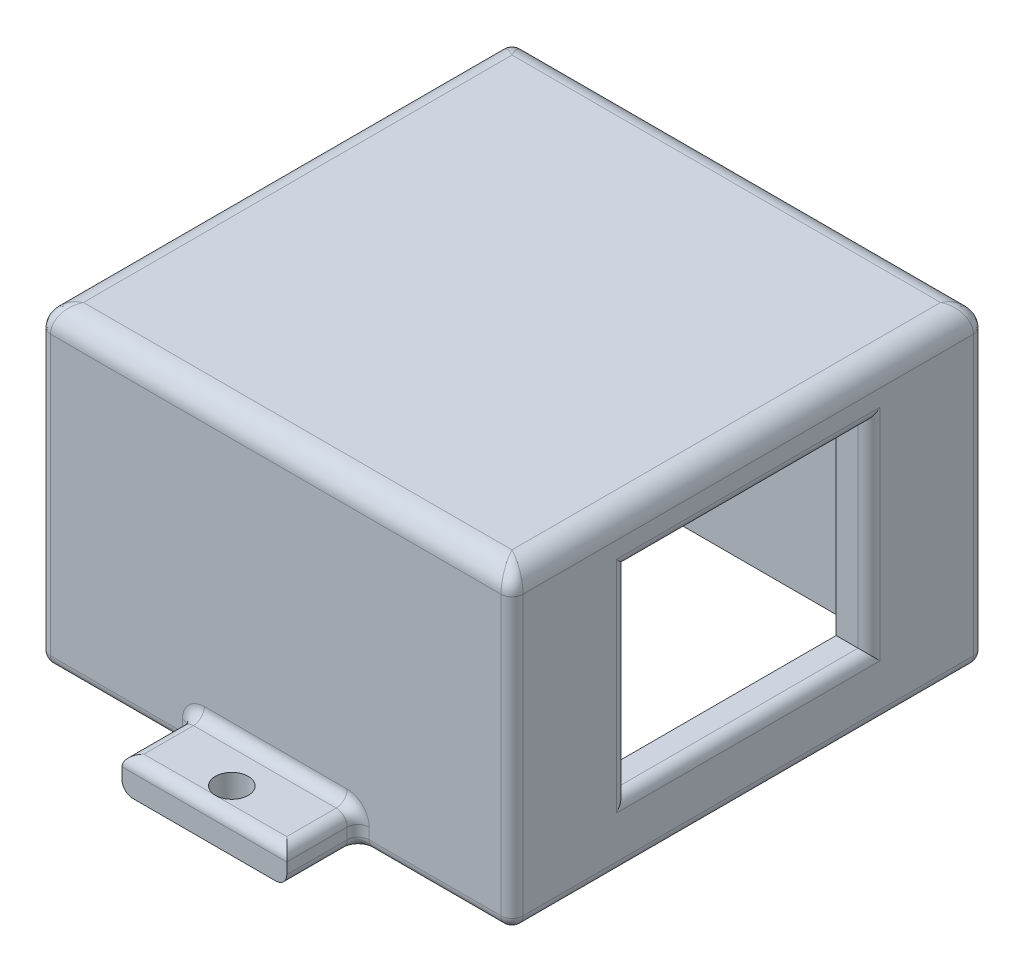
ISO-10303-21;
HEADER;
FILE_DESCRIPTION(('STEP AP214'),'2;1');
FILE_NAME('part.step','',(''),(''),'','','');
FILE_SCHEMA(('AUTOMOTIVE_DESIGN { 1 0 10303 214 1 1 1 1 }'));
ENDSEC;
DATA;
#1=APPLICATION_CONTEXT('core data for automotive mechanical design processes');
#2=APPLICATION_PROTOCOL_DEFINITION('international standard','automotive_design',2000,#1);
#3=PRODUCT_CONTEXT('',#1,'mechanical');
#4=PRODUCT('Part','Part','',(#3));
#5=PRODUCT_RELATED_PRODUCT_CATEGORY('part','',(#4));
#6=PRODUCT_DEFINITION_FORMATION('','',#4);
#7=PRODUCT_DEFINITION_CONTEXT('part definition',#1,'design');
#8=PRODUCT_DEFINITION('design','',#6,#7);
#9=PRODUCT_DEFINITION_SHAPE('','',#8);
#10=(LENGTH_UNIT() NAMED_UNIT(*) SI_UNIT(.MILLI.,.METRE.));
#11=(NAMED_UNIT(*) PLANE_ANGLE_UNIT() SI_UNIT($,.RADIAN.));
#12=(NAMED_UNIT(*) SI_UNIT($,.STERADIAN.) SOLID_ANGLE_UNIT());
#13=UNCERTAINTY_MEASURE_WITH_UNIT(LENGTH_MEASURE(1.E-05),#10,'distance_accuracy_value','');
#14=(GEOMETRIC_REPRESENTATION_CONTEXT(3) GLOBAL_UNCERTAINTY_ASSIGNED_CONTEXT((#13)) GLOBAL_UNIT_ASSIGNED_CONTEXT((#10,
#11,#12)) REPRESENTATION_CONTEXT('',''));
#15=CARTESIAN_POINT('',(0.,0.,0.));
#16=DIRECTION('',(0.,0.,1.));
#17=DIRECTION('',(1.,0.,0.));
#18=AXIS2_PLACEMENT_3D('',#15,#16,#17);
#19=CARTESIAN_POINT('',(-3.,28.35,-3.));
#20=DIRECTION('',(1.,0.,0.));
#21=DIRECTION('',(0.,0.,-1.));
#22=AXIS2_PLACEMENT_3D('',#19,#20,#21);
#23=PLANE('',#22);
#24=DIRECTION('',(0.,0.,1.));
#25=VECTOR('',#24,1.);
#26=CARTESIAN_POINT('',(-3.,26.35,-3.));
#27=LINE('',#26,#25);
#28=CARTESIAN_POINT('',(-3.,26.35,39.));
#29=VERTEX_POINT('',#28);
#30=CARTESIAN_POINT('',(-3.,26.35,-2.));
#31=VERTEX_POINT('',#30);
#32=EDGE_CURVE('E491',#29,#31,#27,.F.);
#33=ORIENTED_EDGE('',*,*,#32,.T.);
#34=DIRECTION('',(0.,-1.,0.));
#35=VECTOR('',#34,1.);
#36=CARTESIAN_POINT('',(-3.,28.35,-2.));
#37=LINE('',#36,#35);
#38=CARTESIAN_POINT('',(-3.,1.,-2.));
#39=VERTEX_POINT('',#38);
#40=EDGE_CURVE('E775',#31,#39,#37,.T.);
#41=ORIENTED_EDGE('',*,*,#40,.T.);
#42=DIRECTION('',(0.,0.,1.));
#43=VECTOR('',#42,1.);
#44=CARTESIAN_POINT('',(-3.,1.,-3.));
#45=LINE('',#44,#43);
#46=CARTESIAN_POINT('',(-3.,1.,9.99999999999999));
#47=VERTEX_POINT('',#46);
#48=EDGE_CURVE('E773',#39,#47,#45,.T.);
#49=ORIENTED_EDGE('',*,*,#48,.T.);
#50=DIRECTION('',(0.,-1.,0.));
#51=VECTOR('',#50,1.);
#52=CARTESIAN_POINT('',(-3.,28.35,9.99999999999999));
#53=LINE('',#52,#51);
#54=CARTESIAN_POINT('',(-3.,4.,9.99999999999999));
#55=VERTEX_POINT('',#54);
#56=EDGE_CURVE('E771',#47,#55,#53,.F.);
#57=ORIENTED_EDGE('',*,*,#56,.T.);
#58=DIRECTION('',(0.,0.,1.));
#59=VECTOR('',#58,1.);
#60=CARTESIAN_POINT('',(-3.,4.,-3.));
#61=LINE('',#60,#59);
#62=CARTESIAN_POINT('',(-3.,4.,25.));
#63=VERTEX_POINT('',#62);
#64=EDGE_CURVE('E769',#55,#63,#61,.T.);
#65=ORIENTED_EDGE('',*,*,#64,.T.);
#66=CARTESIAN_POINT('',(-3.,2.,25.));
#67=DIRECTION('',(1.,0.,0.));
#68=DIRECTION('',(0.,0.,-1.));
#69=AXIS2_PLACEMENT_3D('',#66,#67,#68);
#70=CIRCLE('',#69,2.);
#71=CARTESIAN_POINT('',(-3.,2.,27.));
#72=VERTEX_POINT('',#71);
#73=EDGE_CURVE('E766',#72,#63,#70,.F.);
#74=ORIENTED_EDGE('',*,*,#73,.F.);
#75=DIRECTION('',(0.,-1.,0.));
#76=VECTOR('',#75,1.);
#77=CARTESIAN_POINT('',(-3.,28.35,27.));
#78=LINE('',#77,#76);
#79=CARTESIAN_POINT('',(-3.,1.,27.));
#80=VERTEX_POINT('',#79);
#81=EDGE_CURVE('E764',#72,#80,#78,.T.);
#82=ORIENTED_EDGE('',*,*,#81,.T.);
#83=DIRECTION('',(0.,0.,1.));
#84=VECTOR('',#83,1.);
#85=CARTESIAN_POINT('',(-3.,1.,-3.));
#86=LINE('',#85,#84);
#87=CARTESIAN_POINT('',(-3.,1.,39.));
#88=VERTEX_POINT('',#87);
#89=EDGE_CURVE('E762',#80,#88,#86,.T.);
#90=ORIENTED_EDGE('',*,*,#89,.T.);
#91=DIRECTION('',(0.,-1.,0.));
#92=VECTOR('',#91,1.);
#93=CARTESIAN_POINT('',(-3.,28.35,39.));
#94=LINE('',#93,#92);
#95=EDGE_CURVE('E760',#88,#29,#94,.F.);
#96=ORIENTED_EDGE('',*,*,#95,.T.);
#97=EDGE_LOOP('',(#33,#41,#49,#57,#65,#74,#82,#90,#96));
#98=FACE_BOUND('',#97,.T.);
#99=ADVANCED_FACE('F35',(#98),#23,.F.);
#100=CARTESIAN_POINT('',(-3.,28.35,-3.));
#101=DIRECTION('',(0.,0.,1.));
#102=DIRECTION('',(1.,0.,0.));
#103=AXIS2_PLACEMENT_3D('',#100,#101,#102);
#104=PLANE('',#103);
#105=DIRECTION('',(-1.,0.,0.));
#106=VECTOR('',#105,1.);
#107=CARTESIAN_POINT('',(40.,26.35,-3.));
#108=LINE('',#107,#106);
#109=CARTESIAN_POINT('',(-2.,26.35,-3.));
#110=VERTEX_POINT('',#109);
#111=CARTESIAN_POINT('',(39.,26.35,-3.));
#112=VERTEX_POINT('',#111);
#113=EDGE_CURVE('E500',#110,#112,#108,.F.);
#114=ORIENTED_EDGE('',*,*,#113,.T.);
#115=DIRECTION('',(0.,-1.,0.));
#116=VECTOR('',#115,1.);
#117=CARTESIAN_POINT('',(39.,28.35,-3.));
#118=LINE('',#117,#116);
#119=CARTESIAN_POINT('',(39.,1.,-3.));
#120=VERTEX_POINT('',#119);
#121=EDGE_CURVE('E758',#112,#120,#118,.T.);
#122=ORIENTED_EDGE('',*,*,#121,.T.);
#123=DIRECTION('',(-1.,0.,0.));
#124=VECTOR('',#123,1.);
#125=CARTESIAN_POINT('',(-3.,1.,-3.));
#126=LINE('',#125,#124);
#127=CARTESIAN_POINT('',(27.,1.,-3.));
#128=VERTEX_POINT('',#127);
#129=EDGE_CURVE('E756',#120,#128,#126,.T.);
#130=ORIENTED_EDGE('',*,*,#129,.T.);
#131=DIRECTION('',(0.,-1.,0.));
#132=VECTOR('',#131,1.);
#133=CARTESIAN_POINT('',(27.,28.35,-3.));
#134=LINE('',#133,#132);
#135=CARTESIAN_POINT('',(27.,2.,-3.));
#136=VERTEX_POINT('',#135);
#137=EDGE_CURVE('E541',#128,#136,#134,.F.);
#138=ORIENTED_EDGE('',*,*,#137,.T.);
#139=CARTESIAN_POINT('',(25.,2.,-3.));
#140=DIRECTION('',(0.,0.,1.));
#141=DIRECTION('',(1.,0.,0.));
#142=AXIS2_PLACEMENT_3D('',#139,#140,#141);
#143=CIRCLE('',#142,2.);
#144=CARTESIAN_POINT('',(25.,4.,-3.));
#145=VERTEX_POINT('',#144);
#146=EDGE_CURVE('E538',#145,#136,#143,.F.);
#147=ORIENTED_EDGE('',*,*,#146,.F.);
#148=DIRECTION('',(-1.,0.,0.));
#149=VECTOR('',#148,1.);
#150=CARTESIAN_POINT('',(11.,4.,-3.));
#151=LINE('',#150,#149);
#152=CARTESIAN_POINT('',(12.,4.,-3.));
#153=VERTEX_POINT('',#152);
#154=EDGE_CURVE('E533',#145,#153,#151,.T.);
#155=ORIENTED_EDGE('',*,*,#154,.T.);
#156=CARTESIAN_POINT('',(12.,2.,-3.));
#157=DIRECTION('',(0.,0.,1.));
#158=DIRECTION('',(1.,0.,0.));
#159=AXIS2_PLACEMENT_3D('',#156,#157,#158);
#160=CIRCLE('',#159,2.);
#161=CARTESIAN_POINT('',(9.99999999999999,2.,-3.));
#162=VERTEX_POINT('',#161);
#163=EDGE_CURVE('E530',#162,#153,#160,.F.);
#164=ORIENTED_EDGE('',*,*,#163,.F.);
#165=DIRECTION('',(0.,-1.,0.));
#166=VECTOR('',#165,1.);
#167=CARTESIAN_POINT('',(9.99999999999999,28.35,-3.));
#168=LINE('',#167,#166);
#169=CARTESIAN_POINT('',(9.99999999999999,1.,-3.));
#170=VERTEX_POINT('',#169);
#171=EDGE_CURVE('E535',#162,#170,#168,.T.);
#172=ORIENTED_EDGE('',*,*,#171,.T.);
#173=DIRECTION('',(-1.,0.,0.));
#174=VECTOR('',#173,1.);
#175=CARTESIAN_POINT('',(-3.,1.,-3.));
#176=LINE('',#175,#174);
#177=CARTESIAN_POINT('',(-2.,1.,-3.));
#178=VERTEX_POINT('',#177);
#179=EDGE_CURVE('E754',#170,#178,#176,.T.);
#180=ORIENTED_EDGE('',*,*,#179,.T.);
#181=DIRECTION('',(0.,-1.,0.));
#182=VECTOR('',#181,1.);
#183=CARTESIAN_POINT('',(-2.,28.35,-3.));
#184=LINE('',#183,#182);
#185=EDGE_CURVE('E752',#178,#110,#184,.F.);
#186=ORIENTED_EDGE('',*,*,#185,.T.);
#187=EDGE_LOOP('',(#114,#122,#130,#138,#147,#155,#164,#172,#180,#186));
#188=FACE_BOUND('',#187,.T.);
#189=ADVANCED_FACE('F917',(#188),#104,.F.);
#190=CARTESIAN_POINT('',(-3.,28.35,40.));
#191=DIRECTION('',(0.,0.,-1.));
#192=DIRECTION('',(-1.,0.,0.));
#193=AXIS2_PLACEMENT_3D('',#190,#191,#192);
#194=PLANE('',#193);
#195=DIRECTION('',(0.,-1.,0.));
#196=VECTOR('',#195,1.);
#197=CARTESIAN_POINT('',(27.,28.35,40.));
#198=LINE('',#197,#196);
#199=CARTESIAN_POINT('',(27.,2.,40.));
#200=VERTEX_POINT('',#199);
#201=CARTESIAN_POINT('',(27.,1.,40.));
#202=VERTEX_POINT('',#201);
#203=EDGE_CURVE('E513',#200,#202,#198,.T.);
#204=ORIENTED_EDGE('',*,*,#203,.T.);
#205=DIRECTION('',(1.,0.,0.));
#206=VECTOR('',#205,1.);
#207=CARTESIAN_POINT('',(-3.,1.,40.));
#208=LINE('',#207,#206);
#209=CARTESIAN_POINT('',(39.,1.,40.));
#210=VERTEX_POINT('',#209);
#211=EDGE_CURVE('E727',#202,#210,#208,.T.);
#212=ORIENTED_EDGE('',*,*,#211,.T.);
#213=DIRECTION('',(0.,-1.,0.));
#214=VECTOR('',#213,1.);
#215=CARTESIAN_POINT('',(39.,28.35,40.));
#216=LINE('',#215,#214);
#217=CARTESIAN_POINT('',(39.,26.35,40.));
#218=VERTEX_POINT('',#217);
#219=EDGE_CURVE('E725',#210,#218,#216,.F.);
#220=ORIENTED_EDGE('',*,*,#219,.T.);
#221=DIRECTION('',(1.,0.,0.));
#222=VECTOR('',#221,1.);
#223=CARTESIAN_POINT('',(-3.,26.35,40.));
#224=LINE('',#223,#222);
#225=CARTESIAN_POINT('',(-2.,26.35,40.));
#226=VERTEX_POINT('',#225);
#227=EDGE_CURVE('E494',#218,#226,#224,.F.);
#228=ORIENTED_EDGE('',*,*,#227,.T.);
#229=DIRECTION('',(0.,-1.,0.));
#230=VECTOR('',#229,1.);
#231=CARTESIAN_POINT('',(-2.,28.35,40.));
#232=LINE('',#231,#230);
#233=CARTESIAN_POINT('',(-2.,1.,40.));
#234=VERTEX_POINT('',#233);
#235=EDGE_CURVE('E721',#226,#234,#232,.T.);
#236=ORIENTED_EDGE('',*,*,#235,.T.);
#237=DIRECTION('',(1.,0.,0.));
#238=VECTOR('',#237,1.);
#239=CARTESIAN_POINT('',(-3.,1.,40.));
#240=LINE('',#239,#238);
#241=CARTESIAN_POINT('',(10.,1.,40.));
#242=VERTEX_POINT('',#241);
#243=EDGE_CURVE('E723',#234,#242,#240,.T.);
#244=ORIENTED_EDGE('',*,*,#243,.T.);
#245=DIRECTION('',(0.,-1.,0.));
#246=VECTOR('',#245,1.);
#247=CARTESIAN_POINT('',(10.,28.35,40.));
#248=LINE('',#247,#246);
#249=CARTESIAN_POINT('',(10.,2.,40.));
#250=VERTEX_POINT('',#249);
#251=EDGE_CURVE('E519',#242,#250,#248,.F.);
#252=ORIENTED_EDGE('',*,*,#251,.T.);
#253=CARTESIAN_POINT('',(12.,2.,40.));
#254=DIRECTION('',(0.,0.,-1.));
#255=DIRECTION('',(-1.,0.,0.));
#256=AXIS2_PLACEMENT_3D('',#253,#254,#255);
#257=CIRCLE('',#256,2.);
#258=CARTESIAN_POINT('',(12.,4.,40.));
#259=VERTEX_POINT('',#258);
#260=EDGE_CURVE('E516',#259,#250,#257,.F.);
#261=ORIENTED_EDGE('',*,*,#260,.F.);
#262=DIRECTION('',(1.,0.,0.));
#263=VECTOR('',#262,1.);
#264=CARTESIAN_POINT('',(26.,4.,40.));
#265=LINE('',#264,#263);
#266=CARTESIAN_POINT('',(25.,4.,40.));
#267=VERTEX_POINT('',#266);
#268=EDGE_CURVE('E511',#259,#267,#265,.T.);
#269=ORIENTED_EDGE('',*,*,#268,.T.);
#270=CARTESIAN_POINT('',(25.,2.,40.));
#271=DIRECTION('',(0.,0.,-1.));
#272=DIRECTION('',(-1.,0.,0.));
#273=AXIS2_PLACEMENT_3D('',#270,#271,#272);
#274=CIRCLE('',#273,2.);
#275=EDGE_CURVE('E508',#200,#267,#274,.F.);
#276=ORIENTED_EDGE('',*,*,#275,.F.);
#277=EDGE_LOOP('',(#204,#212,#220,#228,#236,#244,#252,#261,#269,#276));
#278=FACE_BOUND('',#277,.T.);
#279=ADVANCED_FACE('F922',(#278),#194,.F.);
#280=CARTESIAN_POINT('',(0.,28.35,0.));
#281=DIRECTION('',(1.,0.,0.));
#282=DIRECTION('',(0.,0.,-1.));
#283=AXIS2_PLACEMENT_3D('',#280,#281,#282);
#284=PLANE('',#283);
#285=DIRECTION('',(0.,-1.,0.));
#286=VECTOR('',#285,1.);
#287=CARTESIAN_POINT('',(0.,28.35,0.));
#288=LINE('',#287,#286);
#289=CARTESIAN_POINT('',(0.,25.35,0.));
#290=VERTEX_POINT('',#289);
#291=CARTESIAN_POINT('',(0.,0.,0.));
#292=VERTEX_POINT('',#291);
#293=EDGE_CURVE('E456',#290,#292,#288,.T.);
#294=ORIENTED_EDGE('',*,*,#293,.F.);
#295=DIRECTION('',(0.,0.,1.));
#296=VECTOR('',#295,1.);
#297=CARTESIAN_POINT('',(0.,25.35,0.));
#298=LINE('',#297,#296);
#299=CARTESIAN_POINT('',(0.,25.35,37.));
#300=VERTEX_POINT('',#299);
#301=EDGE_CURVE('E441',#290,#300,#298,.T.);
#302=ORIENTED_EDGE('',*,*,#301,.T.);
#303=DIRECTION('',(0.,-1.,0.));
#304=VECTOR('',#303,1.);
#305=CARTESIAN_POINT('',(0.,28.35,37.));
#306=LINE('',#305,#304);
#307=CARTESIAN_POINT('',(0.,0.,37.));
#308=VERTEX_POINT('',#307);
#309=EDGE_CURVE('E462',#300,#308,#306,.T.);
#310=ORIENTED_EDGE('',*,*,#309,.T.);
#311=DIRECTION('',(0.,0.,1.));
#312=VECTOR('',#311,1.);
#313=CARTESIAN_POINT('',(0.,0.,0.));
#314=LINE('',#313,#312);
#315=EDGE_CURVE('E444',#292,#308,#314,.T.);
#316=ORIENTED_EDGE('',*,*,#315,.F.);
#317=EDGE_LOOP('',(#294,#302,#310,#316));
#318=FACE_BOUND('',#317,.T.);
#319=ADVANCED_FACE('F928',(#318),#284,.T.);
#320=CARTESIAN_POINT('',(0.,28.35,37.));
#321=DIRECTION('',(0.,0.,-1.));
#322=DIRECTION('',(-1.,0.,0.));
#323=AXIS2_PLACEMENT_3D('',#320,#321,#322);
#324=PLANE('',#323);
#325=ORIENTED_EDGE('',*,*,#309,.F.);
#326=DIRECTION('',(1.,0.,0.));
#327=VECTOR('',#326,1.);
#328=CARTESIAN_POINT('',(0.,25.35,37.));
#329=LINE('',#328,#327);
#330=CARTESIAN_POINT('',(37.,25.35,37.));
#331=VERTEX_POINT('',#330);
#332=EDGE_CURVE('E434',#300,#331,#329,.T.);
#333=ORIENTED_EDGE('',*,*,#332,.T.);
#334=DIRECTION('',(0.,-1.,0.));
#335=VECTOR('',#334,1.);
#336=CARTESIAN_POINT('',(37.,28.35,37.));
#337=LINE('',#336,#335);
#338=CARTESIAN_POINT('',(37.,0.,37.));
#339=VERTEX_POINT('',#338);
#340=EDGE_CURVE('E460',#331,#339,#337,.T.);
#341=ORIENTED_EDGE('',*,*,#340,.T.);
#342=DIRECTION('',(1.,0.,0.));
#343=VECTOR('',#342,1.);
#344=CARTESIAN_POINT('',(0.,0.,37.));
#345=LINE('',#344,#343);
#346=EDGE_CURVE('E447',#308,#339,#345,.T.);
#347=ORIENTED_EDGE('',*,*,#346,.F.);
#348=EDGE_LOOP('',(#325,#333,#341,#347));
#349=FACE_BOUND('',#348,.T.);
#350=ADVANCED_FACE('F946',(#349),#324,.T.);
#351=CARTESIAN_POINT('',(37.,28.35,0.));
#352=DIRECTION('',(-1.,0.,0.));
#353=DIRECTION('',(0.,0.,1.));
#354=AXIS2_PLACEMENT_3D('',#351,#352,#353);
#355=PLANE('',#354);
#356=DIRECTION('',(0.,1.,0.));
#357=VECTOR('',#356,1.);
#358=CARTESIAN_POINT('',(37.,28.35,29.5));
#359=LINE('',#358,#357);
#360=CARTESIAN_POINT('',(37.,5.85,29.5));
#361=VERTEX_POINT('',#360);
#362=CARTESIAN_POINT('',(37.,23.85,29.5));
#363=VERTEX_POINT('',#362);
#364=EDGE_CURVE('E421',#361,#363,#359,.T.);
#365=ORIENTED_EDGE('',*,*,#364,.F.);
#366=DIRECTION('',(0.,0.,1.));
#367=VECTOR('',#366,1.);
#368=CARTESIAN_POINT('',(37.,5.85,0.));
#369=LINE('',#368,#367);
#370=CARTESIAN_POINT('',(37.,5.85,7.49999999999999));
#371=VERTEX_POINT('',#370);
#372=EDGE_CURVE('E404',#371,#361,#369,.T.);
#373=ORIENTED_EDGE('',*,*,#372,.F.);
#374=DIRECTION('',(0.,-1.,0.));
#375=VECTOR('',#374,1.);
#376=CARTESIAN_POINT('',(37.,28.35,7.5));
#377=LINE('',#376,#375);
#378=CARTESIAN_POINT('',(37.,23.85,7.5));
#379=VERTEX_POINT('',#378);
#380=EDGE_CURVE('E415',#379,#371,#377,.T.);
#381=ORIENTED_EDGE('',*,*,#380,.F.);
#382=DIRECTION('',(0.,0.,-1.));
#383=VECTOR('',#382,1.);
#384=CARTESIAN_POINT('',(37.,23.85,0.));
#385=LINE('',#384,#383);
#386=EDGE_CURVE('E430',#363,#379,#385,.T.);
#387=ORIENTED_EDGE('',*,*,#386,.F.);
#388=EDGE_LOOP('',(#365,#373,#381,#387));
#389=FACE_BOUND('',#388,.T.);
#390=ORIENTED_EDGE('',*,*,#340,.F.);
#391=DIRECTION('',(0.,0.,-1.));
#392=VECTOR('',#391,1.);
#393=CARTESIAN_POINT('',(37.,25.35,0.));
#394=LINE('',#393,#392);
#395=CARTESIAN_POINT('',(37.,25.35,0.));
#396=VERTEX_POINT('',#395);
#397=EDGE_CURVE('E431',#331,#396,#394,.T.);
#398=ORIENTED_EDGE('',*,*,#397,.T.);
#399=DIRECTION('',(0.,-1.,0.));
#400=VECTOR('',#399,1.);
#401=CARTESIAN_POINT('',(37.,28.35,0.));
#402=LINE('',#401,#400);
#403=CARTESIAN_POINT('',(37.,0.,0.));
#404=VERTEX_POINT('',#403);
#405=EDGE_CURVE('E458',#396,#404,#402,.T.);
#406=ORIENTED_EDGE('',*,*,#405,.T.);
#407=DIRECTION('',(0.,0.,-1.));
#408=VECTOR('',#407,1.);
#409=CARTESIAN_POINT('',(37.,0.,0.));
#410=LINE('',#409,#408);
#411=EDGE_CURVE('E450',#339,#404,#410,.T.);
#412=ORIENTED_EDGE('',*,*,#411,.F.);
#413=EDGE_LOOP('',(#390,#398,#406,#412));
#414=FACE_BOUND('',#413,.T.);
#415=ADVANCED_FACE('F428',(#389,#414),#355,.T.);
#416=CARTESIAN_POINT('',(0.,28.35,0.));
#417=DIRECTION('',(0.,0.,1.));
#418=DIRECTION('',(1.,0.,0.));
#419=AXIS2_PLACEMENT_3D('',#416,#417,#418);
#420=PLANE('',#419);
#421=ORIENTED_EDGE('',*,*,#405,.F.);
#422=DIRECTION('',(-1.,0.,0.));
#423=VECTOR('',#422,1.);
#424=CARTESIAN_POINT('',(0.,25.35,0.));
#425=LINE('',#424,#423);
#426=EDGE_CURVE('E464',#396,#290,#425,.T.);
#427=ORIENTED_EDGE('',*,*,#426,.T.);
#428=ORIENTED_EDGE('',*,*,#293,.T.);
#429=DIRECTION('',(-1.,0.,0.));
#430=VECTOR('',#429,1.);
#431=CARTESIAN_POINT('',(0.,0.,0.));
#432=LINE('',#431,#430);
#433=EDGE_CURVE('E453',#404,#292,#432,.T.);
#434=ORIENTED_EDGE('',*,*,#433,.F.);
#435=EDGE_LOOP('',(#421,#427,#428,#434));
#436=FACE_BOUND('',#435,.T.);
#437=ADVANCED_FACE('F942',(#436),#420,.T.);
#438=CARTESIAN_POINT('',(0.,28.35,0.));
#439=DIRECTION('',(0.,1.,0.));
#440=DIRECTION('',(0.,0.,1.));
#441=AXIS2_PLACEMENT_3D('',#438,#439,#440);
#442=PLANE('',#441);
#443=DIRECTION('',(-1.,0.,0.));
#444=VECTOR('',#443,1.);
#445=CARTESIAN_POINT('',(-3.,28.35,-1.));
#446=LINE('',#445,#444);
#447=CARTESIAN_POINT('',(38.,28.35,-1.));
#448=VERTEX_POINT('',#447);
#449=CARTESIAN_POINT('',(-1.,28.35,-1.));
#450=VERTEX_POINT('',#449);
#451=EDGE_CURVE('E467',#448,#450,#446,.T.);
#452=ORIENTED_EDGE('',*,*,#451,.T.);
#453=DIRECTION('',(0.,0.,1.));
#454=VECTOR('',#453,1.);
#455=CARTESIAN_POINT('',(-1.,28.35,40.));
#456=LINE('',#455,#454);
#457=CARTESIAN_POINT('',(-1.,28.35,38.));
#458=VERTEX_POINT('',#457);
#459=EDGE_CURVE('E488',#450,#458,#456,.T.);
#460=ORIENTED_EDGE('',*,*,#459,.T.);
#461=DIRECTION('',(1.,0.,0.));
#462=VECTOR('',#461,1.);
#463=CARTESIAN_POINT('',(40.,28.35,38.));
#464=LINE('',#463,#462);
#465=CARTESIAN_POINT('',(38.,28.35,38.));
#466=VERTEX_POINT('',#465);
#467=EDGE_CURVE('E485',#458,#466,#464,.T.);
#468=ORIENTED_EDGE('',*,*,#467,.T.);
#469=DIRECTION('',(0.,0.,-1.));
#470=VECTOR('',#469,1.);
#471=CARTESIAN_POINT('',(38.,28.35,-3.));
#472=LINE('',#471,#470);
#473=EDGE_CURVE('E482',#466,#448,#472,.T.);
#474=ORIENTED_EDGE('',*,*,#473,.T.);
#475=EDGE_LOOP('',(#452,#460,#468,#474));
#476=FACE_BOUND('',#475,.T.);
#477=ADVANCED_FACE('F938',(#476),#442,.T.);
#478=CARTESIAN_POINT('',(0.,0.,0.));
#479=DIRECTION('',(0.,1.,0.));
#480=DIRECTION('',(0.,0.,1.));
#481=AXIS2_PLACEMENT_3D('',#478,#479,#480);
#482=PLANE('',#481);
#483=CARTESIAN_POINT('',(27.,0.,41.));
#484=DIRECTION('',(0.,1.,0.));
#485=DIRECTION('',(0.,0.,1.));
#486=AXIS2_PLACEMENT_3D('',#483,#484,#485);
#487=CIRCLE('',#486,2.);
#488=CARTESIAN_POINT('',(27.,0.,39.));
#489=VERTEX_POINT('',#488);
#490=CARTESIAN_POINT('',(25.,0.,41.));
#491=VERTEX_POINT('',#490);
#492=EDGE_CURVE('E658',#489,#491,#487,.T.);
#493=ORIENTED_EDGE('',*,*,#492,.T.);
#494=DIRECTION('',(0.,0.,1.));
#495=VECTOR('',#494,1.);
#496=CARTESIAN_POINT('',(25.,0.,46.5));
#497=LINE('',#496,#495);
#498=CARTESIAN_POINT('',(25.,0.,46.5));
#499=VERTEX_POINT('',#498);
#500=EDGE_CURVE('E660',#491,#499,#497,.T.);
#501=ORIENTED_EDGE('',*,*,#500,.T.);
#502=DIRECTION('',(-1.,0.,0.));
#503=VECTOR('',#502,1.);
#504=CARTESIAN_POINT('',(26.,0.,46.5));
#505=LINE('',#504,#503);
#506=CARTESIAN_POINT('',(12.,0.,46.5));
#507=VERTEX_POINT('',#506);
#508=EDGE_CURVE('E1073',#499,#507,#505,.T.);
#509=ORIENTED_EDGE('',*,*,#508,.T.);
#510=DIRECTION('',(0.,0.,-1.));
#511=VECTOR('',#510,1.);
#512=CARTESIAN_POINT('',(12.,0.,41.));
#513=LINE('',#512,#511);
#514=CARTESIAN_POINT('',(12.,0.,41.));
#515=VERTEX_POINT('',#514);
#516=EDGE_CURVE('E643',#507,#515,#513,.T.);
#517=ORIENTED_EDGE('',*,*,#516,.T.);
#518=CARTESIAN_POINT('',(10.,0.,41.));
#519=DIRECTION('',(0.,1.,0.));
#520=DIRECTION('',(0.,0.,1.));
#521=AXIS2_PLACEMENT_3D('',#518,#519,#520);
#522=CIRCLE('',#521,2.);
#523=CARTESIAN_POINT('',(10.,0.,39.));
#524=VERTEX_POINT('',#523);
#525=EDGE_CURVE('E641',#515,#524,#522,.T.);
#526=ORIENTED_EDGE('',*,*,#525,.T.);
#527=DIRECTION('',(1.,0.,0.));
#528=VECTOR('',#527,1.);
#529=CARTESIAN_POINT('',(0.,0.,39.));
#530=LINE('',#529,#528);
#531=CARTESIAN_POINT('',(-2.,0.,39.));
#532=VERTEX_POINT('',#531);
#533=EDGE_CURVE('E639',#524,#532,#530,.F.);
#534=ORIENTED_EDGE('',*,*,#533,.T.);
#535=DIRECTION('',(0.,0.,1.));
#536=VECTOR('',#535,1.);
#537=CARTESIAN_POINT('',(-2.,0.,0.));
#538=LINE('',#537,#536);
#539=CARTESIAN_POINT('',(-2.,0.,27.));
#540=VERTEX_POINT('',#539);
#541=EDGE_CURVE('E637',#532,#540,#538,.F.);
#542=ORIENTED_EDGE('',*,*,#541,.T.);
#543=CARTESIAN_POINT('',(-4.,0.,27.));
#544=DIRECTION('',(0.,1.,0.));
#545=DIRECTION('',(0.,0.,1.));
#546=AXIS2_PLACEMENT_3D('',#543,#544,#545);
#547=CIRCLE('',#546,2.);
#548=CARTESIAN_POINT('',(-4.,0.,25.));
#549=VERTEX_POINT('',#548);
#550=EDGE_CURVE('E634',#549,#540,#547,.F.);
#551=ORIENTED_EDGE('',*,*,#550,.F.);
#552=DIRECTION('',(-1.,0.,0.));
#553=VECTOR('',#552,1.);
#554=CARTESIAN_POINT('',(-9.5,0.,25.));
#555=LINE('',#554,#553);
#556=CARTESIAN_POINT('',(-9.5,0.,25.));
#557=VERTEX_POINT('',#556);
#558=EDGE_CURVE('E645',#549,#557,#555,.T.);
#559=ORIENTED_EDGE('',*,*,#558,.T.);
#560=DIRECTION('',(0.,0.,-1.));
#561=VECTOR('',#560,1.);
#562=CARTESIAN_POINT('',(-9.5,0.,26.));
#563=LINE('',#562,#561);
#564=CARTESIAN_POINT('',(-9.5,0.,12.));
#565=VERTEX_POINT('',#564);
#566=EDGE_CURVE('E471',#557,#565,#563,.T.);
#567=ORIENTED_EDGE('',*,*,#566,.T.);
#568=DIRECTION('',(1.,0.,0.));
#569=VECTOR('',#568,1.);
#570=CARTESIAN_POINT('',(-3.,0.,12.));
#571=LINE('',#570,#569);
#572=CARTESIAN_POINT('',(-4.,0.,12.));
#573=VERTEX_POINT('',#572);
#574=EDGE_CURVE('E632',#565,#573,#571,.T.);
#575=ORIENTED_EDGE('',*,*,#574,.T.);
#576=CARTESIAN_POINT('',(-4.,0.,9.99999999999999));
#577=DIRECTION('',(0.,1.,0.));
#578=DIRECTION('',(0.,0.,1.));
#579=AXIS2_PLACEMENT_3D('',#576,#577,#578);
#580=CIRCLE('',#579,2.);
#581=CARTESIAN_POINT('',(-2.,0.,9.99999999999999));
#582=VERTEX_POINT('',#581);
#583=EDGE_CURVE('E629',#582,#573,#580,.F.);
#584=ORIENTED_EDGE('',*,*,#583,.F.);
#585=DIRECTION('',(0.,0.,1.));
#586=VECTOR('',#585,1.);
#587=CARTESIAN_POINT('',(-2.,0.,0.));
#588=LINE('',#587,#586);
#589=CARTESIAN_POINT('',(-2.,0.,-2.));
#590=VERTEX_POINT('',#589);
#591=EDGE_CURVE('E573',#582,#590,#588,.F.);
#592=ORIENTED_EDGE('',*,*,#591,.T.);
#593=DIRECTION('',(-1.,0.,0.));
#594=VECTOR('',#593,1.);
#595=CARTESIAN_POINT('',(0.,0.,-2.));
#596=LINE('',#595,#594);
#597=CARTESIAN_POINT('',(9.99999999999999,0.,-2.));
#598=VERTEX_POINT('',#597);
#599=EDGE_CURVE('E623',#590,#598,#596,.F.);
#600=ORIENTED_EDGE('',*,*,#599,.T.);
#601=CARTESIAN_POINT('',(9.99999999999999,0.,-4.));
#602=DIRECTION('',(0.,1.,0.));
#603=DIRECTION('',(0.,0.,1.));
#604=AXIS2_PLACEMENT_3D('',#601,#602,#603);
#605=CIRCLE('',#604,2.);
#606=CARTESIAN_POINT('',(12.,0.,-4.));
#607=VERTEX_POINT('',#606);
#608=EDGE_CURVE('E625',#598,#607,#605,.T.);
#609=ORIENTED_EDGE('',*,*,#608,.T.);
#610=DIRECTION('',(0.,0.,-1.));
#611=VECTOR('',#610,1.);
#612=CARTESIAN_POINT('',(12.,0.,-9.49999999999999));
#613=LINE('',#612,#611);
#614=CARTESIAN_POINT('',(12.,0.,-9.49999999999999));
#615=VERTEX_POINT('',#614);
#616=EDGE_CURVE('E627',#607,#615,#613,.T.);
#617=ORIENTED_EDGE('',*,*,#616,.T.);
#618=DIRECTION('',(1.,0.,0.));
#619=VECTOR('',#618,1.);
#620=CARTESIAN_POINT('',(26.,0.,-9.5));
#621=LINE('',#620,#619);
#622=CARTESIAN_POINT('',(25.,0.,-9.5));
#623=VERTEX_POINT('',#622);
#624=EDGE_CURVE('E1078',#615,#623,#621,.T.);
#625=ORIENTED_EDGE('',*,*,#624,.T.);
#626=DIRECTION('',(0.,0.,1.));
#627=VECTOR('',#626,1.);
#628=CARTESIAN_POINT('',(25.,0.,-4.));
#629=LINE('',#628,#627);
#630=CARTESIAN_POINT('',(25.,0.,-4.));
#631=VERTEX_POINT('',#630);
#632=EDGE_CURVE('E656',#623,#631,#629,.T.);
#633=ORIENTED_EDGE('',*,*,#632,.T.);
#634=CARTESIAN_POINT('',(27.,0.,-4.));
#635=DIRECTION('',(0.,1.,0.));
#636=DIRECTION('',(0.,0.,1.));
#637=AXIS2_PLACEMENT_3D('',#634,#635,#636);
#638=CIRCLE('',#637,2.);
#639=CARTESIAN_POINT('',(27.,0.,-2.));
#640=VERTEX_POINT('',#639);
#641=EDGE_CURVE('E654',#631,#640,#638,.T.);
#642=ORIENTED_EDGE('',*,*,#641,.T.);
#643=DIRECTION('',(-1.,0.,0.));
#644=VECTOR('',#643,1.);
#645=CARTESIAN_POINT('',(0.,0.,-2.));
#646=LINE('',#645,#644);
#647=CARTESIAN_POINT('',(39.,0.,-2.));
#648=VERTEX_POINT('',#647);
#649=EDGE_CURVE('E648',#640,#648,#646,.F.);
#650=ORIENTED_EDGE('',*,*,#649,.T.);
#651=DIRECTION('',(0.,0.,-1.));
#652=VECTOR('',#651,1.);
#653=CARTESIAN_POINT('',(39.,0.,0.));
#654=LINE('',#653,#652);
#655=CARTESIAN_POINT('',(39.,0.,39.));
#656=VERTEX_POINT('',#655);
#657=EDGE_CURVE('E650',#648,#656,#654,.F.);
#658=ORIENTED_EDGE('',*,*,#657,.T.);
#659=DIRECTION('',(1.,0.,0.));
#660=VECTOR('',#659,1.);
#661=CARTESIAN_POINT('',(0.,0.,39.));
#662=LINE('',#661,#660);
#663=EDGE_CURVE('E652',#656,#489,#662,.F.);
#664=ORIENTED_EDGE('',*,*,#663,.T.);
#665=EDGE_LOOP('',(#493,#501,#509,#517,#526,#534,#542,#551,#559,#567,#575,#584,#592,#600,#609,
#617,#625,#633,#642,#650,#658,#664));
#666=FACE_BOUND('',#665,.T.);
#667=CARTESIAN_POINT('',(18.5,0.,-7.00000000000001));
#668=DIRECTION('',(0.,-1.,0.));
#669=DIRECTION('',(0.,0.,1.));
#670=AXIS2_PLACEMENT_3D('',#667,#668,#669);
#671=CIRCLE('',#670,1.5);
#672=CARTESIAN_POINT('',(18.5,0.,-5.50000000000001));
#673=VERTEX_POINT('',#672);
#674=EDGE_CURVE('E477',#673,#673,#671,.T.);
#675=ORIENTED_EDGE('',*,*,#674,.F.);
#676=EDGE_LOOP('',(#675));
#677=FACE_BOUND('',#676,.T.);
#678=CARTESIAN_POINT('',(-7.,0.,18.5));
#679=DIRECTION('',(0.,-1.,0.));
#680=DIRECTION('',(0.,0.,-1.));
#681=AXIS2_PLACEMENT_3D('',#678,#679,#680);
#682=CIRCLE('',#681,1.5);
#683=CARTESIAN_POINT('',(-7.,0.,17.));
#684=VERTEX_POINT('',#683);
#685=EDGE_CURVE('E598',#684,#684,#682,.T.);
#686=ORIENTED_EDGE('',*,*,#685,.F.);
#687=EDGE_LOOP('',(#686));
#688=FACE_BOUND('',#687,.T.);
#689=CARTESIAN_POINT('',(18.5,0.,44.));
#690=DIRECTION('',(0.,-1.,0.));
#691=DIRECTION('',(0.,0.,-1.));
#692=AXIS2_PLACEMENT_3D('',#689,#690,#691);
#693=CIRCLE('',#692,1.5);
#694=CARTESIAN_POINT('',(18.5,0.,42.5));
#695=VERTEX_POINT('',#694);
#696=EDGE_CURVE('E472',#695,#695,#693,.T.);
#697=ORIENTED_EDGE('',*,*,#696,.F.);
#698=EDGE_LOOP('',(#697));
#699=FACE_BOUND('',#698,.T.);
#700=ORIENTED_EDGE('',*,*,#315,.T.);
#701=ORIENTED_EDGE('',*,*,#346,.T.);
#702=ORIENTED_EDGE('',*,*,#411,.T.);
#703=ORIENTED_EDGE('',*,*,#433,.T.);
#704=EDGE_LOOP('',(#700,#701,#702,#703));
#705=FACE_BOUND('',#704,.T.);
#706=ADVANCED_FACE('F933',(#666,#677,#688,#699,#705),#482,.F.);
#707=CARTESIAN_POINT('',(40.,28.35,-3.));
#708=DIRECTION('',(-1.,0.,0.));
#709=DIRECTION('',(0.,0.,1.));
#710=AXIS2_PLACEMENT_3D('',#707,#708,#709);
#711=PLANE('',#710);
#712=DIRECTION('',(0.,0.,1.));
#713=VECTOR('',#712,1.);
#714=CARTESIAN_POINT('',(40.,24.85,-3.));
#715=LINE('',#714,#713);
#716=CARTESIAN_POINT('',(40.,24.85,30.5));
#717=VERTEX_POINT('',#716);
#718=CARTESIAN_POINT('',(40.,24.85,6.5));
#719=VERTEX_POINT('',#718);
#720=EDGE_CURVE('E739',#717,#719,#715,.F.);
#721=ORIENTED_EDGE('',*,*,#720,.T.);
#722=DIRECTION('',(0.,1.,0.));
#723=VECTOR('',#722,1.);
#724=CARTESIAN_POINT('',(40.,28.35,6.5));
#725=LINE('',#724,#723);
#726=CARTESIAN_POINT('',(40.,4.85,6.49999999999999));
#727=VERTEX_POINT('',#726);
#728=EDGE_CURVE('E741',#719,#727,#725,.F.);
#729=ORIENTED_EDGE('',*,*,#728,.T.);
#730=DIRECTION('',(0.,0.,-1.));
#731=VECTOR('',#730,1.);
#732=CARTESIAN_POINT('',(40.,4.85,-3.));
#733=LINE('',#732,#731);
#734=CARTESIAN_POINT('',(40.,4.85,30.5));
#735=VERTEX_POINT('',#734);
#736=EDGE_CURVE('E735',#727,#735,#733,.F.);
#737=ORIENTED_EDGE('',*,*,#736,.T.);
#738=DIRECTION('',(0.,-1.,0.));
#739=VECTOR('',#738,1.);
#740=CARTESIAN_POINT('',(40.,28.35,30.5));
#741=LINE('',#740,#739);
#742=EDGE_CURVE('E737',#735,#717,#741,.F.);
#743=ORIENTED_EDGE('',*,*,#742,.T.);
#744=EDGE_LOOP('',(#721,#729,#737,#743));
#745=FACE_BOUND('',#744,.T.);
#746=DIRECTION('',(0.,0.,-1.));
#747=VECTOR('',#746,1.);
#748=CARTESIAN_POINT('',(40.,26.35,40.));
#749=LINE('',#748,#747);
#750=CARTESIAN_POINT('',(40.,26.35,-2.));
#751=VERTEX_POINT('',#750);
#752=CARTESIAN_POINT('',(40.,26.35,39.));
#753=VERTEX_POINT('',#752);
#754=EDGE_CURVE('E497',#751,#753,#749,.F.);
#755=ORIENTED_EDGE('',*,*,#754,.T.);
#756=DIRECTION('',(0.,-1.,0.));
#757=VECTOR('',#756,1.);
#758=CARTESIAN_POINT('',(40.,28.35,39.));
#759=LINE('',#758,#757);
#760=CARTESIAN_POINT('',(40.,1.,39.));
#761=VERTEX_POINT('',#760);
#762=EDGE_CURVE('E733',#753,#761,#759,.T.);
#763=ORIENTED_EDGE('',*,*,#762,.T.);
#764=DIRECTION('',(0.,0.,-1.));
#765=VECTOR('',#764,1.);
#766=CARTESIAN_POINT('',(40.,1.,-3.));
#767=LINE('',#766,#765);
#768=CARTESIAN_POINT('',(40.,1.,-2.));
#769=VERTEX_POINT('',#768);
#770=EDGE_CURVE('E731',#761,#769,#767,.T.);
#771=ORIENTED_EDGE('',*,*,#770,.T.);
#772=DIRECTION('',(0.,-1.,0.));
#773=VECTOR('',#772,1.);
#774=CARTESIAN_POINT('',(40.,28.35,-2.));
#775=LINE('',#774,#773);
#776=EDGE_CURVE('E729',#769,#751,#775,.F.);
#777=ORIENTED_EDGE('',*,*,#776,.T.);
#778=EDGE_LOOP('',(#755,#763,#771,#777));
#779=FACE_BOUND('',#778,.T.);
#780=ADVANCED_FACE('F930',(#745,#779),#711,.F.);
#781=CARTESIAN_POINT('',(0.,25.35,0.));
#782=DIRECTION('',(0.,1.,0.));
#783=DIRECTION('',(0.,0.,1.));
#784=AXIS2_PLACEMENT_3D('',#781,#782,#783);
#785=PLANE('',#784);
#786=ORIENTED_EDGE('',*,*,#301,.F.);
#787=ORIENTED_EDGE('',*,*,#426,.F.);
#788=ORIENTED_EDGE('',*,*,#397,.F.);
#789=ORIENTED_EDGE('',*,*,#332,.F.);
#790=EDGE_LOOP('',(#786,#787,#788,#789));
#791=FACE_BOUND('',#790,.T.);
#792=ADVANCED_FACE('F932',(#791),#785,.F.);
#793=CARTESIAN_POINT('',(36.,23.85,29.5));
#794=DIRECTION('',(0.,0.,1.));
#795=DIRECTION('',(0.,-1.,0.));
#796=AXIS2_PLACEMENT_3D('',#793,#794,#795);
#797=PLANE('',#796);
#798=DIRECTION('',(1.,0.,0.));
#799=VECTOR('',#798,1.);
#800=CARTESIAN_POINT('',(36.,23.85,29.5));
#801=LINE('',#800,#799);
#802=CARTESIAN_POINT('',(39.,23.85,29.5));
#803=VERTEX_POINT('',#802);
#804=EDGE_CURVE('E416',#363,#803,#801,.T.);
#805=ORIENTED_EDGE('',*,*,#804,.T.);
#806=DIRECTION('',(0.,-1.,0.));
#807=VECTOR('',#806,1.);
#808=CARTESIAN_POINT('',(39.,23.85,29.5));
#809=LINE('',#808,#807);
#810=CARTESIAN_POINT('',(39.,5.85,29.5));
#811=VERTEX_POINT('',#810);
#812=EDGE_CURVE('E424',#803,#811,#809,.T.);
#813=ORIENTED_EDGE('',*,*,#812,.T.);
#814=DIRECTION('',(1.,0.,0.));
#815=VECTOR('',#814,1.);
#816=CARTESIAN_POINT('',(36.,5.85,29.5));
#817=LINE('',#816,#815);
#818=EDGE_CURVE('E407',#361,#811,#817,.T.);
#819=ORIENTED_EDGE('',*,*,#818,.F.);
#820=ORIENTED_EDGE('',*,*,#364,.T.);
#821=EDGE_LOOP('',(#805,#813,#819,#820));
#822=FACE_BOUND('',#821,.T.);
#823=ADVANCED_FACE('F420',(#822),#797,.F.);
#824=CARTESIAN_POINT('',(36.,23.85,29.5));
#825=DIRECTION('',(0.,1.,0.));
#826=DIRECTION('',(0.,0.,1.));
#827=AXIS2_PLACEMENT_3D('',#824,#825,#826);
#828=PLANE('',#827);
#829=DIRECTION('',(1.,0.,0.));
#830=VECTOR('',#829,1.);
#831=CARTESIAN_POINT('',(36.,23.85,7.5));
#832=LINE('',#831,#830);
#833=CARTESIAN_POINT('',(39.,23.85,7.5));
#834=VERTEX_POINT('',#833);
#835=EDGE_CURVE('E1088',#379,#834,#832,.T.);
#836=ORIENTED_EDGE('',*,*,#835,.T.);
#837=DIRECTION('',(0.,0.,1.));
#838=VECTOR('',#837,1.);
#839=CARTESIAN_POINT('',(39.,23.85,29.5));
#840=LINE('',#839,#838);
#841=EDGE_CURVE('E747',#834,#803,#840,.T.);
#842=ORIENTED_EDGE('',*,*,#841,.T.);
#843=ORIENTED_EDGE('',*,*,#804,.F.);
#844=ORIENTED_EDGE('',*,*,#386,.T.);
#845=EDGE_LOOP('',(#836,#842,#843,#844));
#846=FACE_BOUND('',#845,.T.);
#847=ADVANCED_FACE('F961',(#846),#828,.F.);
#848=CARTESIAN_POINT('',(36.,23.85,7.5));
#849=DIRECTION('',(0.,0.,-1.));
#850=DIRECTION('',(0.,1.,0.));
#851=AXIS2_PLACEMENT_3D('',#848,#849,#850);
#852=PLANE('',#851);
#853=DIRECTION('',(1.,0.,0.));
#854=VECTOR('',#853,1.);
#855=CARTESIAN_POINT('',(36.,5.85,7.49999999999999));
#856=LINE('',#855,#854);
#857=CARTESIAN_POINT('',(39.,5.85,7.49999999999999));
#858=VERTEX_POINT('',#857);
#859=EDGE_CURVE('E410',#371,#858,#856,.T.);
#860=ORIENTED_EDGE('',*,*,#859,.T.);
#861=DIRECTION('',(0.,1.,0.));
#862=VECTOR('',#861,1.);
#863=CARTESIAN_POINT('',(39.,23.85,7.5));
#864=LINE('',#863,#862);
#865=EDGE_CURVE('E744',#858,#834,#864,.T.);
#866=ORIENTED_EDGE('',*,*,#865,.T.);
#867=ORIENTED_EDGE('',*,*,#835,.F.);
#868=ORIENTED_EDGE('',*,*,#380,.T.);
#869=EDGE_LOOP('',(#860,#866,#867,#868));
#870=FACE_BOUND('',#869,.T.);
#871=ADVANCED_FACE('F965',(#870),#852,.F.);
#872=CARTESIAN_POINT('',(36.,5.85,29.5));
#873=DIRECTION('',(0.,-1.,0.));
#874=DIRECTION('',(0.,0.,-1.));
#875=AXIS2_PLACEMENT_3D('',#872,#873,#874);
#876=PLANE('',#875);
#877=ORIENTED_EDGE('',*,*,#818,.T.);
#878=DIRECTION('',(0.,0.,-1.));
#879=VECTOR('',#878,1.);
#880=CARTESIAN_POINT('',(39.,5.85,29.5));
#881=LINE('',#880,#879);
#882=EDGE_CURVE('E750',#811,#858,#881,.T.);
#883=ORIENTED_EDGE('',*,*,#882,.T.);
#884=ORIENTED_EDGE('',*,*,#859,.F.);
#885=ORIENTED_EDGE('',*,*,#372,.T.);
#886=EDGE_LOOP('',(#877,#883,#884,#885));
#887=FACE_BOUND('',#886,.T.);
#888=ADVANCED_FACE('F406',(#887),#876,.F.);
#889=CARTESIAN_POINT('',(26.,3.,40.));
#890=DIRECTION('',(1.,0.,0.));
#891=DIRECTION('',(0.,0.,-1.));
#892=AXIS2_PLACEMENT_3D('',#889,#890,#891);
#893=PLANE('',#892);
#894=DIRECTION('',(0.,-1.,0.));
#895=VECTOR('',#894,1.);
#896=CARTESIAN_POINT('',(26.,3.,46.5));
#897=LINE('',#896,#895);
#898=CARTESIAN_POINT('',(26.,2.,46.5));
#899=VERTEX_POINT('',#898);
#900=CARTESIAN_POINT('',(26.,1.,46.5));
#901=VERTEX_POINT('',#900);
#902=EDGE_CURVE('E1076',#899,#901,#897,.T.);
#903=ORIENTED_EDGE('',*,*,#902,.T.);
#904=DIRECTION('',(0.,0.,1.));
#905=VECTOR('',#904,1.);
#906=CARTESIAN_POINT('',(26.,1.,41.));
#907=LINE('',#906,#905);
#908=CARTESIAN_POINT('',(26.,1.,41.));
#909=VERTEX_POINT('',#908);
#910=EDGE_CURVE('E685',#901,#909,#907,.F.);
#911=ORIENTED_EDGE('',*,*,#910,.T.);
#912=DIRECTION('',(0.,-1.,0.));
#913=VECTOR('',#912,1.);
#914=CARTESIAN_POINT('',(26.,3.,41.));
#915=LINE('',#914,#913);
#916=CARTESIAN_POINT('',(26.,2.,41.));
#917=VERTEX_POINT('',#916);
#918=EDGE_CURVE('E523',#909,#917,#915,.F.);
#919=ORIENTED_EDGE('',*,*,#918,.T.);
#920=DIRECTION('',(0.,0.,1.));
#921=VECTOR('',#920,1.);
#922=CARTESIAN_POINT('',(26.,2.,46.5));
#923=LINE('',#922,#921);
#924=EDGE_CURVE('E521',#917,#899,#923,.T.);
#925=ORIENTED_EDGE('',*,*,#924,.T.);
#926=EDGE_LOOP('',(#903,#911,#919,#925));
#927=FACE_BOUND('',#926,.T.);
#928=ADVANCED_FACE('F964',(#927),#893,.T.);
#929=CARTESIAN_POINT('',(11.,3.,40.));
#930=DIRECTION('',(-1.,0.,0.));
#931=DIRECTION('',(0.,0.,1.));
#932=AXIS2_PLACEMENT_3D('',#929,#930,#931);
#933=PLANE('',#932);
#934=DIRECTION('',(0.,-1.,0.));
#935=VECTOR('',#934,1.);
#936=CARTESIAN_POINT('',(11.,3.,41.));
#937=LINE('',#936,#935);
#938=CARTESIAN_POINT('',(11.,2.,41.));
#939=VERTEX_POINT('',#938);
#940=CARTESIAN_POINT('',(11.,1.,41.));
#941=VERTEX_POINT('',#940);
#942=EDGE_CURVE('E505',#939,#941,#937,.T.);
#943=ORIENTED_EDGE('',*,*,#942,.T.);
#944=DIRECTION('',(0.,0.,-1.));
#945=VECTOR('',#944,1.);
#946=CARTESIAN_POINT('',(11.,1.,46.5));
#947=LINE('',#946,#945);
#948=CARTESIAN_POINT('',(11.,1.,46.5));
#949=VERTEX_POINT('',#948);
#950=EDGE_CURVE('E689',#941,#949,#947,.F.);
#951=ORIENTED_EDGE('',*,*,#950,.T.);
#952=DIRECTION('',(0.,-1.,0.));
#953=VECTOR('',#952,1.);
#954=CARTESIAN_POINT('',(11.,3.,46.5));
#955=LINE('',#954,#953);
#956=CARTESIAN_POINT('',(11.,2.,46.5));
#957=VERTEX_POINT('',#956);
#958=EDGE_CURVE('E425',#957,#949,#955,.T.);
#959=ORIENTED_EDGE('',*,*,#958,.F.);
#960=DIRECTION('',(0.,0.,-1.));
#961=VECTOR('',#960,1.);
#962=CARTESIAN_POINT('',(11.,2.,40.));
#963=LINE('',#962,#961);
#964=EDGE_CURVE('E503',#957,#939,#963,.T.);
#965=ORIENTED_EDGE('',*,*,#964,.T.);
#966=EDGE_LOOP('',(#943,#951,#959,#965));
#967=FACE_BOUND('',#966,.T.);
#968=ADVANCED_FACE('F974',(#967),#933,.T.);
#969=CARTESIAN_POINT('',(26.,3.,46.5));
#970=DIRECTION('',(0.,0.,1.));
#971=DIRECTION('',(1.,0.,0.));
#972=AXIS2_PLACEMENT_3D('',#969,#970,#971);
#973=PLANE('',#972);
#974=ORIENTED_EDGE('',*,*,#508,.F.);
#975=CARTESIAN_POINT('',(25.,1.,46.5));
#976=DIRECTION('',(0.,0.,1.));
#977=DIRECTION('',(1.,0.,0.));
#978=AXIS2_PLACEMENT_3D('',#975,#976,#977);
#979=CIRCLE('',#978,1.);
#980=EDGE_CURVE('E683',#499,#901,#979,.T.);
#981=ORIENTED_EDGE('',*,*,#980,.T.);
#982=ORIENTED_EDGE('',*,*,#902,.F.);
#983=DIRECTION('',(-1.,0.,0.));
#984=VECTOR('',#983,1.);
#985=CARTESIAN_POINT('',(11.,2.,46.5));
#986=LINE('',#985,#984);
#987=EDGE_CURVE('E558',#899,#957,#986,.T.);
#988=ORIENTED_EDGE('',*,*,#987,.T.);
#989=ORIENTED_EDGE('',*,*,#958,.T.);
#990=CARTESIAN_POINT('',(12.,1.,46.5));
#991=DIRECTION('',(0.,0.,1.));
#992=DIRECTION('',(1.,0.,0.));
#993=AXIS2_PLACEMENT_3D('',#990,#991,#992);
#994=CIRCLE('',#993,1.);
#995=EDGE_CURVE('E681',#949,#507,#994,.T.);
#996=ORIENTED_EDGE('',*,*,#995,.T.);
#997=EDGE_LOOP('',(#974,#981,#982,#988,#989,#996));
#998=FACE_BOUND('',#997,.T.);
#999=ADVANCED_FACE('F976',(#998),#973,.T.);
#1000=CARTESIAN_POINT('',(0.,3.,0.));
#1001=DIRECTION('',(0.,-1.,0.));
#1002=DIRECTION('',(0.,0.,-1.));
#1003=AXIS2_PLACEMENT_3D('',#1000,#1001,#1002);
#1004=PLANE('',#1003);
#1005=DIRECTION('',(1.,0.,0.));
#1006=VECTOR('',#1005,1.);
#1007=CARTESIAN_POINT('',(11.,3.,41.));
#1008=LINE('',#1007,#1006);
#1009=CARTESIAN_POINT('',(25.,3.,41.));
#1010=VERTEX_POINT('',#1009);
#1011=CARTESIAN_POINT('',(12.,3.,41.));
#1012=VERTEX_POINT('',#1011);
#1013=EDGE_CURVE('E553',#1010,#1012,#1008,.F.);
#1014=ORIENTED_EDGE('',*,*,#1013,.T.);
#1015=DIRECTION('',(0.,0.,-1.));
#1016=VECTOR('',#1015,1.);
#1017=CARTESIAN_POINT('',(12.,3.,46.5));
#1018=LINE('',#1017,#1016);
#1019=CARTESIAN_POINT('',(12.,3.,45.5));
#1020=VERTEX_POINT('',#1019);
#1021=EDGE_CURVE('E555',#1012,#1020,#1018,.F.);
#1022=ORIENTED_EDGE('',*,*,#1021,.T.);
#1023=DIRECTION('',(-1.,0.,0.));
#1024=VECTOR('',#1023,1.);
#1025=CARTESIAN_POINT('',(26.,3.,45.5));
#1026=LINE('',#1025,#1024);
#1027=CARTESIAN_POINT('',(18.5,3.,45.5));
#1028=VERTEX_POINT('',#1027);
#1029=EDGE_CURVE('E551',#1020,#1028,#1026,.F.);
#1030=ORIENTED_EDGE('',*,*,#1029,.T.);
#1031=CARTESIAN_POINT('',(18.5,3.,44.));
#1032=DIRECTION('',(0.,-1.,0.));
#1033=DIRECTION('',(0.,0.,-1.));
#1034=AXIS2_PLACEMENT_3D('',#1031,#1032,#1033);
#1035=CIRCLE('',#1034,1.5);
#1036=EDGE_CURVE('E468',#1028,#1028,#1035,.T.);
#1037=ORIENTED_EDGE('',*,*,#1036,.T.);
#1038=DIRECTION('',(-1.,0.,0.));
#1039=VECTOR('',#1038,1.);
#1040=CARTESIAN_POINT('',(26.,3.,45.5));
#1041=LINE('',#1040,#1039);
#1042=CARTESIAN_POINT('',(25.,3.,45.5));
#1043=VERTEX_POINT('',#1042);
#1044=EDGE_CURVE('E549',#1028,#1043,#1041,.F.);
#1045=ORIENTED_EDGE('',*,*,#1044,.T.);
#1046=DIRECTION('',(0.,0.,1.));
#1047=VECTOR('',#1046,1.);
#1048=CARTESIAN_POINT('',(25.,3.,40.));
#1049=LINE('',#1048,#1047);
#1050=EDGE_CURVE('E547',#1043,#1010,#1049,.F.);
#1051=ORIENTED_EDGE('',*,*,#1050,.T.);
#1052=EDGE_LOOP('',(#1014,#1022,#1030,#1037,#1045,#1051));
#1053=FACE_BOUND('',#1052,.T.);
#1054=ADVANCED_FACE('F979',(#1053),#1004,.F.);
#1055=CARTESIAN_POINT('',(26.,3.,-3.));
#1056=DIRECTION('',(1.,0.,0.));
#1057=DIRECTION('',(0.,0.,-1.));
#1058=AXIS2_PLACEMENT_3D('',#1055,#1056,#1057);
#1059=PLANE('',#1058);
#1060=DIRECTION('',(0.,-1.,0.));
#1061=VECTOR('',#1060,1.);
#1062=CARTESIAN_POINT('',(26.,3.,-4.));
#1063=LINE('',#1062,#1061);
#1064=CARTESIAN_POINT('',(26.,2.,-4.));
#1065=VERTEX_POINT('',#1064);
#1066=CARTESIAN_POINT('',(26.,1.,-4.));
#1067=VERTEX_POINT('',#1066);
#1068=EDGE_CURVE('E527',#1065,#1067,#1063,.T.);
#1069=ORIENTED_EDGE('',*,*,#1068,.T.);
#1070=DIRECTION('',(0.,0.,1.));
#1071=VECTOR('',#1070,1.);
#1072=CARTESIAN_POINT('',(26.,1.,-9.5));
#1073=LINE('',#1072,#1071);
#1074=CARTESIAN_POINT('',(26.,1.,-9.5));
#1075=VERTEX_POINT('',#1074);
#1076=EDGE_CURVE('E713',#1067,#1075,#1073,.F.);
#1077=ORIENTED_EDGE('',*,*,#1076,.T.);
#1078=DIRECTION('',(0.,-1.,0.));
#1079=VECTOR('',#1078,1.);
#1080=CARTESIAN_POINT('',(26.,3.,-9.5));
#1081=LINE('',#1080,#1079);
#1082=CARTESIAN_POINT('',(26.,2.,-9.5));
#1083=VERTEX_POINT('',#1082);
#1084=EDGE_CURVE('E1068',#1083,#1075,#1081,.T.);
#1085=ORIENTED_EDGE('',*,*,#1084,.F.);
#1086=DIRECTION('',(0.,0.,1.));
#1087=VECTOR('',#1086,1.);
#1088=CARTESIAN_POINT('',(26.,2.,-3.));
#1089=LINE('',#1088,#1087);
#1090=EDGE_CURVE('E525',#1083,#1065,#1089,.T.);
#1091=ORIENTED_EDGE('',*,*,#1090,.T.);
#1092=EDGE_LOOP('',(#1069,#1077,#1085,#1091));
#1093=FACE_BOUND('',#1092,.T.);
#1094=ADVANCED_FACE('F986',(#1093),#1059,.T.);
#1095=CARTESIAN_POINT('',(26.,3.,-9.5));
#1096=DIRECTION('',(0.,0.,-1.));
#1097=DIRECTION('',(-1.,0.,0.));
#1098=AXIS2_PLACEMENT_3D('',#1095,#1096,#1097);
#1099=PLANE('',#1098);
#1100=ORIENTED_EDGE('',*,*,#624,.F.);
#1101=CARTESIAN_POINT('',(12.,1.,-9.49999999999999));
#1102=DIRECTION('',(0.,0.,-1.));
#1103=DIRECTION('',(-1.,0.,0.));
#1104=AXIS2_PLACEMENT_3D('',#1101,#1102,#1103);
#1105=CIRCLE('',#1104,1.);
#1106=CARTESIAN_POINT('',(11.,1.,-9.49999999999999));
#1107=VERTEX_POINT('',#1106);
#1108=EDGE_CURVE('E707',#615,#1107,#1105,.T.);
#1109=ORIENTED_EDGE('',*,*,#1108,.T.);
#1110=DIRECTION('',(0.,-1.,0.));
#1111=VECTOR('',#1110,1.);
#1112=CARTESIAN_POINT('',(11.,3.,-9.49999999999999));
#1113=LINE('',#1112,#1111);
#1114=CARTESIAN_POINT('',(11.,2.,-9.49999999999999));
#1115=VERTEX_POINT('',#1114);
#1116=EDGE_CURVE('E1071',#1115,#1107,#1113,.T.);
#1117=ORIENTED_EDGE('',*,*,#1116,.F.);
#1118=DIRECTION('',(1.,0.,0.));
#1119=VECTOR('',#1118,1.);
#1120=CARTESIAN_POINT('',(26.,2.,-9.5));
#1121=LINE('',#1120,#1119);
#1122=EDGE_CURVE('E571',#1115,#1083,#1121,.T.);
#1123=ORIENTED_EDGE('',*,*,#1122,.T.);
#1124=ORIENTED_EDGE('',*,*,#1084,.T.);
#1125=CARTESIAN_POINT('',(25.,1.,-9.5));
#1126=DIRECTION('',(0.,0.,-1.));
#1127=DIRECTION('',(-1.,0.,0.));
#1128=AXIS2_PLACEMENT_3D('',#1125,#1126,#1127);
#1129=CIRCLE('',#1128,1.);
#1130=EDGE_CURVE('E705',#1075,#623,#1129,.T.);
#1131=ORIENTED_EDGE('',*,*,#1130,.T.);
#1132=EDGE_LOOP('',(#1100,#1109,#1117,#1123,#1124,#1131));
#1133=FACE_BOUND('',#1132,.T.);
#1134=ADVANCED_FACE('F992',(#1133),#1099,.T.);
#1135=CARTESIAN_POINT('',(11.,3.,-3.));
#1136=DIRECTION('',(-1.,0.,0.));
#1137=DIRECTION('',(0.,0.,1.));
#1138=AXIS2_PLACEMENT_3D('',#1135,#1136,#1137);
#1139=PLANE('',#1138);
#1140=ORIENTED_EDGE('',*,*,#1116,.T.);
#1141=DIRECTION('',(0.,0.,-1.));
#1142=VECTOR('',#1141,1.);
#1143=CARTESIAN_POINT('',(11.,1.,-4.));
#1144=LINE('',#1143,#1142);
#1145=CARTESIAN_POINT('',(11.,1.,-4.));
#1146=VERTEX_POINT('',#1145);
#1147=EDGE_CURVE('E709',#1107,#1146,#1144,.F.);
#1148=ORIENTED_EDGE('',*,*,#1147,.T.);
#1149=DIRECTION('',(0.,-1.,0.));
#1150=VECTOR('',#1149,1.);
#1151=CARTESIAN_POINT('',(11.,3.,-4.));
#1152=LINE('',#1151,#1150);
#1153=CARTESIAN_POINT('',(11.,2.,-4.));
#1154=VERTEX_POINT('',#1153);
#1155=EDGE_CURVE('E545',#1146,#1154,#1152,.F.);
#1156=ORIENTED_EDGE('',*,*,#1155,.T.);
#1157=DIRECTION('',(0.,0.,-1.));
#1158=VECTOR('',#1157,1.);
#1159=CARTESIAN_POINT('',(11.,2.,-9.49999999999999));
#1160=LINE('',#1159,#1158);
#1161=EDGE_CURVE('E543',#1154,#1115,#1160,.T.);
#1162=ORIENTED_EDGE('',*,*,#1161,.T.);
#1163=EDGE_LOOP('',(#1140,#1148,#1156,#1162));
#1164=FACE_BOUND('',#1163,.T.);
#1165=ADVANCED_FACE('F988',(#1164),#1139,.T.);
#1166=CARTESIAN_POINT('',(0.,3.,0.));
#1167=DIRECTION('',(0.,-1.,0.));
#1168=DIRECTION('',(0.,0.,-1.));
#1169=AXIS2_PLACEMENT_3D('',#1166,#1167,#1168);
#1170=PLANE('',#1169);
#1171=DIRECTION('',(0.,0.,-1.));
#1172=VECTOR('',#1171,1.);
#1173=CARTESIAN_POINT('',(12.,3.,-3.));
#1174=LINE('',#1173,#1172);
#1175=CARTESIAN_POINT('',(12.,3.,-8.49999999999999));
#1176=VERTEX_POINT('',#1175);
#1177=CARTESIAN_POINT('',(12.,3.,-4.));
#1178=VERTEX_POINT('',#1177);
#1179=EDGE_CURVE('E566',#1176,#1178,#1174,.F.);
#1180=ORIENTED_EDGE('',*,*,#1179,.T.);
#1181=DIRECTION('',(-1.,0.,0.));
#1182=VECTOR('',#1181,1.);
#1183=CARTESIAN_POINT('',(26.,3.,-4.));
#1184=LINE('',#1183,#1182);
#1185=CARTESIAN_POINT('',(25.,3.,-4.));
#1186=VERTEX_POINT('',#1185);
#1187=EDGE_CURVE('E568',#1178,#1186,#1184,.F.);
#1188=ORIENTED_EDGE('',*,*,#1187,.T.);
#1189=DIRECTION('',(0.,0.,1.));
#1190=VECTOR('',#1189,1.);
#1191=CARTESIAN_POINT('',(25.,3.,-9.5));
#1192=LINE('',#1191,#1190);
#1193=CARTESIAN_POINT('',(25.,3.,-8.5));
#1194=VERTEX_POINT('',#1193);
#1195=EDGE_CURVE('E564',#1186,#1194,#1192,.F.);
#1196=ORIENTED_EDGE('',*,*,#1195,.T.);
#1197=DIRECTION('',(1.,0.,0.));
#1198=VECTOR('',#1197,1.);
#1199=CARTESIAN_POINT('',(11.,3.,-8.49999999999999));
#1200=LINE('',#1199,#1198);
#1201=CARTESIAN_POINT('',(18.5,3.,-8.5));
#1202=VERTEX_POINT('',#1201);
#1203=EDGE_CURVE('E562',#1194,#1202,#1200,.F.);
#1204=ORIENTED_EDGE('',*,*,#1203,.T.);
#1205=CARTESIAN_POINT('',(18.5,3.,-7.00000000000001));
#1206=DIRECTION('',(0.,-1.,0.));
#1207=DIRECTION('',(0.,0.,-1.));
#1208=AXIS2_PLACEMENT_3D('',#1205,#1206,#1207);
#1209=CIRCLE('',#1208,1.5);
#1210=EDGE_CURVE('E476',#1202,#1202,#1209,.T.);
#1211=ORIENTED_EDGE('',*,*,#1210,.T.);
#1212=DIRECTION('',(1.,0.,0.));
#1213=VECTOR('',#1212,1.);
#1214=CARTESIAN_POINT('',(11.,3.,-8.49999999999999));
#1215=LINE('',#1214,#1213);
#1216=EDGE_CURVE('E560',#1202,#1176,#1215,.F.);
#1217=ORIENTED_EDGE('',*,*,#1216,.T.);
#1218=EDGE_LOOP('',(#1180,#1188,#1196,#1204,#1211,#1217));
#1219=FACE_BOUND('',#1218,.T.);
#1220=ADVANCED_FACE('F991',(#1219),#1170,.F.);
#1221=CARTESIAN_POINT('',(-3.,3.,11.));
#1222=DIRECTION('',(0.,0.,-1.));
#1223=DIRECTION('',(-1.,0.,0.));
#1224=AXIS2_PLACEMENT_3D('',#1221,#1222,#1223);
#1225=PLANE('',#1224);
#1226=DIRECTION('',(0.,-1.,0.));
#1227=VECTOR('',#1226,1.);
#1228=CARTESIAN_POINT('',(-4.,3.,11.));
#1229=LINE('',#1228,#1227);
#1230=CARTESIAN_POINT('',(-4.,3.,11.));
#1231=VERTEX_POINT('',#1230);
#1232=CARTESIAN_POINT('',(-4.,1.,11.));
#1233=VERTEX_POINT('',#1232);
#1234=EDGE_CURVE('E677',#1231,#1233,#1229,.T.);
#1235=ORIENTED_EDGE('',*,*,#1234,.T.);
#1236=DIRECTION('',(1.,0.,0.));
#1237=VECTOR('',#1236,1.);
#1238=CARTESIAN_POINT('',(-9.5,1.,11.));
#1239=LINE('',#1238,#1237);
#1240=CARTESIAN_POINT('',(-9.5,1.,11.));
#1241=VERTEX_POINT('',#1240);
#1242=EDGE_CURVE('E679',#1233,#1241,#1239,.F.);
#1243=ORIENTED_EDGE('',*,*,#1242,.T.);
#1244=DIRECTION('',(0.,-1.,0.));
#1245=VECTOR('',#1244,1.);
#1246=CARTESIAN_POINT('',(-9.5,3.,11.));
#1247=LINE('',#1246,#1245);
#1248=CARTESIAN_POINT('',(-9.5,2.,11.));
#1249=VERTEX_POINT('',#1248);
#1250=EDGE_CURVE('E1171',#1249,#1241,#1247,.T.);
#1251=ORIENTED_EDGE('',*,*,#1250,.F.);
#1252=CARTESIAN_POINT('',(-8.5,2.,11.));
#1253=DIRECTION('',(0.,0.,-1.));
#1254=DIRECTION('',(-1.,0.,0.));
#1255=AXIS2_PLACEMENT_3D('',#1252,#1253,#1254);
#1256=CIRCLE('',#1255,1.);
#1257=CARTESIAN_POINT('',(-8.5,3.,11.));
#1258=VERTEX_POINT('',#1257);
#1259=EDGE_CURVE('E675',#1249,#1258,#1256,.T.);
#1260=ORIENTED_EDGE('',*,*,#1259,.T.);
#1261=DIRECTION('',(1.,0.,0.));
#1262=VECTOR('',#1261,1.);
#1263=CARTESIAN_POINT('',(-3.,3.,11.));
#1264=LINE('',#1263,#1262);
#1265=EDGE_CURVE('E1178',#1258,#1231,#1264,.T.);
#1266=ORIENTED_EDGE('',*,*,#1265,.T.);
#1267=EDGE_LOOP('',(#1235,#1243,#1251,#1260,#1266));
#1268=FACE_BOUND('',#1267,.T.);
#1269=ADVANCED_FACE('F1002',(#1268),#1225,.T.);
#1270=CARTESIAN_POINT('',(-9.5,3.,26.));
#1271=DIRECTION('',(-1.,0.,0.));
#1272=DIRECTION('',(0.,0.,1.));
#1273=AXIS2_PLACEMENT_3D('',#1270,#1271,#1272);
#1274=PLANE('',#1273);
#1275=ORIENTED_EDGE('',*,*,#566,.F.);
#1276=CARTESIAN_POINT('',(-9.5,1.,25.));
#1277=DIRECTION('',(-1.,0.,0.));
#1278=DIRECTION('',(0.,0.,1.));
#1279=AXIS2_PLACEMENT_3D('',#1276,#1277,#1278);
#1280=CIRCLE('',#1279,1.);
#1281=CARTESIAN_POINT('',(-9.5,1.,26.));
#1282=VERTEX_POINT('',#1281);
#1283=EDGE_CURVE('E667',#557,#1282,#1280,.T.);
#1284=ORIENTED_EDGE('',*,*,#1283,.T.);
#1285=DIRECTION('',(0.,-1.,0.));
#1286=VECTOR('',#1285,1.);
#1287=CARTESIAN_POINT('',(-9.5,3.,26.));
#1288=LINE('',#1287,#1286);
#1289=CARTESIAN_POINT('',(-9.5,2.,26.));
#1290=VERTEX_POINT('',#1289);
#1291=EDGE_CURVE('E1173',#1290,#1282,#1288,.T.);
#1292=ORIENTED_EDGE('',*,*,#1291,.F.);
#1293=DIRECTION('',(0.,0.,-1.));
#1294=VECTOR('',#1293,1.);
#1295=CARTESIAN_POINT('',(-9.5,2.,26.));
#1296=LINE('',#1295,#1294);
#1297=EDGE_CURVE('E663',#1290,#1249,#1296,.T.);
#1298=ORIENTED_EDGE('',*,*,#1297,.T.);
#1299=ORIENTED_EDGE('',*,*,#1250,.T.);
#1300=CARTESIAN_POINT('',(-9.5,1.,12.));
#1301=DIRECTION('',(-1.,0.,0.));
#1302=DIRECTION('',(0.,0.,1.));
#1303=AXIS2_PLACEMENT_3D('',#1300,#1301,#1302);
#1304=CIRCLE('',#1303,1.);
#1305=EDGE_CURVE('E665',#1241,#565,#1304,.T.);
#1306=ORIENTED_EDGE('',*,*,#1305,.T.);
#1307=EDGE_LOOP('',(#1275,#1284,#1292,#1298,#1299,#1306));
#1308=FACE_BOUND('',#1307,.T.);
#1309=ADVANCED_FACE('F1008',(#1308),#1274,.T.);
#1310=CARTESIAN_POINT('',(-3.,3.,26.));
#1311=DIRECTION('',(0.,0.,1.));
#1312=DIRECTION('',(1.,0.,0.));
#1313=AXIS2_PLACEMENT_3D('',#1310,#1311,#1312);
#1314=PLANE('',#1313);
#1315=ORIENTED_EDGE('',*,*,#1291,.T.);
#1316=DIRECTION('',(-1.,0.,0.));
#1317=VECTOR('',#1316,1.);
#1318=CARTESIAN_POINT('',(-3.,1.,26.));
#1319=LINE('',#1318,#1317);
#1320=CARTESIAN_POINT('',(-4.,1.,26.));
#1321=VERTEX_POINT('',#1320);
#1322=EDGE_CURVE('E673',#1282,#1321,#1319,.F.);
#1323=ORIENTED_EDGE('',*,*,#1322,.T.);
#1324=DIRECTION('',(0.,-1.,0.));
#1325=VECTOR('',#1324,1.);
#1326=CARTESIAN_POINT('',(-4.,3.,26.));
#1327=LINE('',#1326,#1325);
#1328=CARTESIAN_POINT('',(-4.,2.,26.));
#1329=VERTEX_POINT('',#1328);
#1330=EDGE_CURVE('E671',#1321,#1329,#1327,.F.);
#1331=ORIENTED_EDGE('',*,*,#1330,.T.);
#1332=DIRECTION('',(-1.,0.,0.));
#1333=VECTOR('',#1332,1.);
#1334=CARTESIAN_POINT('',(-3.,2.,26.));
#1335=LINE('',#1334,#1333);
#1336=EDGE_CURVE('E669',#1329,#1290,#1335,.T.);
#1337=ORIENTED_EDGE('',*,*,#1336,.T.);
#1338=EDGE_LOOP('',(#1315,#1323,#1331,#1337));
#1339=FACE_BOUND('',#1338,.T.);
#1340=ADVANCED_FACE('F1004',(#1339),#1314,.T.);
#1341=CARTESIAN_POINT('',(0.,3.,0.));
#1342=DIRECTION('',(0.,1.,0.));
#1343=DIRECTION('',(0.,0.,1.));
#1344=AXIS2_PLACEMENT_3D('',#1341,#1342,#1343);
#1345=PLANE('',#1344);
#1346=DIRECTION('',(-1.,0.,0.));
#1347=VECTOR('',#1346,1.);
#1348=CARTESIAN_POINT('',(0.,3.,25.));
#1349=LINE('',#1348,#1347);
#1350=CARTESIAN_POINT('',(-8.5,3.,25.));
#1351=VERTEX_POINT('',#1350);
#1352=CARTESIAN_POINT('',(-4.,3.,25.));
#1353=VERTEX_POINT('',#1352);
#1354=EDGE_CURVE('E51',#1351,#1353,#1349,.F.);
#1355=ORIENTED_EDGE('',*,*,#1354,.T.);
#1356=DIRECTION('',(0.,0.,1.));
#1357=VECTOR('',#1356,1.);
#1358=CARTESIAN_POINT('',(-4.,3.,0.));
#1359=LINE('',#1358,#1357);
#1360=EDGE_CURVE('E11',#1353,#1231,#1359,.F.);
#1361=ORIENTED_EDGE('',*,*,#1360,.T.);
#1362=ORIENTED_EDGE('',*,*,#1265,.F.);
#1363=DIRECTION('',(0.,0.,-1.));
#1364=VECTOR('',#1363,1.);
#1365=CARTESIAN_POINT('',(-8.5,3.,0.));
#1366=LINE('',#1365,#1364);
#1367=CARTESIAN_POINT('',(-8.5,3.,18.5));
#1368=VERTEX_POINT('',#1367);
#1369=EDGE_CURVE('E44',#1258,#1368,#1366,.F.);
#1370=ORIENTED_EDGE('',*,*,#1369,.T.);
#1371=CARTESIAN_POINT('',(-7.,3.,18.5));
#1372=DIRECTION('',(0.,1.,0.));
#1373=DIRECTION('',(0.,0.,1.));
#1374=AXIS2_PLACEMENT_3D('',#1371,#1372,#1373);
#1375=CIRCLE('',#1374,1.5);
#1376=EDGE_CURVE('E473',#1368,#1368,#1375,.T.);
#1377=ORIENTED_EDGE('',*,*,#1376,.F.);
#1378=DIRECTION('',(0.,0.,-1.));
#1379=VECTOR('',#1378,1.);
#1380=CARTESIAN_POINT('',(-8.5,3.,0.));
#1381=LINE('',#1380,#1379);
#1382=EDGE_CURVE('E56',#1368,#1351,#1381,.F.);
#1383=ORIENTED_EDGE('',*,*,#1382,.T.);
#1384=EDGE_LOOP('',(#1355,#1361,#1362,#1370,#1377,#1383));
#1385=FACE_BOUND('',#1384,.T.);
#1386=ADVANCED_FACE('F1007',(#1385),#1345,.T.);
#1387=CARTESIAN_POINT('',(18.5,22.74,44.));
#1388=DIRECTION('',(0.,-1.,0.));
#1389=DIRECTION('',(0.,0.,-1.));
#1390=AXIS2_PLACEMENT_3D('',#1387,#1388,#1389);
#1391=CYLINDRICAL_SURFACE('',#1390,1.5);
#1392=ORIENTED_EDGE('',*,*,#696,.T.);
#1393=EDGE_LOOP('',(#1392));
#1394=FACE_BOUND('',#1393,.T.);
#1395=ORIENTED_EDGE('',*,*,#1036,.F.);
#1396=EDGE_LOOP('',(#1395));
#1397=FACE_BOUND('',#1396,.T.);
#1398=ADVANCED_FACE('F1018',(#1394,#1397),#1391,.F.);
#1399=CARTESIAN_POINT('',(-7.,22.74,18.5));
#1400=DIRECTION('',(0.,-1.,0.));
#1401=DIRECTION('',(0.,0.,-1.));
#1402=AXIS2_PLACEMENT_3D('',#1399,#1400,#1401);
#1403=CYLINDRICAL_SURFACE('',#1402,1.5);
#1404=ORIENTED_EDGE('',*,*,#1376,.T.);
#1405=EDGE_LOOP('',(#1404));
#1406=FACE_BOUND('',#1405,.T.);
#1407=ORIENTED_EDGE('',*,*,#685,.T.);
#1408=EDGE_LOOP('',(#1407));
#1409=FACE_BOUND('',#1408,.T.);
#1410=ADVANCED_FACE('F1021',(#1406,#1409),#1403,.F.);
#1411=CARTESIAN_POINT('',(18.5,22.74,-7.00000000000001));
#1412=DIRECTION('',(0.,-1.,0.));
#1413=DIRECTION('',(0.,0.,-1.));
#1414=AXIS2_PLACEMENT_3D('',#1411,#1412,#1413);
#1415=CYLINDRICAL_SURFACE('',#1414,1.5);
#1416=ORIENTED_EDGE('',*,*,#674,.T.);
#1417=EDGE_LOOP('',(#1416));
#1418=FACE_BOUND('',#1417,.T.);
#1419=ORIENTED_EDGE('',*,*,#1210,.F.);
#1420=EDGE_LOOP('',(#1419));
#1421=FACE_BOUND('',#1420,.T.);
#1422=ADVANCED_FACE('F1025',(#1418,#1421),#1415,.F.);
#1423=CARTESIAN_POINT('',(38.,26.35,0.));
#1424=DIRECTION('',(0.,0.,1.));
#1425=DIRECTION('',(1.,0.,0.));
#1426=AXIS2_PLACEMENT_3D('',#1423,#1424,#1425);
#1427=CYLINDRICAL_SURFACE('',#1426,2.);
#1428=ORIENTED_EDGE('',*,*,#473,.F.);
#1429=CARTESIAN_POINT('',(38.,26.35,38.));
#1430=DIRECTION('',(0.447213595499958,0.,-0.894427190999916));
#1431=DIRECTION('',(-0.894427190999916,0.,-0.447213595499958));
#1432=AXIS2_PLACEMENT_3D('',#1429,#1430,#1431);
#1433=ELLIPSE('',#1432,2.23606797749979,2.);
#1434=EDGE_CURVE('E699',#466,#753,#1433,.T.);
#1435=ORIENTED_EDGE('',*,*,#1434,.T.);
#1436=ORIENTED_EDGE('',*,*,#754,.F.);
#1437=CARTESIAN_POINT('',(38.,26.35,-1.));
#1438=DIRECTION('',(-0.447213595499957,0.,-0.894427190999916));
#1439=DIRECTION('',(0.894427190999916,0.,-0.447213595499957));
#1440=AXIS2_PLACEMENT_3D('',#1437,#1438,#1439);
#1441=ELLIPSE('',#1440,2.23606797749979,2.);
#1442=EDGE_CURVE('E697',#751,#448,#1441,.F.);
#1443=ORIENTED_EDGE('',*,*,#1442,.T.);
#1444=EDGE_LOOP('',(#1428,#1435,#1436,#1443));
#1445=FACE_BOUND('',#1444,.T.);
#1446=ADVANCED_FACE('F866',(#1445),#1427,.T.);
#1447=CARTESIAN_POINT('',(0.,26.35,-1.));
#1448=DIRECTION('',(1.,0.,0.));
#1449=DIRECTION('',(0.,0.,-1.));
#1450=AXIS2_PLACEMENT_3D('',#1447,#1448,#1449);
#1451=CYLINDRICAL_SURFACE('',#1450,2.);
#1452=ORIENTED_EDGE('',*,*,#451,.F.);
#1453=CARTESIAN_POINT('',(38.,26.35,-1.));
#1454=DIRECTION('',(-0.894427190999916,0.,-0.447213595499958));
#1455=DIRECTION('',(0.447213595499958,0.,-0.894427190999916));
#1456=AXIS2_PLACEMENT_3D('',#1453,#1454,#1455);
#1457=ELLIPSE('',#1456,2.23606797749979,2.);
#1458=EDGE_CURVE('E703',#448,#112,#1457,.T.);
#1459=ORIENTED_EDGE('',*,*,#1458,.T.);
#1460=ORIENTED_EDGE('',*,*,#113,.F.);
#1461=CARTESIAN_POINT('',(-1.,26.35,-1.));
#1462=DIRECTION('',(-0.894427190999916,0.,0.447213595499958));
#1463=DIRECTION('',(-0.447213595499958,0.,-0.894427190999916));
#1464=AXIS2_PLACEMENT_3D('',#1461,#1462,#1463);
#1465=ELLIPSE('',#1464,2.23606797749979,2.);
#1466=EDGE_CURVE('E701',#110,#450,#1465,.F.);
#1467=ORIENTED_EDGE('',*,*,#1466,.T.);
#1468=EDGE_LOOP('',(#1452,#1459,#1460,#1467));
#1469=FACE_BOUND('',#1468,.T.);
#1470=ADVANCED_FACE('F848',(#1469),#1451,.T.);
#1471=CARTESIAN_POINT('',(0.,26.35,38.));
#1472=DIRECTION('',(-1.,0.,0.));
#1473=DIRECTION('',(0.,0.,1.));
#1474=AXIS2_PLACEMENT_3D('',#1471,#1472,#1473);
#1475=CYLINDRICAL_SURFACE('',#1474,2.);
#1476=ORIENTED_EDGE('',*,*,#227,.F.);
#1477=CARTESIAN_POINT('',(38.,26.35,38.));
#1478=DIRECTION('',(0.894427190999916,0.,-0.447213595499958));
#1479=DIRECTION('',(-0.447213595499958,0.,-0.894427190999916));
#1480=AXIS2_PLACEMENT_3D('',#1477,#1478,#1479);
#1481=ELLIPSE('',#1480,2.23606797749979,2.);
#1482=EDGE_CURVE('E695',#218,#466,#1481,.F.);
#1483=ORIENTED_EDGE('',*,*,#1482,.T.);
#1484=ORIENTED_EDGE('',*,*,#467,.F.);
#1485=CARTESIAN_POINT('',(-1.,26.35,38.));
#1486=DIRECTION('',(0.894427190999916,0.,0.447213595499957));
#1487=DIRECTION('',(0.447213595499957,0.,-0.894427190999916));
#1488=AXIS2_PLACEMENT_3D('',#1485,#1486,#1487);
#1489=ELLIPSE('',#1488,2.23606797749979,2.);
#1490=EDGE_CURVE('E693',#458,#226,#1489,.T.);
#1491=ORIENTED_EDGE('',*,*,#1490,.T.);
#1492=EDGE_LOOP('',(#1476,#1483,#1484,#1491));
#1493=FACE_BOUND('',#1492,.T.);
#1494=ADVANCED_FACE('F844',(#1493),#1475,.T.);
#1495=CARTESIAN_POINT('',(-1.,26.35,0.));
#1496=DIRECTION('',(0.,0.,-1.));
#1497=DIRECTION('',(-1.,0.,0.));
#1498=AXIS2_PLACEMENT_3D('',#1495,#1496,#1497);
#1499=CYLINDRICAL_SURFACE('',#1498,2.);
#1500=ORIENTED_EDGE('',*,*,#459,.F.);
#1501=CARTESIAN_POINT('',(-1.,26.35,-1.));
#1502=DIRECTION('',(-0.447213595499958,0.,0.894427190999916));
#1503=DIRECTION('',(-0.894427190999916,0.,-0.447213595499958));
#1504=AXIS2_PLACEMENT_3D('',#1501,#1502,#1503);
#1505=ELLIPSE('',#1504,2.23606797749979,2.);
#1506=EDGE_CURVE('E719',#450,#31,#1505,.T.);
#1507=ORIENTED_EDGE('',*,*,#1506,.T.);
#1508=ORIENTED_EDGE('',*,*,#32,.F.);
#1509=CARTESIAN_POINT('',(-1.,26.35,38.));
#1510=DIRECTION('',(0.447213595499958,0.,0.894427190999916));
#1511=DIRECTION('',(0.894427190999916,0.,-0.447213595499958));
#1512=AXIS2_PLACEMENT_3D('',#1509,#1510,#1511);
#1513=ELLIPSE('',#1512,2.23606797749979,2.);
#1514=EDGE_CURVE('E717',#29,#458,#1513,.F.);
#1515=ORIENTED_EDGE('',*,*,#1514,.T.);
#1516=EDGE_LOOP('',(#1500,#1507,#1508,#1515));
#1517=FACE_BOUND('',#1516,.T.);
#1518=ADVANCED_FACE('F841',(#1517),#1499,.T.);
#1519=CARTESIAN_POINT('',(27.,28.35,41.));
#1520=DIRECTION('',(0.,-1.,0.));
#1521=DIRECTION('',(0.,0.,-1.));
#1522=AXIS2_PLACEMENT_3D('',#1519,#1520,#1521);
#1523=CYLINDRICAL_SURFACE('',#1522,1.);
#1524=ORIENTED_EDGE('',*,*,#918,.F.);
#1525=CARTESIAN_POINT('',(27.,1.,41.));
#1526=DIRECTION('',(0.,1.,0.));
#1527=DIRECTION('',(0.,0.,1.));
#1528=AXIS2_PLACEMENT_3D('',#1525,#1526,#1527);
#1529=CIRCLE('',#1528,1.);
#1530=EDGE_CURVE('E687',#909,#202,#1529,.F.);
#1531=ORIENTED_EDGE('',*,*,#1530,.T.);
#1532=ORIENTED_EDGE('',*,*,#203,.F.);
#1533=CARTESIAN_POINT('',(27.,2.,41.));
#1534=DIRECTION('',(0.,-1.,0.));
#1535=DIRECTION('',(0.,0.,-1.));
#1536=AXIS2_PLACEMENT_3D('',#1533,#1534,#1535);
#1537=CIRCLE('',#1536,1.);
#1538=EDGE_CURVE('E595',#917,#200,#1537,.T.);
#1539=ORIENTED_EDGE('',*,*,#1538,.F.);
#1540=EDGE_LOOP('',(#1524,#1531,#1532,#1539));
#1541=FACE_BOUND('',#1540,.T.);
#1542=ADVANCED_FACE('F1590',(#1541),#1523,.F.);
#1543=CARTESIAN_POINT('',(25.,2.,40.));
#1544=DIRECTION('',(0.,0.,-1.));
#1545=DIRECTION('',(-1.,0.,0.));
#1546=AXIS2_PLACEMENT_3D('',#1543,#1544,#1545);
#1547=CYLINDRICAL_SURFACE('',#1546,1.);
#1548=CARTESIAN_POINT('',(25.,2.,45.5));
#1549=DIRECTION('',(0.707106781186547,0.,-0.707106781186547));
#1550=DIRECTION('',(-0.707106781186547,0.,-0.707106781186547));
#1551=AXIS2_PLACEMENT_3D('',#1548,#1549,#1550);
#1552=ELLIPSE('',#1551,1.41421356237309,1.);
#1553=EDGE_CURVE('E589',#899,#1043,#1552,.F.);
#1554=ORIENTED_EDGE('',*,*,#1553,.F.);
#1555=ORIENTED_EDGE('',*,*,#924,.F.);
#1556=CARTESIAN_POINT('',(25.,2.,41.));
#1557=DIRECTION('',(0.,0.,-1.));
#1558=DIRECTION('',(-1.,0.,0.));
#1559=AXIS2_PLACEMENT_3D('',#1556,#1557,#1558);
#1560=CIRCLE('',#1559,1.);
#1561=EDGE_CURVE('E592',#1010,#917,#1560,.T.);
#1562=ORIENTED_EDGE('',*,*,#1561,.F.);
#1563=ORIENTED_EDGE('',*,*,#1050,.F.);
#1564=EDGE_LOOP('',(#1554,#1555,#1562,#1563));
#1565=FACE_BOUND('',#1564,.T.);
#1566=ADVANCED_FACE('F1214',(#1565),#1547,.T.);
#1567=CARTESIAN_POINT('',(25.,2.,41.));
#1568=DIRECTION('',(0.,0.,-1.));
#1569=DIRECTION('',(-1.,0.,0.));
#1570=AXIS2_PLACEMENT_3D('',#1567,#1568,#1569);
#1571=TOROIDAL_SURFACE('',#1570,2.,1.);
#1572=ORIENTED_EDGE('',*,*,#1538,.T.);
#1573=ORIENTED_EDGE('',*,*,#275,.T.);
#1574=CARTESIAN_POINT('',(25.,4.,41.));
#1575=DIRECTION('',(-1.,0.,0.));
#1576=DIRECTION('',(0.,0.,1.));
#1577=AXIS2_PLACEMENT_3D('',#1574,#1575,#1576);
#1578=CIRCLE('',#1577,1.);
#1579=EDGE_CURVE('E586',#1010,#267,#1578,.F.);
#1580=ORIENTED_EDGE('',*,*,#1579,.F.);
#1581=ORIENTED_EDGE('',*,*,#1561,.T.);
#1582=EDGE_LOOP('',(#1572,#1573,#1580,#1581));
#1583=FACE_BOUND('',#1582,.T.);
#1584=ADVANCED_FACE('F1220',(#1583),#1571,.F.);
#1585=CARTESIAN_POINT('',(26.,2.,45.5));
#1586=DIRECTION('',(1.,0.,0.));
#1587=DIRECTION('',(0.,0.,-1.));
#1588=AXIS2_PLACEMENT_3D('',#1585,#1586,#1587);
#1589=CYLINDRICAL_SURFACE('',#1588,1.);
#1590=ORIENTED_EDGE('',*,*,#1044,.F.);
#1591=ORIENTED_EDGE('',*,*,#1029,.F.);
#1592=CARTESIAN_POINT('',(12.,2.,45.5));
#1593=DIRECTION('',(0.707106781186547,0.,0.707106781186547));
#1594=DIRECTION('',(0.707106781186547,0.,-0.707106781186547));
#1595=AXIS2_PLACEMENT_3D('',#1592,#1593,#1594);
#1596=ELLIPSE('',#1595,1.41421356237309,1.);
#1597=EDGE_CURVE('E584',#957,#1020,#1596,.F.);
#1598=ORIENTED_EDGE('',*,*,#1597,.F.);
#1599=ORIENTED_EDGE('',*,*,#987,.F.);
#1600=ORIENTED_EDGE('',*,*,#1553,.T.);
#1601=EDGE_LOOP('',(#1590,#1591,#1598,#1599,#1600));
#1602=FACE_BOUND('',#1601,.T.);
#1603=ADVANCED_FACE('F1207',(#1602),#1589,.T.);
#1604=CARTESIAN_POINT('',(-3.,4.,41.));
#1605=DIRECTION('',(-1.,0.,0.));
#1606=DIRECTION('',(0.,0.,1.));
#1607=AXIS2_PLACEMENT_3D('',#1604,#1605,#1606);
#1608=CYLINDRICAL_SURFACE('',#1607,1.);
#1609=ORIENTED_EDGE('',*,*,#1579,.T.);
#1610=ORIENTED_EDGE('',*,*,#268,.F.);
#1611=CARTESIAN_POINT('',(12.,4.,41.));
#1612=DIRECTION('',(1.,0.,0.));
#1613=DIRECTION('',(0.,0.,-1.));
#1614=AXIS2_PLACEMENT_3D('',#1611,#1612,#1613);
#1615=CIRCLE('',#1614,1.);
#1616=EDGE_CURVE('E581',#1012,#259,#1615,.T.);
#1617=ORIENTED_EDGE('',*,*,#1616,.F.);
#1618=ORIENTED_EDGE('',*,*,#1013,.F.);
#1619=EDGE_LOOP('',(#1609,#1610,#1617,#1618));
#1620=FACE_BOUND('',#1619,.T.);
#1621=ADVANCED_FACE('F1224',(#1620),#1608,.F.);
#1622=CARTESIAN_POINT('',(12.,2.,40.));
#1623=DIRECTION('',(0.,0.,1.));
#1624=DIRECTION('',(1.,0.,0.));
#1625=AXIS2_PLACEMENT_3D('',#1622,#1623,#1624);
#1626=CYLINDRICAL_SURFACE('',#1625,1.);
#1627=ORIENTED_EDGE('',*,*,#1597,.T.);
#1628=ORIENTED_EDGE('',*,*,#1021,.F.);
#1629=CARTESIAN_POINT('',(12.,2.,41.));
#1630=DIRECTION('',(0.,0.,-1.));
#1631=DIRECTION('',(-1.,0.,0.));
#1632=AXIS2_PLACEMENT_3D('',#1629,#1630,#1631);
#1633=CIRCLE('',#1632,1.);
#1634=EDGE_CURVE('E577',#939,#1012,#1633,.T.);
#1635=ORIENTED_EDGE('',*,*,#1634,.F.);
#1636=ORIENTED_EDGE('',*,*,#964,.F.);
#1637=EDGE_LOOP('',(#1627,#1628,#1635,#1636));
#1638=FACE_BOUND('',#1637,.T.);
#1639=ADVANCED_FACE('F1228',(#1638),#1626,.T.);
#1640=CARTESIAN_POINT('',(12.,2.,41.));
#1641=DIRECTION('',(0.,0.,-1.));
#1642=DIRECTION('',(-1.,0.,0.));
#1643=AXIS2_PLACEMENT_3D('',#1640,#1641,#1642);
#1644=TOROIDAL_SURFACE('',#1643,2.,1.);
#1645=ORIENTED_EDGE('',*,*,#1616,.T.);
#1646=ORIENTED_EDGE('',*,*,#260,.T.);
#1647=CARTESIAN_POINT('',(10.,2.,41.));
#1648=DIRECTION('',(0.,-1.,0.));
#1649=DIRECTION('',(0.,0.,-1.));
#1650=AXIS2_PLACEMENT_3D('',#1647,#1648,#1649);
#1651=CIRCLE('',#1650,1.);
#1652=EDGE_CURVE('E574',#939,#250,#1651,.F.);
#1653=ORIENTED_EDGE('',*,*,#1652,.F.);
#1654=ORIENTED_EDGE('',*,*,#1634,.T.);
#1655=EDGE_LOOP('',(#1645,#1646,#1653,#1654));
#1656=FACE_BOUND('',#1655,.T.);
#1657=ADVANCED_FACE('F1552',(#1656),#1644,.F.);
#1658=CARTESIAN_POINT('',(10.,3.,41.));
#1659=DIRECTION('',(0.,-1.,0.));
#1660=DIRECTION('',(0.,0.,-1.));
#1661=AXIS2_PLACEMENT_3D('',#1658,#1659,#1660);
#1662=CYLINDRICAL_SURFACE('',#1661,1.);
#1663=ORIENTED_EDGE('',*,*,#251,.F.);
#1664=CARTESIAN_POINT('',(10.,1.,41.));
#1665=DIRECTION('',(0.,1.,0.));
#1666=DIRECTION('',(0.,0.,1.));
#1667=AXIS2_PLACEMENT_3D('',#1664,#1665,#1666);
#1668=CIRCLE('',#1667,1.);
#1669=EDGE_CURVE('E691',#242,#941,#1668,.F.);
#1670=ORIENTED_EDGE('',*,*,#1669,.T.);
#1671=ORIENTED_EDGE('',*,*,#942,.F.);
#1672=ORIENTED_EDGE('',*,*,#1652,.T.);
#1673=EDGE_LOOP('',(#1663,#1670,#1671,#1672));
#1674=FACE_BOUND('',#1673,.T.);
#1675=ADVANCED_FACE('F1544',(#1674),#1662,.F.);
#1676=CARTESIAN_POINT('',(9.99999999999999,28.35,-4.));
#1677=DIRECTION('',(0.,-1.,0.));
#1678=DIRECTION('',(0.,0.,-1.));
#1679=AXIS2_PLACEMENT_3D('',#1676,#1677,#1678);
#1680=CYLINDRICAL_SURFACE('',#1679,1.);
#1681=ORIENTED_EDGE('',*,*,#1155,.F.);
#1682=CARTESIAN_POINT('',(9.99999999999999,1.,-4.));
#1683=DIRECTION('',(0.,1.,0.));
#1684=DIRECTION('',(0.,0.,1.));
#1685=AXIS2_PLACEMENT_3D('',#1682,#1683,#1684);
#1686=CIRCLE('',#1685,1.);
#1687=EDGE_CURVE('E711',#1146,#170,#1686,.F.);
#1688=ORIENTED_EDGE('',*,*,#1687,.T.);
#1689=ORIENTED_EDGE('',*,*,#171,.F.);
#1690=CARTESIAN_POINT('',(9.99999999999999,2.,-4.));
#1691=DIRECTION('',(0.,-1.,0.));
#1692=DIRECTION('',(0.,0.,-1.));
#1693=AXIS2_PLACEMENT_3D('',#1690,#1691,#1692);
#1694=CIRCLE('',#1693,1.);
#1695=EDGE_CURVE('E578',#1154,#162,#1694,.T.);
#1696=ORIENTED_EDGE('',*,*,#1695,.F.);
#1697=EDGE_LOOP('',(#1681,#1688,#1689,#1696));
#1698=FACE_BOUND('',#1697,.T.);
#1699=ADVANCED_FACE('F1537',(#1698),#1680,.F.);
#1700=CARTESIAN_POINT('',(12.,2.,-3.));
#1701=DIRECTION('',(0.,0.,1.));
#1702=DIRECTION('',(1.,0.,0.));
#1703=AXIS2_PLACEMENT_3D('',#1700,#1701,#1702);
#1704=CYLINDRICAL_SURFACE('',#1703,1.);
#1705=CARTESIAN_POINT('',(12.,2.,-8.49999999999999));
#1706=DIRECTION('',(-0.707106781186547,0.,0.707106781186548));
#1707=DIRECTION('',(-0.707106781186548,0.,-0.707106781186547));
#1708=AXIS2_PLACEMENT_3D('',#1705,#1706,#1707);
#1709=ELLIPSE('',#1708,1.41421356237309,1.);
#1710=EDGE_CURVE('E614',#1115,#1176,#1709,.F.);
#1711=ORIENTED_EDGE('',*,*,#1710,.F.);
#1712=ORIENTED_EDGE('',*,*,#1161,.F.);
#1713=CARTESIAN_POINT('',(12.,2.,-4.));
#1714=DIRECTION('',(0.,0.,1.));
#1715=DIRECTION('',(1.,0.,0.));
#1716=AXIS2_PLACEMENT_3D('',#1713,#1714,#1715);
#1717=CIRCLE('',#1716,1.);
#1718=EDGE_CURVE('E617',#1178,#1154,#1717,.T.);
#1719=ORIENTED_EDGE('',*,*,#1718,.F.);
#1720=ORIENTED_EDGE('',*,*,#1179,.F.);
#1721=EDGE_LOOP('',(#1711,#1712,#1719,#1720));
#1722=FACE_BOUND('',#1721,.T.);
#1723=ADVANCED_FACE('F1047',(#1722),#1704,.T.);
#1724=CARTESIAN_POINT('',(12.,2.,-4.));
#1725=DIRECTION('',(0.,0.,1.));
#1726=DIRECTION('',(1.,0.,0.));
#1727=AXIS2_PLACEMENT_3D('',#1724,#1725,#1726);
#1728=TOROIDAL_SURFACE('',#1727,2.,1.);
#1729=ORIENTED_EDGE('',*,*,#1695,.T.);
#1730=ORIENTED_EDGE('',*,*,#163,.T.);
#1731=CARTESIAN_POINT('',(12.,4.,-4.));
#1732=DIRECTION('',(1.,0.,0.));
#1733=DIRECTION('',(0.,0.,-1.));
#1734=AXIS2_PLACEMENT_3D('',#1731,#1732,#1733);
#1735=CIRCLE('',#1734,1.);
#1736=EDGE_CURVE('E611',#1178,#153,#1735,.F.);
#1737=ORIENTED_EDGE('',*,*,#1736,.F.);
#1738=ORIENTED_EDGE('',*,*,#1718,.T.);
#1739=EDGE_LOOP('',(#1729,#1730,#1737,#1738));
#1740=FACE_BOUND('',#1739,.T.);
#1741=ADVANCED_FACE('F1053',(#1740),#1728,.F.);
#1742=CARTESIAN_POINT('',(26.,2.,-8.5));
#1743=DIRECTION('',(-1.,0.,0.));
#1744=DIRECTION('',(0.,0.,1.));
#1745=AXIS2_PLACEMENT_3D('',#1742,#1743,#1744);
#1746=CYLINDRICAL_SURFACE('',#1745,1.);
#1747=ORIENTED_EDGE('',*,*,#1216,.F.);
#1748=ORIENTED_EDGE('',*,*,#1203,.F.);
#1749=CARTESIAN_POINT('',(25.,2.,-8.5));
#1750=DIRECTION('',(-0.707106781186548,0.,-0.707106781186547));
#1751=DIRECTION('',(-0.707106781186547,0.,0.707106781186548));
#1752=AXIS2_PLACEMENT_3D('',#1749,#1750,#1751);
#1753=ELLIPSE('',#1752,1.4142135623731,1.);
#1754=EDGE_CURVE('E608',#1083,#1194,#1753,.F.);
#1755=ORIENTED_EDGE('',*,*,#1754,.F.);
#1756=ORIENTED_EDGE('',*,*,#1122,.F.);
#1757=ORIENTED_EDGE('',*,*,#1710,.T.);
#1758=EDGE_LOOP('',(#1747,#1748,#1755,#1756,#1757));
#1759=FACE_BOUND('',#1758,.T.);
#1760=ADVANCED_FACE('F1040',(#1759),#1746,.T.);
#1761=CARTESIAN_POINT('',(-3.,4.,-4.));
#1762=DIRECTION('',(1.,0.,0.));
#1763=DIRECTION('',(0.,0.,-1.));
#1764=AXIS2_PLACEMENT_3D('',#1761,#1762,#1763);
#1765=CYLINDRICAL_SURFACE('',#1764,1.);
#1766=ORIENTED_EDGE('',*,*,#1736,.T.);
#1767=ORIENTED_EDGE('',*,*,#154,.F.);
#1768=CARTESIAN_POINT('',(25.,4.,-4.));
#1769=DIRECTION('',(-1.,0.,0.));
#1770=DIRECTION('',(0.,0.,1.));
#1771=AXIS2_PLACEMENT_3D('',#1768,#1769,#1770);
#1772=CIRCLE('',#1771,1.);
#1773=EDGE_CURVE('E605',#1186,#145,#1772,.T.);
#1774=ORIENTED_EDGE('',*,*,#1773,.F.);
#1775=ORIENTED_EDGE('',*,*,#1187,.F.);
#1776=EDGE_LOOP('',(#1766,#1767,#1774,#1775));
#1777=FACE_BOUND('',#1776,.T.);
#1778=ADVANCED_FACE('F1057',(#1777),#1765,.F.);
#1779=CARTESIAN_POINT('',(25.,2.,-3.));
#1780=DIRECTION('',(0.,0.,-1.));
#1781=DIRECTION('',(-1.,0.,0.));
#1782=AXIS2_PLACEMENT_3D('',#1779,#1780,#1781);
#1783=CYLINDRICAL_SURFACE('',#1782,1.);
#1784=ORIENTED_EDGE('',*,*,#1754,.T.);
#1785=ORIENTED_EDGE('',*,*,#1195,.F.);
#1786=CARTESIAN_POINT('',(25.,2.,-4.));
#1787=DIRECTION('',(0.,0.,1.));
#1788=DIRECTION('',(1.,0.,0.));
#1789=AXIS2_PLACEMENT_3D('',#1786,#1787,#1788);
#1790=CIRCLE('',#1789,1.);
#1791=EDGE_CURVE('E602',#1065,#1186,#1790,.T.);
#1792=ORIENTED_EDGE('',*,*,#1791,.F.);
#1793=ORIENTED_EDGE('',*,*,#1090,.F.);
#1794=EDGE_LOOP('',(#1784,#1785,#1792,#1793));
#1795=FACE_BOUND('',#1794,.T.);
#1796=ADVANCED_FACE('F1061',(#1795),#1783,.T.);
#1797=CARTESIAN_POINT('',(25.,2.,-4.));
#1798=DIRECTION('',(0.,0.,1.));
#1799=DIRECTION('',(1.,0.,0.));
#1800=AXIS2_PLACEMENT_3D('',#1797,#1798,#1799);
#1801=TOROIDAL_SURFACE('',#1800,2.,1.);
#1802=ORIENTED_EDGE('',*,*,#1773,.T.);
#1803=ORIENTED_EDGE('',*,*,#146,.T.);
#1804=CARTESIAN_POINT('',(27.,2.,-4.));
#1805=DIRECTION('',(0.,-1.,0.));
#1806=DIRECTION('',(0.,0.,-1.));
#1807=AXIS2_PLACEMENT_3D('',#1804,#1805,#1806);
#1808=CIRCLE('',#1807,1.);
#1809=EDGE_CURVE('E599',#1065,#136,#1808,.F.);
#1810=ORIENTED_EDGE('',*,*,#1809,.F.);
#1811=ORIENTED_EDGE('',*,*,#1791,.T.);
#1812=EDGE_LOOP('',(#1802,#1803,#1810,#1811));
#1813=FACE_BOUND('',#1812,.T.);
#1814=ADVANCED_FACE('F1498',(#1813),#1801,.F.);
#1815=CARTESIAN_POINT('',(27.,3.,-4.));
#1816=DIRECTION('',(0.,-1.,0.));
#1817=DIRECTION('',(0.,0.,-1.));
#1818=AXIS2_PLACEMENT_3D('',#1815,#1816,#1817);
#1819=CYLINDRICAL_SURFACE('',#1818,1.);
#1820=ORIENTED_EDGE('',*,*,#137,.F.);
#1821=CARTESIAN_POINT('',(27.,1.,-4.));
#1822=DIRECTION('',(0.,1.,0.));
#1823=DIRECTION('',(0.,0.,1.));
#1824=AXIS2_PLACEMENT_3D('',#1821,#1822,#1823);
#1825=CIRCLE('',#1824,1.);
#1826=EDGE_CURVE('E715',#128,#1067,#1825,.F.);
#1827=ORIENTED_EDGE('',*,*,#1826,.T.);
#1828=ORIENTED_EDGE('',*,*,#1068,.F.);
#1829=ORIENTED_EDGE('',*,*,#1809,.T.);
#1830=EDGE_LOOP('',(#1820,#1827,#1828,#1829));
#1831=FACE_BOUND('',#1830,.T.);
#1832=ADVANCED_FACE('F1163',(#1831),#1819,.F.);
#1833=CARTESIAN_POINT('',(12.,1.,0.));
#1834=DIRECTION('',(0.,0.,1.));
#1835=DIRECTION('',(1.,0.,0.));
#1836=AXIS2_PLACEMENT_3D('',#1833,#1834,#1835);
#1837=CYLINDRICAL_SURFACE('',#1836,1.);
#1838=ORIENTED_EDGE('',*,*,#1108,.F.);
#1839=ORIENTED_EDGE('',*,*,#616,.F.);
#1840=CARTESIAN_POINT('',(12.,1.,-4.));
#1841=DIRECTION('',(0.,0.,1.));
#1842=DIRECTION('',(1.,0.,0.));
#1843=AXIS2_PLACEMENT_3D('',#1840,#1841,#1842);
#1844=CIRCLE('',#1843,1.);
#1845=EDGE_CURVE('E603',#1146,#607,#1844,.T.);
#1846=ORIENTED_EDGE('',*,*,#1845,.F.);
#1847=ORIENTED_EDGE('',*,*,#1147,.F.);
#1848=EDGE_LOOP('',(#1838,#1839,#1846,#1847));
#1849=FACE_BOUND('',#1848,.T.);
#1850=ADVANCED_FACE('F1278',(#1849),#1837,.T.);
#1851=CARTESIAN_POINT('',(9.99999999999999,1.,-4.));
#1852=DIRECTION('',(0.,1.,0.));
#1853=DIRECTION('',(0.,0.,1.));
#1854=AXIS2_PLACEMENT_3D('',#1851,#1852,#1853);
#1855=TOROIDAL_SURFACE('',#1854,2.,1.);
#1856=ORIENTED_EDGE('',*,*,#1845,.T.);
#1857=ORIENTED_EDGE('',*,*,#608,.F.);
#1858=CARTESIAN_POINT('',(9.99999999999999,1.,-2.));
#1859=DIRECTION('',(-1.,0.,0.));
#1860=DIRECTION('',(0.,0.,1.));
#1861=AXIS2_PLACEMENT_3D('',#1858,#1859,#1860);
#1862=CIRCLE('',#1861,1.);
#1863=EDGE_CURVE('E1261',#170,#598,#1862,.T.);
#1864=ORIENTED_EDGE('',*,*,#1863,.F.);
#1865=ORIENTED_EDGE('',*,*,#1687,.F.);
#1866=EDGE_LOOP('',(#1856,#1857,#1864,#1865));
#1867=FACE_BOUND('',#1866,.T.);
#1868=ADVANCED_FACE('F1273',(#1867),#1855,.T.);
#1869=CARTESIAN_POINT('',(-1.,24.35,-1.));
#1870=CARTESIAN_POINT('',(-1.,24.35,-1.));
#1871=CARTESIAN_POINT('',(-1.,24.35,-1.));
#1872=CARTESIAN_POINT('',(-1.08712949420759,24.35003505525,-1.0435647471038));
#1873=CARTESIAN_POINT('',(-1.06535945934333,24.3500226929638,-1.06535945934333));
#1874=CARTESIAN_POINT('',(-1.0435647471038,24.35003505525,-1.08712949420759));
#1875=CARTESIAN_POINT('',(-1.17428123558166,24.3556964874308,-1.08714061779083));
#1876=CARTESIAN_POINT('',(-1.1308999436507,24.3528537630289,-1.1308999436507));
#1877=CARTESIAN_POINT('',(-1.08714061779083,24.3556964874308,-1.17428123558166));
#1878=CARTESIAN_POINT('',(-1.34708598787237,24.3784270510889,-1.17354299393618));
#1879=CARTESIAN_POINT('',(-1.26161407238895,24.364314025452,-1.26161407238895));
#1880=CARTESIAN_POINT('',(-1.17354299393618,24.3784270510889,-1.34708598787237));
#1881=CARTESIAN_POINT('',(-1.43274544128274,24.3953988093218,-1.21637272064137));
#1882=CARTESIAN_POINT('',(-1.32715844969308,24.372959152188,-1.32715844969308));
#1883=CARTESIAN_POINT('',(-1.21637272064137,24.3953988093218,-1.43274544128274));
#1884=CARTESIAN_POINT('',(-1.60110683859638,24.4405163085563,-1.30055341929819));
#1885=CARTESIAN_POINT('',(-1.45789889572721,24.3963245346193,-1.45789889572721));
#1886=CARTESIAN_POINT('',(-1.30055341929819,24.4405163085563,-1.60110683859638));
#1887=CARTESIAN_POINT('',(-1.68383428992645,24.4684698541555,-1.34191714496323));
#1888=CARTESIAN_POINT('',(-1.52346091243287,24.4110756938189,-1.52346091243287));
#1889=CARTESIAN_POINT('',(-1.34191714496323,24.4684698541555,-1.68383428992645));
#1890=CARTESIAN_POINT('',(-1.84489093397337,24.5351800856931,-1.42244546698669));
#1891=CARTESIAN_POINT('',(-1.65428059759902,24.4472668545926,-1.65428059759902));
#1892=CARTESIAN_POINT('',(-1.42244546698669,24.5351800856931,-1.84489093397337));
#1893=CARTESIAN_POINT('',(-1.92327827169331,24.5736536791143,-1.46163913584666));
#1894=CARTESIAN_POINT('',(-1.71989143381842,24.4687486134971,-1.71989143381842));
#1895=CARTESIAN_POINT('',(-1.46163913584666,24.5736536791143,-1.92327827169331));
#1896=CARTESIAN_POINT('',(-2.0742796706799,24.6608347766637,-1.53713983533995));
#1897=CARTESIAN_POINT('',(-1.85083149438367,24.5194407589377,-1.85083149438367));
#1898=CARTESIAN_POINT('',(-1.53713983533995,24.6608347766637,-2.0742796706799));
#1899=CARTESIAN_POINT('',(-2.14699807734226,24.7091775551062,-1.57349903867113));
#1900=CARTESIAN_POINT('',(-1.91648985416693,24.5486948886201,-1.91648985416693));
#1901=CARTESIAN_POINT('',(-1.57349903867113,24.7091775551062,-2.14699807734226));
#1902=CARTESIAN_POINT('',(-2.28536815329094,24.8153530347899,-1.64268407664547));
#1903=CARTESIAN_POINT('',(-2.04740648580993,24.6165760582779,-2.04740648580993));
#1904=CARTESIAN_POINT('',(-1.64268407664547,24.8153530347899,-2.28536815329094));
#1905=CARTESIAN_POINT('',(-2.35118334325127,24.8727553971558,-1.67559167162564));
#1906=CARTESIAN_POINT('',(-2.11295197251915,24.6552299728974,-2.11295197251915));
#1907=CARTESIAN_POINT('',(-1.67559167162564,24.8727553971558,-2.35118334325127));
#1908=CARTESIAN_POINT('',(-2.47455856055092,24.9961322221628,-1.73727928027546));
#1909=CARTESIAN_POINT('',(-2.24312931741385,24.7442943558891,-2.24312931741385));
#1910=CARTESIAN_POINT('',(-1.73727928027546,24.9961322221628,-2.47455856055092));
#1911=CARTESIAN_POINT('',(-2.53235082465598,25.0616373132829,-1.76617541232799));
#1912=CARTESIAN_POINT('',(-2.3079820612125,24.794679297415,-2.3079820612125));
#1913=CARTESIAN_POINT('',(-1.76617541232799,25.0616373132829,-2.53235082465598));
#1914=CARTESIAN_POINT('',(-2.63861934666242,25.200132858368,-1.81930967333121));
#1915=CARTESIAN_POINT('',(-2.4354344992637,24.910277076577,-2.4354344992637));
#1916=CARTESIAN_POINT('',(-1.81930967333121,25.200132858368,-2.63861934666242));
#1917=CARTESIAN_POINT('',(-2.68739758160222,25.2726545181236,-1.84369879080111));
#1918=CARTESIAN_POINT('',(-2.49816076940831,24.9753513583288,-2.49816076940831));
#1919=CARTESIAN_POINT('',(-1.84369879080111,25.2726545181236,-2.68739758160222));
#1920=CARTESIAN_POINT('',(-2.77473196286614,25.4239295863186,-1.88736598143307));
#1921=CARTESIAN_POINT('',(-2.61863176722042,25.123542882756,-2.61863176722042));
#1922=CARTESIAN_POINT('',(-1.88736598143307,25.4239295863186,-2.77473196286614));
#1923=CARTESIAN_POINT('',(-2.81364441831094,25.5022663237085,-1.90682220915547));
#1924=CARTESIAN_POINT('',(-2.67638735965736,25.206318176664,-2.67638735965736));
#1925=CARTESIAN_POINT('',(-1.90682220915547,25.5022663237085,-2.81364441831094));
#1926=CARTESIAN_POINT('',(-2.88053052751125,25.6637569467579,-1.94026526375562));
#1927=CARTESIAN_POINT('',(-2.78239775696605,25.3918893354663,-2.78239775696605));
#1928=CARTESIAN_POINT('',(-1.94026526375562,25.6637569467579,-2.88053052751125));
#1929=CARTESIAN_POINT('',(-2.90887454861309,25.7465997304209,-1.95443727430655));
#1930=CARTESIAN_POINT('',(-2.83055257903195,25.4940322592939,-2.83055257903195));
#1931=CARTESIAN_POINT('',(-1.95443727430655,25.7465997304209,-2.90887454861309));
#1932=CARTESIAN_POINT('',(-2.95413883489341,25.9155489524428,-1.9770694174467));
#1933=CARTESIAN_POINT('',(-2.91146101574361,25.7169348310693,-2.91146101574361));
#1934=CARTESIAN_POINT('',(-1.9770694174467,25.9155489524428,-2.95413883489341));
#1935=CARTESIAN_POINT('',(-2.97137656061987,26.0014827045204,-1.98568828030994));
#1936=CARTESIAN_POINT('',(-2.94405646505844,25.8366551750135,-2.94405646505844));
#1937=CARTESIAN_POINT('',(-1.98568828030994,26.0014827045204,-2.97137656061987));
#1938=CARTESIAN_POINT('',(-2.99421399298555,26.1749775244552,-1.99710699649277));
#1939=CARTESIAN_POINT('',(-2.98838619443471,26.0882525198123,-2.98838619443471));
#1940=CARTESIAN_POINT('',(-1.99710699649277,26.1749775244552,-2.99421399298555));
#1941=CARTESIAN_POINT('',(-3.,26.2624887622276,-2.));
#1942=CARTESIAN_POINT('',(-3.,26.2187443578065,-3.));
#1943=CARTESIAN_POINT('',(-2.,26.2624887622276,-3.));
#1944=CARTESIAN_POINT('',(-3.,26.4375112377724,-2.));
#1945=CARTESIAN_POINT('',(-3.,26.4812556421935,-3.));
#1946=CARTESIAN_POINT('',(-2.,26.4375112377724,-3.));
#1947=CARTESIAN_POINT('',(-2.99421399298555,26.5250224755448,-1.99710699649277));
#1948=CARTESIAN_POINT('',(-2.98838619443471,26.6117474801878,-2.98838619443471));
#1949=CARTESIAN_POINT('',(-1.99710699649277,26.5250224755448,-2.99421399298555));
#1950=CARTESIAN_POINT('',(-2.97137656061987,26.6985172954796,-1.98568828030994));
#1951=CARTESIAN_POINT('',(-2.94405646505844,26.8633448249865,-2.94405646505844));
#1952=CARTESIAN_POINT('',(-1.98568828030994,26.6985172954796,-2.97137656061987));
#1953=CARTESIAN_POINT('',(-2.95413883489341,26.7844510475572,-1.9770694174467));
#1954=CARTESIAN_POINT('',(-2.91146101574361,26.9830651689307,-2.91146101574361));
#1955=CARTESIAN_POINT('',(-1.9770694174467,26.7844510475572,-2.95413883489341));
#1956=CARTESIAN_POINT('',(-2.90887454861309,26.9534002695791,-1.95443727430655));
#1957=CARTESIAN_POINT('',(-2.83055257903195,27.205967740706,-2.83055257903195));
#1958=CARTESIAN_POINT('',(-1.95443727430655,26.9534002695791,-2.90887454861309));
#1959=CARTESIAN_POINT('',(-2.88053052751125,27.0362430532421,-1.94026526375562));
#1960=CARTESIAN_POINT('',(-2.78239775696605,27.3081106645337,-2.78239775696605));
#1961=CARTESIAN_POINT('',(-1.94026526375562,27.0362430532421,-2.88053052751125));
#1962=CARTESIAN_POINT('',(-2.81364441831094,27.1977336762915,-1.90682220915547));
#1963=CARTESIAN_POINT('',(-2.67638735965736,27.493681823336,-2.67638735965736));
#1964=CARTESIAN_POINT('',(-1.90682220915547,27.1977336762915,-2.81364441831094));
#1965=CARTESIAN_POINT('',(-2.77473196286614,27.2760704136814,-1.88736598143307));
#1966=CARTESIAN_POINT('',(-2.61863176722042,27.576457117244,-2.61863176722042));
#1967=CARTESIAN_POINT('',(-1.88736598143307,27.2760704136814,-2.77473196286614));
#1968=CARTESIAN_POINT('',(-2.68739758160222,27.4273454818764,-1.84369879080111));
#1969=CARTESIAN_POINT('',(-2.49816076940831,27.7246486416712,-2.49816076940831));
#1970=CARTESIAN_POINT('',(-1.84369879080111,27.4273454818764,-2.68739758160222));
#1971=CARTESIAN_POINT('',(-2.63861934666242,27.499867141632,-1.81930967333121));
#1972=CARTESIAN_POINT('',(-2.4354344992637,27.789722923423,-2.4354344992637));
#1973=CARTESIAN_POINT('',(-1.81930967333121,27.499867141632,-2.63861934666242));
#1974=CARTESIAN_POINT('',(-2.53235082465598,27.6383626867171,-1.76617541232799));
#1975=CARTESIAN_POINT('',(-2.3079820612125,27.905320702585,-2.3079820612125));
#1976=CARTESIAN_POINT('',(-1.76617541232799,27.6383626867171,-2.53235082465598));
#1977=CARTESIAN_POINT('',(-2.47455856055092,27.7038677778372,-1.73727928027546));
#1978=CARTESIAN_POINT('',(-2.24312931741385,27.9557056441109,-2.24312931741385));
#1979=CARTESIAN_POINT('',(-1.73727928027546,27.7038677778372,-2.47455856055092));
#1980=CARTESIAN_POINT('',(-2.35118334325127,27.8272446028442,-1.67559167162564));
#1981=CARTESIAN_POINT('',(-2.11295197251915,28.0447700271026,-2.11295197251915));
#1982=CARTESIAN_POINT('',(-1.67559167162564,27.8272446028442,-2.35118334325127));
#1983=CARTESIAN_POINT('',(-2.28536815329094,27.8846469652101,-1.64268407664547));
#1984=CARTESIAN_POINT('',(-2.04740648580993,28.0834239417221,-2.04740648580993));
#1985=CARTESIAN_POINT('',(-1.64268407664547,27.8846469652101,-2.28536815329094));
#1986=CARTESIAN_POINT('',(-2.14699807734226,27.9908224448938,-1.57349903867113));
#1987=CARTESIAN_POINT('',(-1.91648985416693,28.1513051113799,-1.91648985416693));
#1988=CARTESIAN_POINT('',(-1.57349903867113,27.9908224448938,-2.14699807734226));
#1989=CARTESIAN_POINT('',(-2.0742796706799,28.0391652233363,-1.53713983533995));
#1990=CARTESIAN_POINT('',(-1.85083149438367,28.1805592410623,-1.85083149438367));
#1991=CARTESIAN_POINT('',(-1.53713983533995,28.0391652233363,-2.0742796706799));
#1992=CARTESIAN_POINT('',(-1.92327827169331,28.1263463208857,-1.46163913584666));
#1993=CARTESIAN_POINT('',(-1.71989143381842,28.2312513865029,-1.71989143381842));
#1994=CARTESIAN_POINT('',(-1.46163913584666,28.1263463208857,-1.92327827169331));
#1995=CARTESIAN_POINT('',(-1.84489093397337,28.1648199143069,-1.42244546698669));
#1996=CARTESIAN_POINT('',(-1.65428059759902,28.2527331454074,-1.65428059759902));
#1997=CARTESIAN_POINT('',(-1.42244546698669,28.1648199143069,-1.84489093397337));
#1998=CARTESIAN_POINT('',(-1.68383428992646,28.2315301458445,-1.34191714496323));
#1999=CARTESIAN_POINT('',(-1.52346091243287,28.2889243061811,-1.52346091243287));
#2000=CARTESIAN_POINT('',(-1.34191714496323,28.2315301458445,-1.68383428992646));
#2001=CARTESIAN_POINT('',(-1.60110683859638,28.2594836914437,-1.30055341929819));
#2002=CARTESIAN_POINT('',(-1.45789889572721,28.3036754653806,-1.45789889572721));
#2003=CARTESIAN_POINT('',(-1.30055341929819,28.2594836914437,-1.60110683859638));
#2004=CARTESIAN_POINT('',(-1.43274544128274,28.3046011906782,-1.21637272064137));
#2005=CARTESIAN_POINT('',(-1.32715844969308,28.327040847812,-1.32715844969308));
#2006=CARTESIAN_POINT('',(-1.21637272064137,28.3046011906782,-1.43274544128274));
#2007=CARTESIAN_POINT('',(-1.34708598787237,28.3215729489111,-1.17354299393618));
#2008=CARTESIAN_POINT('',(-1.26161407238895,28.335685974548,-1.26161407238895));
#2009=CARTESIAN_POINT('',(-1.17354299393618,28.3215729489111,-1.34708598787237));
#2010=CARTESIAN_POINT('',(-1.17428123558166,28.3443035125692,-1.08714061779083));
#2011=CARTESIAN_POINT('',(-1.1308999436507,28.3471462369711,-1.1308999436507));
#2012=CARTESIAN_POINT('',(-1.08714061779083,28.3443035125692,-1.17428123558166));
#2013=CARTESIAN_POINT('',(-1.08712949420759,28.34996494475,-1.0435647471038));
#2014=CARTESIAN_POINT('',(-1.06535945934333,28.3499773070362,-1.06535945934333));
#2015=CARTESIAN_POINT('',(-1.0435647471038,28.34996494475,-1.08712949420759));
#2016=CARTESIAN_POINT('',(-1.,28.35,-1.));
#2017=CARTESIAN_POINT('',(-1.,28.35,-1.));
#2018=CARTESIAN_POINT('',(-1.,28.35,-1.));
#2019=(BOUNDED_SURFACE() B_SPLINE_SURFACE(3,2,((#1869,#1870,#1871),(#1872,#1873,#1874),(#1875,
#1876,#1877),(#1878,#1879,#1880),(#1881,#1882,#1883),(#1884,#1885,#1886),(#1887,#1888,#1889),
(#1890,#1891,#1892),(#1893,#1894,#1895),(#1896,#1897,#1898),(#1899,#1900,#1901),(#1902,#1903,
#1904),(#1905,#1906,#1907),(#1908,#1909,#1910),(#1911,#1912,#1913),(#1914,#1915,#1916),(#1917,
#1918,#1919),(#1920,#1921,#1922),(#1923,#1924,#1925),(#1926,#1927,#1928),(#1929,#1930,#1931),
(#1932,#1933,#1934),(#1935,#1936,#1937),(#1938,#1939,#1940),(#1941,#1942,#1943),(#1944,#1945,
#1946),(#1947,#1948,#1949),(#1950,#1951,#1952),(#1953,#1954,#1955),(#1956,#1957,#1958),(#1959,
#1960,#1961),(#1962,#1963,#1964),(#1965,#1966,#1967),(#1968,#1969,#1970),(#1971,#1972,#1973),
(#1974,#1975,#1976),(#1977,#1978,#1979),(#1980,#1981,#1982),(#1983,#1984,#1985),(#1986,#1987,
#1988),(#1989,#1990,#1991),(#1992,#1993,#1994),(#1995,#1996,#1997),(#1998,#1999,#2000),(#2001,
#2002,#2003),(#2004,#2005,#2006),(#2007,#2008,#2009),(#2010,#2011,#2012),(#2013,#2014,#2015),
(#2016,#2017,#2018)),.UNSPECIFIED.,.F.,.F.,.F.) B_SPLINE_SURFACE_WITH_KNOTS((4,2,2,2,2,2,2,2,2,
2,2,2,2,2,2,2,2,2,2,2,2,2,2,2,4),(3,3),(0.,0.184790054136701,0.368009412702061,
0.548155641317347,0.72386407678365,0.893979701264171,1.05763203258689,1.21431242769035,
1.3639503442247,1.50697963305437,1.64437747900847,1.77764975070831,1.90873547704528,
2.03982120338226,2.1730934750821,2.3104913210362,2.45352060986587,2.60315852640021,
2.75983892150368,2.92349125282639,3.09360687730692,3.26931531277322,3.44946154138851,
3.63268089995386,3.81747095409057),(0.,1.),
.UNSPECIFIED.) GEOMETRIC_REPRESENTATION_ITEM() RATIONAL_B_SPLINE_SURFACE(((1.,1.,1.),(1.,
1.00000566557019,1.),(1.,0.998576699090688,1.),(1.,0.992910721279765,1.),(1.,0.988697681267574,
1.),(1.,0.97761712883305,1.),(1.,0.970795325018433,1.),(1.,0.954789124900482,1.),(1.,
0.945667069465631,1.),(1.,0.92548796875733,1.),(1.,0.914501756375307,1.),(1.,0.891169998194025,
1.),(1.,0.878891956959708,1.),(1.,0.853706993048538,1.),(1.,0.84084914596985,1.),(1.,
0.815387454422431,1.),(1.,0.802798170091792,1.),(1.,0.778880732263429,1.),(1.,0.767521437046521,
1.),(1.,0.747118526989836,1.),(1.,0.738001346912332,1.),(1.,0.723039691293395,1.),(1.,
0.717105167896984,1.),(1.,0.709170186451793,1.),(1.,0.707106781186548,1.),(1.,0.707106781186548,
1.),(1.,0.709170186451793,1.),(1.,0.717105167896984,1.),(1.,0.723039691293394,1.),(1.,
0.738001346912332,1.),(1.,0.747118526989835,1.),(1.,0.767521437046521,1.),(1.,0.778880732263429,
1.),(1.,0.802798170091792,1.),(1.,0.815387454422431,1.),(1.,0.84084914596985,1.),(1.,
0.853706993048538,1.),(1.,0.878891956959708,1.),(1.,0.891169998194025,1.),(1.,0.914501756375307,
1.),(1.,0.92548796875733,1.),(1.,0.945667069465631,1.),(1.,0.954789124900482,1.),(1.,
0.970795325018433,1.),(1.,0.97761712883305,1.),(1.,0.988697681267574,1.),(1.,0.992910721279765,
1.),(1.,0.998576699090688,1.),(1.,1.00000566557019,1.),(1.,1.,1.))) REPRESENTATION_ITEM('') SURFACE());
#2020=ORIENTED_EDGE('',*,*,#1506,.F.);
#2021=ORIENTED_EDGE('',*,*,#1466,.F.);
#2022=CARTESIAN_POINT('',(-2.,26.35,-2.));
#2023=DIRECTION('',(0.,-1.,0.));
#2024=DIRECTION('',(0.,0.,-1.));
#2025=AXIS2_PLACEMENT_3D('',#2022,#2023,#2024);
#2026=CIRCLE('',#2025,1.);
#2027=EDGE_CURVE('E2042',#31,#110,#2026,.T.);
#2028=ORIENTED_EDGE('',*,*,#2027,.F.);
#2029=EDGE_LOOP('',(#2020,#2021,#2028));
#2030=FACE_BOUND('',#2029,.T.);
#2031=ADVANCED_FACE('F1266',(#2030),#2019,.T.);
#2032=CARTESIAN_POINT('',(-3.,1.,-2.));
#2033=DIRECTION('',(-1.,0.,0.));
#2034=DIRECTION('',(0.,0.,1.));
#2035=AXIS2_PLACEMENT_3D('',#2032,#2033,#2034);
#2036=CYLINDRICAL_SURFACE('',#2035,1.);
#2037=ORIENTED_EDGE('',*,*,#1863,.T.);
#2038=ORIENTED_EDGE('',*,*,#599,.F.);
#2039=CARTESIAN_POINT('',(-2.,1.,-2.));
#2040=DIRECTION('',(-1.,0.,0.));
#2041=DIRECTION('',(0.,0.,1.));
#2042=AXIS2_PLACEMENT_3D('',#2039,#2040,#2041);
#2043=CIRCLE('',#2042,1.);
#2044=EDGE_CURVE('E2040',#178,#590,#2043,.T.);
#2045=ORIENTED_EDGE('',*,*,#2044,.F.);
#2046=ORIENTED_EDGE('',*,*,#179,.F.);
#2047=EDGE_LOOP('',(#2037,#2038,#2045,#2046));
#2048=FACE_BOUND('',#2047,.T.);
#2049=ADVANCED_FACE('F1272',(#2048),#2036,.T.);
#2050=CARTESIAN_POINT('',(-2.,28.35,-2.));
#2051=DIRECTION('',(0.,-1.,0.));
#2052=DIRECTION('',(0.,0.,-1.));
#2053=AXIS2_PLACEMENT_3D('',#2050,#2051,#2052);
#2054=CYLINDRICAL_SURFACE('',#2053,1.);
#2055=ORIENTED_EDGE('',*,*,#2027,.T.);
#2056=ORIENTED_EDGE('',*,*,#185,.F.);
#2057=CARTESIAN_POINT('',(-2.,1.,-2.));
#2058=DIRECTION('',(0.,-1.,0.));
#2059=DIRECTION('',(0.,0.,-1.));
#2060=AXIS2_PLACEMENT_3D('',#2057,#2058,#2059);
#2061=CIRCLE('',#2060,1.);
#2062=EDGE_CURVE('E2037',#39,#178,#2061,.T.);
#2063=ORIENTED_EDGE('',*,*,#2062,.F.);
#2064=ORIENTED_EDGE('',*,*,#40,.F.);
#2065=EDGE_LOOP('',(#2055,#2056,#2063,#2064));
#2066=FACE_BOUND('',#2065,.T.);
#2067=ADVANCED_FACE('F1466',(#2066),#2054,.T.);
#2068=CARTESIAN_POINT('',(-2.,1.,-2.));
#2069=DIRECTION('',(0.,0.,1.));
#2070=DIRECTION('',(1.,0.,0.));
#2071=AXIS2_PLACEMENT_3D('',#2068,#2069,#2070);
#2072=SPHERICAL_SURFACE('',#2071,1.);
#2073=ORIENTED_EDGE('',*,*,#2062,.T.);
#2074=ORIENTED_EDGE('',*,*,#2044,.T.);
#2075=CARTESIAN_POINT('',(-2.,1.,-2.));
#2076=DIRECTION('',(0.,0.,-1.));
#2077=DIRECTION('',(-1.,0.,0.));
#2078=AXIS2_PLACEMENT_3D('',#2075,#2076,#2077);
#2079=CIRCLE('',#2078,1.);
#2080=EDGE_CURVE('E2032',#39,#590,#2079,.F.);
#2081=ORIENTED_EDGE('',*,*,#2080,.F.);
#2082=EDGE_LOOP('',(#2073,#2074,#2081));
#2083=FACE_BOUND('',#2082,.T.);
#2084=ADVANCED_FACE('F1458',(#2083),#2072,.T.);
#2085=CARTESIAN_POINT('',(0.,1.,12.));
#2086=DIRECTION('',(-1.,0.,0.));
#2087=DIRECTION('',(0.,0.,1.));
#2088=AXIS2_PLACEMENT_3D('',#2085,#2086,#2087);
#2089=CYLINDRICAL_SURFACE('',#2088,1.);
#2090=ORIENTED_EDGE('',*,*,#1305,.F.);
#2091=ORIENTED_EDGE('',*,*,#1242,.F.);
#2092=CARTESIAN_POINT('',(-4.,1.,12.));
#2093=DIRECTION('',(1.,0.,0.));
#2094=DIRECTION('',(0.,0.,-1.));
#2095=AXIS2_PLACEMENT_3D('',#2092,#2093,#2094);
#2096=CIRCLE('',#2095,1.);
#2097=EDGE_CURVE('E2030',#573,#1233,#2096,.T.);
#2098=ORIENTED_EDGE('',*,*,#2097,.F.);
#2099=ORIENTED_EDGE('',*,*,#574,.F.);
#2100=EDGE_LOOP('',(#2090,#2091,#2098,#2099));
#2101=FACE_BOUND('',#2100,.T.);
#2102=ADVANCED_FACE('F1450',(#2101),#2089,.T.);
#2103=CARTESIAN_POINT('',(-2.,1.,-3.));
#2104=DIRECTION('',(0.,0.,1.));
#2105=DIRECTION('',(1.,0.,0.));
#2106=AXIS2_PLACEMENT_3D('',#2103,#2104,#2105);
#2107=CYLINDRICAL_SURFACE('',#2106,1.);
#2108=ORIENTED_EDGE('',*,*,#2080,.T.);
#2109=ORIENTED_EDGE('',*,*,#591,.F.);
#2110=CARTESIAN_POINT('',(-2.,1.,9.99999999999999));
#2111=DIRECTION('',(0.,0.,1.));
#2112=DIRECTION('',(1.,0.,0.));
#2113=AXIS2_PLACEMENT_3D('',#2110,#2111,#2112);
#2114=CIRCLE('',#2113,1.);
#2115=EDGE_CURVE('E2029',#47,#582,#2114,.T.);
#2116=ORIENTED_EDGE('',*,*,#2115,.F.);
#2117=ORIENTED_EDGE('',*,*,#48,.F.);
#2118=EDGE_LOOP('',(#2108,#2109,#2116,#2117));
#2119=FACE_BOUND('',#2118,.T.);
#2120=ADVANCED_FACE('F1442',(#2119),#2107,.T.);
#2121=CARTESIAN_POINT('',(-4.,1.,9.99999999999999));
#2122=DIRECTION('',(0.,1.,0.));
#2123=DIRECTION('',(0.,0.,1.));
#2124=AXIS2_PLACEMENT_3D('',#2121,#2122,#2123);
#2125=TOROIDAL_SURFACE('',#2124,2.,1.);
#2126=ORIENTED_EDGE('',*,*,#583,.T.);
#2127=ORIENTED_EDGE('',*,*,#2097,.T.);
#2128=CARTESIAN_POINT('',(-4.,1.,9.99999999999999));
#2129=DIRECTION('',(0.,1.,0.));
#2130=DIRECTION('',(0.,0.,1.));
#2131=AXIS2_PLACEMENT_3D('',#2128,#2129,#2130);
#2132=CIRCLE('',#2131,1.);
#2133=EDGE_CURVE('E823',#47,#1233,#2132,.F.);
#2134=ORIENTED_EDGE('',*,*,#2133,.F.);
#2135=ORIENTED_EDGE('',*,*,#2115,.T.);
#2136=EDGE_LOOP('',(#2126,#2127,#2134,#2135));
#2137=FACE_BOUND('',#2136,.T.);
#2138=ADVANCED_FACE('F1435',(#2137),#2125,.T.);
#2139=CARTESIAN_POINT('',(12.,1.,0.));
#2140=DIRECTION('',(0.,0.,1.));
#2141=DIRECTION('',(1.,0.,0.));
#2142=AXIS2_PLACEMENT_3D('',#2139,#2140,#2141);
#2143=CYLINDRICAL_SURFACE('',#2142,1.);
#2144=ORIENTED_EDGE('',*,*,#995,.F.);
#2145=ORIENTED_EDGE('',*,*,#950,.F.);
#2146=CARTESIAN_POINT('',(12.,1.,41.));
#2147=DIRECTION('',(0.,0.,-1.));
#2148=DIRECTION('',(-1.,0.,0.));
#2149=AXIS2_PLACEMENT_3D('',#2146,#2147,#2148);
#2150=CIRCLE('',#2149,1.);
#2151=EDGE_CURVE('E820',#515,#941,#2150,.T.);
#2152=ORIENTED_EDGE('',*,*,#2151,.F.);
#2153=ORIENTED_EDGE('',*,*,#516,.F.);
#2154=EDGE_LOOP('',(#2144,#2145,#2152,#2153));
#2155=FACE_BOUND('',#2154,.T.);
#2156=ADVANCED_FACE('F1239',(#2155),#2143,.T.);
#2157=CARTESIAN_POINT('',(-8.5,2.,26.));
#2158=DIRECTION('',(0.,0.,-1.));
#2159=DIRECTION('',(-1.,0.,0.));
#2160=AXIS2_PLACEMENT_3D('',#2157,#2158,#2159);
#2161=CYLINDRICAL_SURFACE('',#2160,1.);
#2162=ORIENTED_EDGE('',*,*,#1259,.F.);
#2163=ORIENTED_EDGE('',*,*,#1297,.F.);
#2164=CARTESIAN_POINT('',(-8.5,2.,25.));
#2165=DIRECTION('',(-0.707106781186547,0.,-0.707106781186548));
#2166=DIRECTION('',(-0.707106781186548,0.,0.707106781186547));
#2167=AXIS2_PLACEMENT_3D('',#2164,#2165,#2166);
#2168=ELLIPSE('',#2167,1.41421356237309,1.);
#2169=EDGE_CURVE('E817',#1351,#1290,#2168,.F.);
#2170=ORIENTED_EDGE('',*,*,#2169,.F.);
#2171=ORIENTED_EDGE('',*,*,#1382,.F.);
#2172=ORIENTED_EDGE('',*,*,#1369,.F.);
#2173=EDGE_LOOP('',(#2162,#2163,#2170,#2171,#2172));
#2174=FACE_BOUND('',#2173,.T.);
#2175=ADVANCED_FACE('F1422',(#2174),#2161,.T.);
#2176=CARTESIAN_POINT('',(-4.,3.,9.99999999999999));
#2177=DIRECTION('',(0.,-1.,0.));
#2178=DIRECTION('',(0.,0.,-1.));
#2179=AXIS2_PLACEMENT_3D('',#2176,#2177,#2178);
#2180=CYLINDRICAL_SURFACE('',#2179,1.);
#2181=ORIENTED_EDGE('',*,*,#2133,.T.);
#2182=ORIENTED_EDGE('',*,*,#1234,.F.);
#2183=CARTESIAN_POINT('',(-4.,4.,9.99999999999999));
#2184=DIRECTION('',(0.,-0.707106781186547,-0.707106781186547));
#2185=DIRECTION('',(0.,-0.707106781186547,0.707106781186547));
#2186=AXIS2_PLACEMENT_3D('',#2183,#2184,#2185);
#2187=ELLIPSE('',#2186,1.41421356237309,1.);
#2188=EDGE_CURVE('E814',#55,#1231,#2187,.T.);
#2189=ORIENTED_EDGE('',*,*,#2188,.F.);
#2190=ORIENTED_EDGE('',*,*,#56,.F.);
#2191=EDGE_LOOP('',(#2181,#2182,#2189,#2190));
#2192=FACE_BOUND('',#2191,.T.);
#2193=ADVANCED_FACE('F837',(#2192),#2180,.F.);
#2194=CARTESIAN_POINT('',(-1.,24.35,38.));
#2195=CARTESIAN_POINT('',(-1.,24.35,38.));
#2196=CARTESIAN_POINT('',(-1.,24.35,38.));
#2197=CARTESIAN_POINT('',(-1.0435647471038,24.35003505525,38.0871294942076));
#2198=CARTESIAN_POINT('',(-1.06535945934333,24.3500226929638,38.0653594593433));
#2199=CARTESIAN_POINT('',(-1.08712949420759,24.35003505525,38.0435647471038));
#2200=CARTESIAN_POINT('',(-1.08714061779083,24.3556964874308,38.1742812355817));
#2201=CARTESIAN_POINT('',(-1.1308999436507,24.3528537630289,38.1308999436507));
#2202=CARTESIAN_POINT('',(-1.17428123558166,24.3556964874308,38.0871406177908));
#2203=CARTESIAN_POINT('',(-1.17354299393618,24.3784270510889,38.3470859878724));
#2204=CARTESIAN_POINT('',(-1.26161407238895,24.364314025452,38.2616140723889));
#2205=CARTESIAN_POINT('',(-1.34708598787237,24.3784270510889,38.1735429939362));
#2206=CARTESIAN_POINT('',(-1.21637272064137,24.3953988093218,38.4327454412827));
#2207=CARTESIAN_POINT('',(-1.32715844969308,24.372959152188,38.3271584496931));
#2208=CARTESIAN_POINT('',(-1.43274544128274,24.3953988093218,38.2163727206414));
#2209=CARTESIAN_POINT('',(-1.30055341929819,24.4405163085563,38.6011068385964));
#2210=CARTESIAN_POINT('',(-1.45789889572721,24.3963245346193,38.4578988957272));
#2211=CARTESIAN_POINT('',(-1.60110683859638,24.4405163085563,38.3005534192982));
#2212=CARTESIAN_POINT('',(-1.34191714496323,24.4684698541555,38.6838342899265));
#2213=CARTESIAN_POINT('',(-1.52346091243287,24.4110756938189,38.5234609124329));
#2214=CARTESIAN_POINT('',(-1.68383428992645,24.4684698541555,38.3419171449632));
#2215=CARTESIAN_POINT('',(-1.42244546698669,24.5351800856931,38.8448909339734));
#2216=CARTESIAN_POINT('',(-1.65428059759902,24.4472668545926,38.654280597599));
#2217=CARTESIAN_POINT('',(-1.84489093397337,24.5351800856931,38.4224454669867));
#2218=CARTESIAN_POINT('',(-1.46163913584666,24.5736536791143,38.9232782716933));
#2219=CARTESIAN_POINT('',(-1.71989143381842,24.4687486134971,38.7198914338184));
#2220=CARTESIAN_POINT('',(-1.92327827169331,24.5736536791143,38.4616391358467));
#2221=CARTESIAN_POINT('',(-1.53713983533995,24.6608347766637,39.0742796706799));
#2222=CARTESIAN_POINT('',(-1.85083149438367,24.5194407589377,38.8508314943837));
#2223=CARTESIAN_POINT('',(-2.0742796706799,24.6608347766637,38.5371398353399));
#2224=CARTESIAN_POINT('',(-1.57349903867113,24.7091775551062,39.1469980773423));
#2225=CARTESIAN_POINT('',(-1.91648985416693,24.5486948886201,38.9164898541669));
#2226=CARTESIAN_POINT('',(-2.14699807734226,24.7091775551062,38.5734990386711));
#2227=CARTESIAN_POINT('',(-1.64268407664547,24.8153530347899,39.2853681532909));
#2228=CARTESIAN_POINT('',(-2.04740648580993,24.6165760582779,39.0474064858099));
#2229=CARTESIAN_POINT('',(-2.28536815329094,24.8153530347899,38.6426840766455));
#2230=CARTESIAN_POINT('',(-1.67559167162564,24.8727553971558,39.3511833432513));
#2231=CARTESIAN_POINT('',(-2.11295197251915,24.6552299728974,39.1129519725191));
#2232=CARTESIAN_POINT('',(-2.35118334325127,24.8727553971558,38.6755916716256));
#2233=CARTESIAN_POINT('',(-1.73727928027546,24.9961322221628,39.4745585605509));
#2234=CARTESIAN_POINT('',(-2.24312931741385,24.7442943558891,39.2431293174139));
#2235=CARTESIAN_POINT('',(-2.47455856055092,24.9961322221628,38.7372792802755));
#2236=CARTESIAN_POINT('',(-1.76617541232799,25.0616373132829,39.532350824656));
#2237=CARTESIAN_POINT('',(-2.3079820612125,24.794679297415,39.3079820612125));
#2238=CARTESIAN_POINT('',(-2.53235082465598,25.0616373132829,38.766175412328));
#2239=CARTESIAN_POINT('',(-1.81930967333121,25.200132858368,39.6386193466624));
#2240=CARTESIAN_POINT('',(-2.4354344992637,24.910277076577,39.4354344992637));
#2241=CARTESIAN_POINT('',(-2.63861934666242,25.200132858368,38.8193096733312));
#2242=CARTESIAN_POINT('',(-1.84369879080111,25.2726545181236,39.6873975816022));
#2243=CARTESIAN_POINT('',(-2.49816076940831,24.9753513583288,39.4981607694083));
#2244=CARTESIAN_POINT('',(-2.68739758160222,25.2726545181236,38.8436987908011));
#2245=CARTESIAN_POINT('',(-1.88736598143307,25.4239295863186,39.7747319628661));
#2246=CARTESIAN_POINT('',(-2.61863176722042,25.123542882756,39.6186317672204));
#2247=CARTESIAN_POINT('',(-2.77473196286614,25.4239295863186,38.8873659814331));
#2248=CARTESIAN_POINT('',(-1.90682220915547,25.5022663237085,39.8136444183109));
#2249=CARTESIAN_POINT('',(-2.67638735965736,25.206318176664,39.6763873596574));
#2250=CARTESIAN_POINT('',(-2.81364441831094,25.5022663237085,38.9068222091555));
#2251=CARTESIAN_POINT('',(-1.94026526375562,25.6637569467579,39.8805305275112));
#2252=CARTESIAN_POINT('',(-2.78239775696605,25.3918893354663,39.782397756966));
#2253=CARTESIAN_POINT('',(-2.88053052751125,25.6637569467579,38.9402652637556));
#2254=CARTESIAN_POINT('',(-1.95443727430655,25.7465997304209,39.9088745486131));
#2255=CARTESIAN_POINT('',(-2.83055257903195,25.494032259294,39.830552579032));
#2256=CARTESIAN_POINT('',(-2.90887454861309,25.7465997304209,38.9544372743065));
#2257=CARTESIAN_POINT('',(-1.9770694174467,25.9155489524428,39.9541388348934));
#2258=CARTESIAN_POINT('',(-2.91146101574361,25.7169348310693,39.9114610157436));
#2259=CARTESIAN_POINT('',(-2.95413883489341,25.9155489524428,38.9770694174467));
#2260=CARTESIAN_POINT('',(-1.98568828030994,26.0014827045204,39.9713765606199));
#2261=CARTESIAN_POINT('',(-2.94405646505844,25.8366551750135,39.9440564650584));
#2262=CARTESIAN_POINT('',(-2.97137656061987,26.0014827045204,38.9856882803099));
#2263=CARTESIAN_POINT('',(-1.99710699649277,26.1749775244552,39.9942139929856));
#2264=CARTESIAN_POINT('',(-2.98838619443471,26.0882525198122,39.9883861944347));
#2265=CARTESIAN_POINT('',(-2.99421399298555,26.1749775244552,38.9971069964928));
#2266=CARTESIAN_POINT('',(-2.,26.2624887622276,40.));
#2267=CARTESIAN_POINT('',(-3.,26.2187443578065,40.));
#2268=CARTESIAN_POINT('',(-3.,26.2624887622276,39.));
#2269=CARTESIAN_POINT('',(-2.,26.4375112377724,40.));
#2270=CARTESIAN_POINT('',(-3.,26.4812556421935,40.));
#2271=CARTESIAN_POINT('',(-3.,26.4375112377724,39.));
#2272=CARTESIAN_POINT('',(-1.99710699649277,26.5250224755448,39.9942139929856));
#2273=CARTESIAN_POINT('',(-2.98838619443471,26.6117474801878,39.9883861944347));
#2274=CARTESIAN_POINT('',(-2.99421399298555,26.5250224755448,38.9971069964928));
#2275=CARTESIAN_POINT('',(-1.98568828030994,26.6985172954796,39.9713765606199));
#2276=CARTESIAN_POINT('',(-2.94405646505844,26.8633448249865,39.9440564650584));
#2277=CARTESIAN_POINT('',(-2.97137656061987,26.6985172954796,38.9856882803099));
#2278=CARTESIAN_POINT('',(-1.9770694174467,26.7844510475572,39.9541388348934));
#2279=CARTESIAN_POINT('',(-2.91146101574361,26.9830651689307,39.9114610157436));
#2280=CARTESIAN_POINT('',(-2.95413883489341,26.7844510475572,38.9770694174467));
#2281=CARTESIAN_POINT('',(-1.95443727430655,26.9534002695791,39.9088745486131));
#2282=CARTESIAN_POINT('',(-2.83055257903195,27.205967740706,39.830552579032));
#2283=CARTESIAN_POINT('',(-2.90887454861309,26.9534002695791,38.9544372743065));
#2284=CARTESIAN_POINT('',(-1.94026526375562,27.0362430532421,39.8805305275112));
#2285=CARTESIAN_POINT('',(-2.78239775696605,27.3081106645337,39.782397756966));
#2286=CARTESIAN_POINT('',(-2.88053052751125,27.0362430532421,38.9402652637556));
#2287=CARTESIAN_POINT('',(-1.90682220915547,27.1977336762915,39.8136444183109));
#2288=CARTESIAN_POINT('',(-2.67638735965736,27.493681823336,39.6763873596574));
#2289=CARTESIAN_POINT('',(-2.81364441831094,27.1977336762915,38.9068222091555));
#2290=CARTESIAN_POINT('',(-1.88736598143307,27.2760704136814,39.7747319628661));
#2291=CARTESIAN_POINT('',(-2.61863176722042,27.576457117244,39.6186317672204));
#2292=CARTESIAN_POINT('',(-2.77473196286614,27.2760704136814,38.8873659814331));
#2293=CARTESIAN_POINT('',(-1.84369879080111,27.4273454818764,39.6873975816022));
#2294=CARTESIAN_POINT('',(-2.49816076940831,27.7246486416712,39.4981607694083));
#2295=CARTESIAN_POINT('',(-2.68739758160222,27.4273454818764,38.8436987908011));
#2296=CARTESIAN_POINT('',(-1.81930967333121,27.499867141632,39.6386193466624));
#2297=CARTESIAN_POINT('',(-2.4354344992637,27.789722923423,39.4354344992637));
#2298=CARTESIAN_POINT('',(-2.63861934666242,27.499867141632,38.8193096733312));
#2299=CARTESIAN_POINT('',(-1.76617541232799,27.6383626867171,39.532350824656));
#2300=CARTESIAN_POINT('',(-2.3079820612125,27.905320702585,39.3079820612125));
#2301=CARTESIAN_POINT('',(-2.53235082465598,27.6383626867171,38.766175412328));
#2302=CARTESIAN_POINT('',(-1.73727928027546,27.7038677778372,39.4745585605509));
#2303=CARTESIAN_POINT('',(-2.24312931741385,27.9557056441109,39.2431293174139));
#2304=CARTESIAN_POINT('',(-2.47455856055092,27.7038677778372,38.7372792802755));
#2305=CARTESIAN_POINT('',(-1.67559167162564,27.8272446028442,39.3511833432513));
#2306=CARTESIAN_POINT('',(-2.11295197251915,28.0447700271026,39.1129519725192));
#2307=CARTESIAN_POINT('',(-2.35118334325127,27.8272446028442,38.6755916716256));
#2308=CARTESIAN_POINT('',(-1.64268407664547,27.8846469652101,39.2853681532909));
#2309=CARTESIAN_POINT('',(-2.04740648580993,28.0834239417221,39.0474064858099));
#2310=CARTESIAN_POINT('',(-2.28536815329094,27.8846469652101,38.6426840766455));
#2311=CARTESIAN_POINT('',(-1.57349903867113,27.9908224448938,39.1469980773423));
#2312=CARTESIAN_POINT('',(-1.91648985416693,28.1513051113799,38.9164898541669));
#2313=CARTESIAN_POINT('',(-2.14699807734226,27.9908224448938,38.5734990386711));
#2314=CARTESIAN_POINT('',(-1.53713983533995,28.0391652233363,39.0742796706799));
#2315=CARTESIAN_POINT('',(-1.85083149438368,28.1805592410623,38.8508314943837));
#2316=CARTESIAN_POINT('',(-2.0742796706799,28.0391652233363,38.5371398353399));
#2317=CARTESIAN_POINT('',(-1.46163913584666,28.1263463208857,38.9232782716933));
#2318=CARTESIAN_POINT('',(-1.71989143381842,28.2312513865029,38.7198914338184));
#2319=CARTESIAN_POINT('',(-1.92327827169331,28.1263463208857,38.4616391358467));
#2320=CARTESIAN_POINT('',(-1.42244546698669,28.1648199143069,38.8448909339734));
#2321=CARTESIAN_POINT('',(-1.65428059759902,28.2527331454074,38.654280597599));
#2322=CARTESIAN_POINT('',(-1.84489093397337,28.1648199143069,38.4224454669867));
#2323=CARTESIAN_POINT('',(-1.34191714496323,28.2315301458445,38.6838342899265));
#2324=CARTESIAN_POINT('',(-1.52346091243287,28.2889243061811,38.5234609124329));
#2325=CARTESIAN_POINT('',(-1.68383428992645,28.2315301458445,38.3419171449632));
#2326=CARTESIAN_POINT('',(-1.30055341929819,28.2594836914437,38.6011068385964));
#2327=CARTESIAN_POINT('',(-1.45789889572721,28.3036754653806,38.4578988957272));
#2328=CARTESIAN_POINT('',(-1.60110683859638,28.2594836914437,38.3005534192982));
#2329=CARTESIAN_POINT('',(-1.21637272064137,28.3046011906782,38.4327454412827));
#2330=CARTESIAN_POINT('',(-1.32715844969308,28.327040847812,38.3271584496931));
#2331=CARTESIAN_POINT('',(-1.43274544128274,28.3046011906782,38.2163727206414));
#2332=CARTESIAN_POINT('',(-1.17354299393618,28.3215729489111,38.3470859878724));
#2333=CARTESIAN_POINT('',(-1.26161407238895,28.335685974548,38.2616140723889));
#2334=CARTESIAN_POINT('',(-1.34708598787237,28.3215729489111,38.1735429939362));
#2335=CARTESIAN_POINT('',(-1.08714061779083,28.3443035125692,38.1742812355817));
#2336=CARTESIAN_POINT('',(-1.1308999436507,28.3471462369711,38.1308999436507));
#2337=CARTESIAN_POINT('',(-1.17428123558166,28.3443035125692,38.0871406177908));
#2338=CARTESIAN_POINT('',(-1.0435647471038,28.34996494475,38.0871294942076));
#2339=CARTESIAN_POINT('',(-1.06535945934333,28.3499773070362,38.0653594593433));
#2340=CARTESIAN_POINT('',(-1.08712949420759,28.34996494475,38.0435647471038));
#2341=CARTESIAN_POINT('',(-1.,28.35,38.));
#2342=CARTESIAN_POINT('',(-1.,28.35,38.));
#2343=CARTESIAN_POINT('',(-1.,28.35,38.));
#2344=(BOUNDED_SURFACE() B_SPLINE_SURFACE(3,2,((#2194,#2195,#2196),(#2197,#2198,#2199),(#2200,
#2201,#2202),(#2203,#2204,#2205),(#2206,#2207,#2208),(#2209,#2210,#2211),(#2212,#2213,#2214),
(#2215,#2216,#2217),(#2218,#2219,#2220),(#2221,#2222,#2223),(#2224,#2225,#2226),(#2227,#2228,
#2229),(#2230,#2231,#2232),(#2233,#2234,#2235),(#2236,#2237,#2238),(#2239,#2240,#2241),(#2242,
#2243,#2244),(#2245,#2246,#2247),(#2248,#2249,#2250),(#2251,#2252,#2253),(#2254,#2255,#2256),
(#2257,#2258,#2259),(#2260,#2261,#2262),(#2263,#2264,#2265),(#2266,#2267,#2268),(#2269,#2270,
#2271),(#2272,#2273,#2274),(#2275,#2276,#2277),(#2278,#2279,#2280),(#2281,#2282,#2283),(#2284,
#2285,#2286),(#2287,#2288,#2289),(#2290,#2291,#2292),(#2293,#2294,#2295),(#2296,#2297,#2298),
(#2299,#2300,#2301),(#2302,#2303,#2304),(#2305,#2306,#2307),(#2308,#2309,#2310),(#2311,#2312,
#2313),(#2314,#2315,#2316),(#2317,#2318,#2319),(#2320,#2321,#2322),(#2323,#2324,#2325),(#2326,
#2327,#2328),(#2329,#2330,#2331),(#2332,#2333,#2334),(#2335,#2336,#2337),(#2338,#2339,#2340),
(#2341,#2342,#2343)),.UNSPECIFIED.,.F.,.F.,.F.) B_SPLINE_SURFACE_WITH_KNOTS((4,2,2,2,2,2,2,2,2,
2,2,2,2,2,2,2,2,2,2,2,2,2,2,2,4),(3,3),(0.,0.184790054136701,0.368009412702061,
0.548155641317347,0.72386407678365,0.893979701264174,1.05763203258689,1.21431242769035,
1.36395034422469,1.50697963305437,1.64437747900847,1.77764975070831,1.90873547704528,
2.03982120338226,2.17309347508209,2.3104913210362,2.45352060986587,2.60315852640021,
2.75983892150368,2.92349125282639,3.09360687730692,3.26931531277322,3.44946154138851,
3.63268089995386,3.81747095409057),(0.,1.),
.UNSPECIFIED.) GEOMETRIC_REPRESENTATION_ITEM() RATIONAL_B_SPLINE_SURFACE(((1.,1.,1.),(1.,
1.00000566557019,1.),(1.,0.998576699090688,1.),(1.,0.992910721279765,1.),(1.,0.988697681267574,
1.),(1.,0.97761712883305,1.),(1.,0.970795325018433,1.),(1.,0.954789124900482,1.),(1.,
0.945667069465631,1.),(1.,0.925487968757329,1.),(1.,0.914501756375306,1.),(1.,0.891169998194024,
1.),(1.,0.878891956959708,1.),(1.,0.853706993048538,1.),(1.,0.84084914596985,1.),(1.,
0.815387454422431,1.),(1.,0.802798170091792,1.),(1.,0.778880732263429,1.),(1.,0.767521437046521,
1.),(1.,0.747118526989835,1.),(1.,0.738001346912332,1.),(1.,0.723039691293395,1.),(1.,
0.717105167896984,1.),(1.,0.709170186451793,1.),(1.,0.707106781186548,1.),(1.,0.707106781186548,
1.),(1.,0.709170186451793,1.),(1.,0.717105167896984,1.),(1.,0.723039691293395,1.),(1.,
0.738001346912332,1.),(1.,0.747118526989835,1.),(1.,0.767521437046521,1.),(1.,0.778880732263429,
1.),(1.,0.802798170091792,1.),(1.,0.815387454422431,1.),(1.,0.84084914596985,1.),(1.,
0.853706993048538,1.),(1.,0.878891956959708,1.),(1.,0.891169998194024,1.),(1.,0.914501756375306,
1.),(1.,0.92548796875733,1.),(1.,0.945667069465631,1.),(1.,0.954789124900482,1.),(1.,
0.970795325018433,1.),(1.,0.97761712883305,1.),(1.,0.988697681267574,1.),(1.,0.992910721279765,
1.),(1.,0.998576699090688,1.),(1.,1.00000566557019,1.),(1.,1.,1.))) REPRESENTATION_ITEM('') SURFACE());
#2345=ORIENTED_EDGE('',*,*,#1490,.F.);
#2346=ORIENTED_EDGE('',*,*,#1514,.F.);
#2347=CARTESIAN_POINT('',(-2.,26.35,39.));
#2348=DIRECTION('',(0.,-1.,0.));
#2349=DIRECTION('',(0.,0.,-1.));
#2350=AXIS2_PLACEMENT_3D('',#2347,#2348,#2349);
#2351=CIRCLE('',#2350,1.);
#2352=EDGE_CURVE('E811',#226,#29,#2351,.T.);
#2353=ORIENTED_EDGE('',*,*,#2352,.F.);
#2354=EDGE_LOOP('',(#2345,#2346,#2353));
#2355=FACE_BOUND('',#2354,.T.);
#2356=ADVANCED_FACE('F828',(#2355),#2344,.T.);
#2357=CARTESIAN_POINT('',(10.,1.,41.));
#2358=DIRECTION('',(0.,1.,0.));
#2359=DIRECTION('',(0.,0.,1.));
#2360=AXIS2_PLACEMENT_3D('',#2357,#2358,#2359);
#2361=TOROIDAL_SURFACE('',#2360,2.,1.);
#2362=ORIENTED_EDGE('',*,*,#2151,.T.);
#2363=ORIENTED_EDGE('',*,*,#1669,.F.);
#2364=CARTESIAN_POINT('',(10.,1.,39.));
#2365=DIRECTION('',(-1.,0.,0.));
#2366=DIRECTION('',(0.,0.,1.));
#2367=AXIS2_PLACEMENT_3D('',#2364,#2365,#2366);
#2368=CIRCLE('',#2367,1.);
#2369=EDGE_CURVE('E808',#524,#242,#2368,.T.);
#2370=ORIENTED_EDGE('',*,*,#2369,.F.);
#2371=ORIENTED_EDGE('',*,*,#525,.F.);
#2372=EDGE_LOOP('',(#2362,#2363,#2370,#2371));
#2373=FACE_BOUND('',#2372,.T.);
#2374=ADVANCED_FACE('F836',(#2373),#2361,.T.);
#2375=CARTESIAN_POINT('',(-3.,2.,25.));
#2376=DIRECTION('',(-1.,0.,0.));
#2377=DIRECTION('',(0.,0.,1.));
#2378=AXIS2_PLACEMENT_3D('',#2375,#2376,#2377);
#2379=CYLINDRICAL_SURFACE('',#2378,1.);
#2380=ORIENTED_EDGE('',*,*,#2169,.T.);
#2381=ORIENTED_EDGE('',*,*,#1336,.F.);
#2382=CARTESIAN_POINT('',(-4.,2.,25.));
#2383=DIRECTION('',(1.,0.,0.));
#2384=DIRECTION('',(0.,0.,-1.));
#2385=AXIS2_PLACEMENT_3D('',#2382,#2383,#2384);
#2386=CIRCLE('',#2385,1.);
#2387=EDGE_CURVE('E805',#1353,#1329,#2386,.T.);
#2388=ORIENTED_EDGE('',*,*,#2387,.F.);
#2389=ORIENTED_EDGE('',*,*,#1354,.F.);
#2390=EDGE_LOOP('',(#2380,#2381,#2388,#2389));
#2391=FACE_BOUND('',#2390,.T.);
#2392=ADVANCED_FACE('F1399',(#2391),#2379,.T.);
#2393=CARTESIAN_POINT('',(-4.,4.,-3.));
#2394=DIRECTION('',(0.,0.,1.));
#2395=DIRECTION('',(1.,0.,0.));
#2396=AXIS2_PLACEMENT_3D('',#2393,#2394,#2395);
#2397=CYLINDRICAL_SURFACE('',#2396,1.);
#2398=ORIENTED_EDGE('',*,*,#2188,.T.);
#2399=ORIENTED_EDGE('',*,*,#1360,.F.);
#2400=CARTESIAN_POINT('',(-4.,4.,25.));
#2401=DIRECTION('',(0.,0.,-1.));
#2402=DIRECTION('',(-1.,0.,0.));
#2403=AXIS2_PLACEMENT_3D('',#2400,#2401,#2402);
#2404=CIRCLE('',#2403,1.);
#2405=EDGE_CURVE('E802',#63,#1353,#2404,.T.);
#2406=ORIENTED_EDGE('',*,*,#2405,.F.);
#2407=ORIENTED_EDGE('',*,*,#64,.F.);
#2408=EDGE_LOOP('',(#2398,#2399,#2406,#2407));
#2409=FACE_BOUND('',#2408,.T.);
#2410=ADVANCED_FACE('F1391',(#2409),#2397,.F.);
#2411=CARTESIAN_POINT('',(-2.,28.35,39.));
#2412=DIRECTION('',(0.,-1.,0.));
#2413=DIRECTION('',(0.,0.,-1.));
#2414=AXIS2_PLACEMENT_3D('',#2411,#2412,#2413);
#2415=CYLINDRICAL_SURFACE('',#2414,1.);
#2416=ORIENTED_EDGE('',*,*,#2352,.T.);
#2417=ORIENTED_EDGE('',*,*,#95,.F.);
#2418=CARTESIAN_POINT('',(-2.,1.,39.));
#2419=DIRECTION('',(0.,-1.,0.));
#2420=DIRECTION('',(0.,0.,-1.));
#2421=AXIS2_PLACEMENT_3D('',#2418,#2419,#2420);
#2422=CIRCLE('',#2421,1.);
#2423=EDGE_CURVE('E799',#234,#88,#2422,.T.);
#2424=ORIENTED_EDGE('',*,*,#2423,.F.);
#2425=ORIENTED_EDGE('',*,*,#235,.F.);
#2426=EDGE_LOOP('',(#2416,#2417,#2424,#2425));
#2427=FACE_BOUND('',#2426,.T.);
#2428=ADVANCED_FACE('F1383',(#2427),#2415,.T.);
#2429=CARTESIAN_POINT('',(-3.,1.,39.));
#2430=DIRECTION('',(1.,0.,0.));
#2431=DIRECTION('',(0.,0.,-1.));
#2432=AXIS2_PLACEMENT_3D('',#2429,#2430,#2431);
#2433=CYLINDRICAL_SURFACE('',#2432,1.);
#2434=ORIENTED_EDGE('',*,*,#2369,.T.);
#2435=ORIENTED_EDGE('',*,*,#243,.F.);
#2436=CARTESIAN_POINT('',(-2.,1.,39.));
#2437=DIRECTION('',(-1.,0.,0.));
#2438=DIRECTION('',(0.,0.,1.));
#2439=AXIS2_PLACEMENT_3D('',#2436,#2437,#2438);
#2440=CIRCLE('',#2439,1.);
#2441=EDGE_CURVE('E796',#532,#234,#2440,.T.);
#2442=ORIENTED_EDGE('',*,*,#2441,.F.);
#2443=ORIENTED_EDGE('',*,*,#533,.F.);
#2444=EDGE_LOOP('',(#2434,#2435,#2442,#2443));
#2445=FACE_BOUND('',#2444,.T.);
#2446=ADVANCED_FACE('F1375',(#2445),#2433,.T.);
#2447=CARTESIAN_POINT('',(-4.,2.,25.));
#2448=DIRECTION('',(1.,0.,0.));
#2449=DIRECTION('',(0.,0.,-1.));
#2450=AXIS2_PLACEMENT_3D('',#2447,#2448,#2449);
#2451=TOROIDAL_SURFACE('',#2450,2.,1.);
#2452=ORIENTED_EDGE('',*,*,#2405,.T.);
#2453=ORIENTED_EDGE('',*,*,#2387,.T.);
#2454=CARTESIAN_POINT('',(-4.,2.,27.));
#2455=DIRECTION('',(0.,-1.,0.));
#2456=DIRECTION('',(0.,0.,-1.));
#2457=AXIS2_PLACEMENT_3D('',#2454,#2455,#2456);
#2458=CIRCLE('',#2457,1.);
#2459=EDGE_CURVE('E793',#72,#1329,#2458,.F.);
#2460=ORIENTED_EDGE('',*,*,#2459,.F.);
#2461=ORIENTED_EDGE('',*,*,#73,.T.);
#2462=EDGE_LOOP('',(#2452,#2453,#2460,#2461));
#2463=FACE_BOUND('',#2462,.T.);
#2464=ADVANCED_FACE('F1367',(#2463),#2451,.F.);
#2465=CARTESIAN_POINT('',(-2.,1.,39.));
#2466=DIRECTION('',(0.,0.,1.));
#2467=DIRECTION('',(1.,0.,0.));
#2468=AXIS2_PLACEMENT_3D('',#2465,#2466,#2467);
#2469=SPHERICAL_SURFACE('',#2468,1.);
#2470=ORIENTED_EDGE('',*,*,#2441,.T.);
#2471=ORIENTED_EDGE('',*,*,#2423,.T.);
#2472=CARTESIAN_POINT('',(-2.,1.,39.));
#2473=DIRECTION('',(0.,0.,1.));
#2474=DIRECTION('',(1.,0.,0.));
#2475=AXIS2_PLACEMENT_3D('',#2472,#2473,#2474);
#2476=CIRCLE('',#2475,1.);
#2477=EDGE_CURVE('E790',#532,#88,#2476,.F.);
#2478=ORIENTED_EDGE('',*,*,#2477,.F.);
#2479=EDGE_LOOP('',(#2470,#2471,#2478));
#2480=FACE_BOUND('',#2479,.T.);
#2481=ADVANCED_FACE('F1359',(#2480),#2469,.T.);
#2482=CARTESIAN_POINT('',(-4.,28.35,27.));
#2483=DIRECTION('',(0.,-1.,0.));
#2484=DIRECTION('',(0.,0.,-1.));
#2485=AXIS2_PLACEMENT_3D('',#2482,#2483,#2484);
#2486=CYLINDRICAL_SURFACE('',#2485,1.);
#2487=ORIENTED_EDGE('',*,*,#2459,.T.);
#2488=ORIENTED_EDGE('',*,*,#1330,.F.);
#2489=CARTESIAN_POINT('',(-4.,1.,27.));
#2490=DIRECTION('',(0.,1.,0.));
#2491=DIRECTION('',(0.,0.,1.));
#2492=AXIS2_PLACEMENT_3D('',#2489,#2490,#2491);
#2493=CIRCLE('',#2492,1.);
#2494=EDGE_CURVE('E787',#80,#1321,#2493,.T.);
#2495=ORIENTED_EDGE('',*,*,#2494,.F.);
#2496=ORIENTED_EDGE('',*,*,#81,.F.);
#2497=EDGE_LOOP('',(#2487,#2488,#2495,#2496));
#2498=FACE_BOUND('',#2497,.T.);
#2499=ADVANCED_FACE('F1351',(#2498),#2486,.F.);
#2500=CARTESIAN_POINT('',(-2.,1.,-3.));
#2501=DIRECTION('',(0.,0.,1.));
#2502=DIRECTION('',(1.,0.,0.));
#2503=AXIS2_PLACEMENT_3D('',#2500,#2501,#2502);
#2504=CYLINDRICAL_SURFACE('',#2503,1.);
#2505=ORIENTED_EDGE('',*,*,#2477,.T.);
#2506=ORIENTED_EDGE('',*,*,#89,.F.);
#2507=CARTESIAN_POINT('',(-2.,1.,27.));
#2508=DIRECTION('',(0.,0.,-1.));
#2509=DIRECTION('',(-1.,0.,0.));
#2510=AXIS2_PLACEMENT_3D('',#2507,#2508,#2509);
#2511=CIRCLE('',#2510,1.);
#2512=EDGE_CURVE('E783',#540,#80,#2511,.T.);
#2513=ORIENTED_EDGE('',*,*,#2512,.F.);
#2514=ORIENTED_EDGE('',*,*,#541,.F.);
#2515=EDGE_LOOP('',(#2505,#2506,#2513,#2514));
#2516=FACE_BOUND('',#2515,.T.);
#2517=ADVANCED_FACE('F1343',(#2516),#2504,.T.);
#2518=CARTESIAN_POINT('',(-4.,1.,27.));
#2519=DIRECTION('',(0.,1.,0.));
#2520=DIRECTION('',(0.,0.,1.));
#2521=AXIS2_PLACEMENT_3D('',#2518,#2519,#2520);
#2522=TOROIDAL_SURFACE('',#2521,2.,1.);
#2523=ORIENTED_EDGE('',*,*,#2512,.T.);
#2524=ORIENTED_EDGE('',*,*,#2494,.T.);
#2525=CARTESIAN_POINT('',(-4.,1.,25.));
#2526=DIRECTION('',(1.,0.,0.));
#2527=DIRECTION('',(0.,0.,-1.));
#2528=AXIS2_PLACEMENT_3D('',#2525,#2526,#2527);
#2529=CIRCLE('',#2528,1.);
#2530=EDGE_CURVE('E780',#549,#1321,#2529,.F.);
#2531=ORIENTED_EDGE('',*,*,#2530,.F.);
#2532=ORIENTED_EDGE('',*,*,#550,.T.);
#2533=EDGE_LOOP('',(#2523,#2524,#2531,#2532));
#2534=FACE_BOUND('',#2533,.T.);
#2535=ADVANCED_FACE('F1335',(#2534),#2522,.T.);
#2536=CARTESIAN_POINT('',(0.,1.,25.));
#2537=DIRECTION('',(1.,0.,0.));
#2538=DIRECTION('',(0.,0.,-1.));
#2539=AXIS2_PLACEMENT_3D('',#2536,#2537,#2538);
#2540=CYLINDRICAL_SURFACE('',#2539,1.);
#2541=ORIENTED_EDGE('',*,*,#2530,.T.);
#2542=ORIENTED_EDGE('',*,*,#1322,.F.);
#2543=ORIENTED_EDGE('',*,*,#1283,.F.);
#2544=ORIENTED_EDGE('',*,*,#558,.F.);
#2545=EDGE_LOOP('',(#2541,#2542,#2543,#2544));
#2546=FACE_BOUND('',#2545,.T.);
#2547=ADVANCED_FACE('F898',(#2546),#2540,.T.);
#2548=CARTESIAN_POINT('',(25.,1.,0.));
#2549=DIRECTION('',(0.,0.,-1.));
#2550=DIRECTION('',(-1.,0.,0.));
#2551=AXIS2_PLACEMENT_3D('',#2548,#2549,#2550);
#2552=CYLINDRICAL_SURFACE('',#2551,1.);
#2553=ORIENTED_EDGE('',*,*,#1130,.F.);
#2554=ORIENTED_EDGE('',*,*,#1076,.F.);
#2555=CARTESIAN_POINT('',(25.,1.,-4.));
#2556=DIRECTION('',(0.,0.,1.));
#2557=DIRECTION('',(1.,0.,0.));
#2558=AXIS2_PLACEMENT_3D('',#2555,#2556,#2557);
#2559=CIRCLE('',#2558,1.);
#2560=EDGE_CURVE('E784',#631,#1067,#2559,.T.);
#2561=ORIENTED_EDGE('',*,*,#2560,.F.);
#2562=ORIENTED_EDGE('',*,*,#632,.F.);
#2563=EDGE_LOOP('',(#2553,#2554,#2561,#2562));
#2564=FACE_BOUND('',#2563,.T.);
#2565=ADVANCED_FACE('F894',(#2564),#2552,.T.);
#2566=CARTESIAN_POINT('',(38.,24.35,-1.));
#2567=CARTESIAN_POINT('',(38.,24.35,-1.));
#2568=CARTESIAN_POINT('',(38.,24.35,-1.));
#2569=CARTESIAN_POINT('',(38.0435647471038,24.35003505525,-1.08712949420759));
#2570=CARTESIAN_POINT('',(38.0653594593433,24.3500226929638,-1.06535945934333));
#2571=CARTESIAN_POINT('',(38.0871294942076,24.35003505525,-1.0435647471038));
#2572=CARTESIAN_POINT('',(38.0871406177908,24.3556964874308,-1.17428123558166));
#2573=CARTESIAN_POINT('',(38.1308999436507,24.3528537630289,-1.1308999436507));
#2574=CARTESIAN_POINT('',(38.1742812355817,24.3556964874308,-1.08714061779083));
#2575=CARTESIAN_POINT('',(38.1735429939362,24.3784270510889,-1.34708598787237));
#2576=CARTESIAN_POINT('',(38.2616140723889,24.364314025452,-1.26161407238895));
#2577=CARTESIAN_POINT('',(38.3470859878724,24.3784270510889,-1.17354299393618));
#2578=CARTESIAN_POINT('',(38.2163727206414,24.3953988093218,-1.43274544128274));
#2579=CARTESIAN_POINT('',(38.3271584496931,24.372959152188,-1.32715844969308));
#2580=CARTESIAN_POINT('',(38.4327454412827,24.3953988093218,-1.21637272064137));
#2581=CARTESIAN_POINT('',(38.3005534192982,24.4405163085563,-1.60110683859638));
#2582=CARTESIAN_POINT('',(38.4578988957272,24.3963245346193,-1.45789889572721));
#2583=CARTESIAN_POINT('',(38.6011068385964,24.4405163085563,-1.30055341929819));
#2584=CARTESIAN_POINT('',(38.3419171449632,24.4684698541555,-1.68383428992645));
#2585=CARTESIAN_POINT('',(38.5234609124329,24.4110756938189,-1.52346091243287));
#2586=CARTESIAN_POINT('',(38.6838342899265,24.4684698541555,-1.34191714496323));
#2587=CARTESIAN_POINT('',(38.4224454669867,24.5351800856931,-1.84489093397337));
#2588=CARTESIAN_POINT('',(38.654280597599,24.4472668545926,-1.65428059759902));
#2589=CARTESIAN_POINT('',(38.8448909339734,24.5351800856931,-1.42244546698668));
#2590=CARTESIAN_POINT('',(38.4616391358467,24.5736536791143,-1.92327827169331));
#2591=CARTESIAN_POINT('',(38.7198914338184,24.4687486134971,-1.71989143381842));
#2592=CARTESIAN_POINT('',(38.9232782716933,24.5736536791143,-1.46163913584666));
#2593=CARTESIAN_POINT('',(38.5371398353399,24.6608347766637,-2.0742796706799));
#2594=CARTESIAN_POINT('',(38.8508314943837,24.5194407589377,-1.85083149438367));
#2595=CARTESIAN_POINT('',(39.0742796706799,24.6608347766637,-1.53713983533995));
#2596=CARTESIAN_POINT('',(38.5734990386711,24.7091775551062,-2.14699807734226));
#2597=CARTESIAN_POINT('',(38.9164898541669,24.5486948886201,-1.91648985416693));
#2598=CARTESIAN_POINT('',(39.1469980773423,24.7091775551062,-1.57349903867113));
#2599=CARTESIAN_POINT('',(38.6426840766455,24.8153530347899,-2.28536815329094));
#2600=CARTESIAN_POINT('',(39.0474064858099,24.6165760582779,-2.04740648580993));
#2601=CARTESIAN_POINT('',(39.2853681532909,24.8153530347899,-1.64268407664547));
#2602=CARTESIAN_POINT('',(38.6755916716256,24.8727553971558,-2.35118334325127));
#2603=CARTESIAN_POINT('',(39.1129519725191,24.6552299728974,-2.11295197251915));
#2604=CARTESIAN_POINT('',(39.3511833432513,24.8727553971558,-1.67559167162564));
#2605=CARTESIAN_POINT('',(38.7372792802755,24.9961322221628,-2.47455856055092));
#2606=CARTESIAN_POINT('',(39.2431293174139,24.7442943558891,-2.24312931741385));
#2607=CARTESIAN_POINT('',(39.4745585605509,24.9961322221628,-1.73727928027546));
#2608=CARTESIAN_POINT('',(38.766175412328,25.0616373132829,-2.53235082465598));
#2609=CARTESIAN_POINT('',(39.3079820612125,24.794679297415,-2.30798206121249));
#2610=CARTESIAN_POINT('',(39.532350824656,25.0616373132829,-1.76617541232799));
#2611=CARTESIAN_POINT('',(38.8193096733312,25.200132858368,-2.63861934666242));
#2612=CARTESIAN_POINT('',(39.4354344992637,24.910277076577,-2.4354344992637));
#2613=CARTESIAN_POINT('',(39.6386193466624,25.200132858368,-1.81930967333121));
#2614=CARTESIAN_POINT('',(38.8436987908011,25.2726545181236,-2.68739758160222));
#2615=CARTESIAN_POINT('',(39.4981607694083,24.9753513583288,-2.49816076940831));
#2616=CARTESIAN_POINT('',(39.6873975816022,25.2726545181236,-1.84369879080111));
#2617=CARTESIAN_POINT('',(38.8873659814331,25.4239295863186,-2.77473196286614));
#2618=CARTESIAN_POINT('',(39.6186317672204,25.123542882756,-2.61863176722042));
#2619=CARTESIAN_POINT('',(39.7747319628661,25.4239295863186,-1.88736598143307));
#2620=CARTESIAN_POINT('',(38.9068222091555,25.5022663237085,-2.81364441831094));
#2621=CARTESIAN_POINT('',(39.6763873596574,25.206318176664,-2.67638735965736));
#2622=CARTESIAN_POINT('',(39.8136444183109,25.5022663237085,-1.90682220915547));
#2623=CARTESIAN_POINT('',(38.9402652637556,25.6637569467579,-2.88053052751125));
#2624=CARTESIAN_POINT('',(39.782397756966,25.3918893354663,-2.78239775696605));
#2625=CARTESIAN_POINT('',(39.8805305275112,25.6637569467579,-1.94026526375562));
#2626=CARTESIAN_POINT('',(38.9544372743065,25.7465997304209,-2.90887454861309));
#2627=CARTESIAN_POINT('',(39.830552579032,25.4940322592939,-2.83055257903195));
#2628=CARTESIAN_POINT('',(39.9088745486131,25.7465997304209,-1.95443727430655));
#2629=CARTESIAN_POINT('',(38.9770694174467,25.9155489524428,-2.95413883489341));
#2630=CARTESIAN_POINT('',(39.9114610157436,25.7169348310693,-2.91146101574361));
#2631=CARTESIAN_POINT('',(39.9541388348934,25.9155489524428,-1.9770694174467));
#2632=CARTESIAN_POINT('',(38.9856882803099,26.0014827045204,-2.97137656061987));
#2633=CARTESIAN_POINT('',(39.9440564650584,25.8366551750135,-2.94405646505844));
#2634=CARTESIAN_POINT('',(39.9713765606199,26.0014827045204,-1.98568828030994));
#2635=CARTESIAN_POINT('',(38.9971069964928,26.1749775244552,-2.99421399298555));
#2636=CARTESIAN_POINT('',(39.9883861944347,26.0882525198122,-2.98838619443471));
#2637=CARTESIAN_POINT('',(39.9942139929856,26.1749775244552,-1.99710699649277));
#2638=CARTESIAN_POINT('',(39.,26.2624887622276,-3.));
#2639=CARTESIAN_POINT('',(40.,26.2187443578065,-3.));
#2640=CARTESIAN_POINT('',(40.,26.2624887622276,-2.));
#2641=CARTESIAN_POINT('',(39.,26.4375112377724,-3.));
#2642=CARTESIAN_POINT('',(40.,26.4812556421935,-3.));
#2643=CARTESIAN_POINT('',(40.,26.4375112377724,-2.));
#2644=CARTESIAN_POINT('',(38.9971069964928,26.5250224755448,-2.99421399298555));
#2645=CARTESIAN_POINT('',(39.9883861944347,26.6117474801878,-2.98838619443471));
#2646=CARTESIAN_POINT('',(39.9942139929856,26.5250224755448,-1.99710699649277));
#2647=CARTESIAN_POINT('',(38.9856882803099,26.6985172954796,-2.97137656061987));
#2648=CARTESIAN_POINT('',(39.9440564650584,26.8633448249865,-2.94405646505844));
#2649=CARTESIAN_POINT('',(39.9713765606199,26.6985172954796,-1.98568828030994));
#2650=CARTESIAN_POINT('',(38.9770694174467,26.7844510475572,-2.95413883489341));
#2651=CARTESIAN_POINT('',(39.9114610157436,26.9830651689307,-2.91146101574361));
#2652=CARTESIAN_POINT('',(39.9541388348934,26.7844510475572,-1.9770694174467));
#2653=CARTESIAN_POINT('',(38.9544372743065,26.9534002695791,-2.90887454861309));
#2654=CARTESIAN_POINT('',(39.830552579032,27.205967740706,-2.83055257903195));
#2655=CARTESIAN_POINT('',(39.9088745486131,26.9534002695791,-1.95443727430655));
#2656=CARTESIAN_POINT('',(38.9402652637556,27.0362430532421,-2.88053052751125));
#2657=CARTESIAN_POINT('',(39.782397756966,27.3081106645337,-2.78239775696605));
#2658=CARTESIAN_POINT('',(39.8805305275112,27.0362430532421,-1.94026526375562));
#2659=CARTESIAN_POINT('',(38.9068222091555,27.1977336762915,-2.81364441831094));
#2660=CARTESIAN_POINT('',(39.6763873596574,27.493681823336,-2.67638735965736));
#2661=CARTESIAN_POINT('',(39.8136444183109,27.1977336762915,-1.90682220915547));
#2662=CARTESIAN_POINT('',(38.8873659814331,27.2760704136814,-2.77473196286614));
#2663=CARTESIAN_POINT('',(39.6186317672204,27.576457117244,-2.61863176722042));
#2664=CARTESIAN_POINT('',(39.7747319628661,27.2760704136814,-1.88736598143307));
#2665=CARTESIAN_POINT('',(38.8436987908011,27.4273454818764,-2.68739758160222));
#2666=CARTESIAN_POINT('',(39.4981607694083,27.7246486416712,-2.49816076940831));
#2667=CARTESIAN_POINT('',(39.6873975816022,27.4273454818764,-1.84369879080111));
#2668=CARTESIAN_POINT('',(38.8193096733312,27.499867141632,-2.63861934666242));
#2669=CARTESIAN_POINT('',(39.4354344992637,27.789722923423,-2.4354344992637));
#2670=CARTESIAN_POINT('',(39.6386193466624,27.499867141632,-1.81930967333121));
#2671=CARTESIAN_POINT('',(38.766175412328,27.6383626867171,-2.53235082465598));
#2672=CARTESIAN_POINT('',(39.3079820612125,27.905320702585,-2.3079820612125));
#2673=CARTESIAN_POINT('',(39.532350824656,27.6383626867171,-1.76617541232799));
#2674=CARTESIAN_POINT('',(38.7372792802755,27.7038677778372,-2.47455856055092));
#2675=CARTESIAN_POINT('',(39.2431293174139,27.9557056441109,-2.24312931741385));
#2676=CARTESIAN_POINT('',(39.4745585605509,27.7038677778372,-1.73727928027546));
#2677=CARTESIAN_POINT('',(38.6755916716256,27.8272446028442,-2.35118334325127));
#2678=CARTESIAN_POINT('',(39.1129519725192,28.0447700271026,-2.11295197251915));
#2679=CARTESIAN_POINT('',(39.3511833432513,27.8272446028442,-1.67559167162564));
#2680=CARTESIAN_POINT('',(38.6426840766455,27.8846469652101,-2.28536815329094));
#2681=CARTESIAN_POINT('',(39.0474064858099,28.0834239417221,-2.04740648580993));
#2682=CARTESIAN_POINT('',(39.2853681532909,27.8846469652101,-1.64268407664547));
#2683=CARTESIAN_POINT('',(38.5734990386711,27.9908224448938,-2.14699807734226));
#2684=CARTESIAN_POINT('',(38.9164898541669,28.1513051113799,-1.91648985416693));
#2685=CARTESIAN_POINT('',(39.1469980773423,27.9908224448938,-1.57349903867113));
#2686=CARTESIAN_POINT('',(38.5371398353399,28.0391652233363,-2.0742796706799));
#2687=CARTESIAN_POINT('',(38.8508314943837,28.1805592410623,-1.85083149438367));
#2688=CARTESIAN_POINT('',(39.0742796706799,28.0391652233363,-1.53713983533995));
#2689=CARTESIAN_POINT('',(38.4616391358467,28.1263463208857,-1.92327827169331));
#2690=CARTESIAN_POINT('',(38.7198914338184,28.2312513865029,-1.71989143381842));
#2691=CARTESIAN_POINT('',(38.9232782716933,28.1263463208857,-1.46163913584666));
#2692=CARTESIAN_POINT('',(38.4224454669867,28.1648199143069,-1.84489093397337));
#2693=CARTESIAN_POINT('',(38.654280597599,28.2527331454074,-1.65428059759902));
#2694=CARTESIAN_POINT('',(38.8448909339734,28.1648199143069,-1.42244546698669));
#2695=CARTESIAN_POINT('',(38.3419171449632,28.2315301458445,-1.68383428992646));
#2696=CARTESIAN_POINT('',(38.5234609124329,28.2889243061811,-1.52346091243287));
#2697=CARTESIAN_POINT('',(38.6838342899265,28.2315301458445,-1.34191714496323));
#2698=CARTESIAN_POINT('',(38.3005534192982,28.2594836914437,-1.60110683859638));
#2699=CARTESIAN_POINT('',(38.4578988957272,28.3036754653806,-1.45789889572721));
#2700=CARTESIAN_POINT('',(38.6011068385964,28.2594836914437,-1.30055341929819));
#2701=CARTESIAN_POINT('',(38.2163727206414,28.3046011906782,-1.43274544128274));
#2702=CARTESIAN_POINT('',(38.3271584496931,28.327040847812,-1.32715844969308));
#2703=CARTESIAN_POINT('',(38.4327454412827,28.3046011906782,-1.21637272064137));
#2704=CARTESIAN_POINT('',(38.1735429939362,28.3215729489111,-1.34708598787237));
#2705=CARTESIAN_POINT('',(38.2616140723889,28.335685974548,-1.26161407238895));
#2706=CARTESIAN_POINT('',(38.3470859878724,28.3215729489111,-1.17354299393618));
#2707=CARTESIAN_POINT('',(38.0871406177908,28.3443035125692,-1.17428123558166));
#2708=CARTESIAN_POINT('',(38.1308999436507,28.3471462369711,-1.1308999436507));
#2709=CARTESIAN_POINT('',(38.1742812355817,28.3443035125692,-1.08714061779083));
#2710=CARTESIAN_POINT('',(38.0435647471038,28.34996494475,-1.08712949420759));
#2711=CARTESIAN_POINT('',(38.0653594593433,28.3499773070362,-1.06535945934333));
#2712=CARTESIAN_POINT('',(38.0871294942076,28.34996494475,-1.0435647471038));
#2713=CARTESIAN_POINT('',(38.,28.35,-1.));
#2714=CARTESIAN_POINT('',(38.,28.35,-1.));
#2715=CARTESIAN_POINT('',(38.,28.35,-1.));
#2716=(BOUNDED_SURFACE() B_SPLINE_SURFACE(3,2,((#2566,#2567,#2568),(#2569,#2570,#2571),(#2572,
#2573,#2574),(#2575,#2576,#2577),(#2578,#2579,#2580),(#2581,#2582,#2583),(#2584,#2585,#2586),
(#2587,#2588,#2589),(#2590,#2591,#2592),(#2593,#2594,#2595),(#2596,#2597,#2598),(#2599,#2600,
#2601),(#2602,#2603,#2604),(#2605,#2606,#2607),(#2608,#2609,#2610),(#2611,#2612,#2613),(#2614,
#2615,#2616),(#2617,#2618,#2619),(#2620,#2621,#2622),(#2623,#2624,#2625),(#2626,#2627,#2628),
(#2629,#2630,#2631),(#2632,#2633,#2634),(#2635,#2636,#2637),(#2638,#2639,#2640),(#2641,#2642,
#2643),(#2644,#2645,#2646),(#2647,#2648,#2649),(#2650,#2651,#2652),(#2653,#2654,#2655),(#2656,
#2657,#2658),(#2659,#2660,#2661),(#2662,#2663,#2664),(#2665,#2666,#2667),(#2668,#2669,#2670),
(#2671,#2672,#2673),(#2674,#2675,#2676),(#2677,#2678,#2679),(#2680,#2681,#2682),(#2683,#2684,
#2685),(#2686,#2687,#2688),(#2689,#2690,#2691),(#2692,#2693,#2694),(#2695,#2696,#2697),(#2698,
#2699,#2700),(#2701,#2702,#2703),(#2704,#2705,#2706),(#2707,#2708,#2709),(#2710,#2711,#2712),
(#2713,#2714,#2715)),.UNSPECIFIED.,.F.,.F.,.F.) B_SPLINE_SURFACE_WITH_KNOTS((4,2,2,2,2,2,2,2,2,
2,2,2,2,2,2,2,2,2,2,2,2,2,2,2,4),(3,3),(0.,0.184790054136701,0.368009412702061,
0.548155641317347,0.72386407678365,0.893979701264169,1.05763203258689,1.21431242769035,
1.36395034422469,1.50697963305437,1.64437747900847,1.77764975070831,1.90873547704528,
2.03982120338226,2.17309347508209,2.3104913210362,2.45352060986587,2.60315852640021,
2.75983892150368,2.92349125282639,3.09360687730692,3.26931531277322,3.44946154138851,
3.63268089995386,3.81747095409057),(0.,1.),
.UNSPECIFIED.) GEOMETRIC_REPRESENTATION_ITEM() RATIONAL_B_SPLINE_SURFACE(((1.,1.,1.),(1.,
1.00000566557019,1.),(1.,0.998576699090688,1.),(1.,0.992910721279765,1.),(1.,0.988697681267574,
1.),(1.,0.97761712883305,1.),(1.,0.970795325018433,1.),(1.,0.954789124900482,1.),(1.,
0.945667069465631,1.),(1.,0.92548796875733,1.),(1.,0.914501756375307,1.),(1.,0.891169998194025,
1.),(1.,0.878891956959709,1.),(1.,0.853706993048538,1.),(1.,0.84084914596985,1.),(1.,
0.815387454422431,1.),(1.,0.802798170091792,1.),(1.,0.778880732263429,1.),(1.,0.767521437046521,
1.),(1.,0.747118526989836,1.),(1.,0.738001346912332,1.),(1.,0.723039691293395,1.),(1.,
0.717105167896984,1.),(1.,0.709170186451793,1.),(1.,0.707106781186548,1.),(1.,0.707106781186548,
1.),(1.,0.709170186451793,1.),(1.,0.717105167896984,1.),(1.,0.723039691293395,1.),(1.,
0.738001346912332,1.),(1.,0.747118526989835,1.),(1.,0.767521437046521,1.),(1.,0.778880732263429,
1.),(1.,0.802798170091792,1.),(1.,0.815387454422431,1.),(1.,0.84084914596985,1.),(1.,
0.853706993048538,1.),(1.,0.878891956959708,1.),(1.,0.891169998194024,1.),(1.,0.914501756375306,
1.),(1.,0.92548796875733,1.),(1.,0.945667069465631,1.),(1.,0.954789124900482,1.),(1.,
0.970795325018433,1.),(1.,0.97761712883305,1.),(1.,0.988697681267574,1.),(1.,0.992910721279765,
1.),(1.,0.998576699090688,1.),(1.,1.00000566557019,1.),(1.,1.,1.))) REPRESENTATION_ITEM('') SURFACE());
#2717=ORIENTED_EDGE('',*,*,#1458,.F.);
#2718=ORIENTED_EDGE('',*,*,#1442,.F.);
#2719=CARTESIAN_POINT('',(39.,26.35,-2.));
#2720=DIRECTION('',(0.,-1.,0.));
#2721=DIRECTION('',(0.,0.,-1.));
#2722=AXIS2_PLACEMENT_3D('',#2719,#2720,#2721);
#2723=CIRCLE('',#2722,1.);
#2724=EDGE_CURVE('E877',#112,#751,#2723,.T.);
#2725=ORIENTED_EDGE('',*,*,#2724,.F.);
#2726=EDGE_LOOP('',(#2717,#2718,#2725));
#2727=FACE_BOUND('',#2726,.T.);
#2728=ADVANCED_FACE('F887',(#2727),#2716,.T.);
#2729=CARTESIAN_POINT('',(27.,1.,-4.));
#2730=DIRECTION('',(0.,1.,0.));
#2731=DIRECTION('',(0.,0.,1.));
#2732=AXIS2_PLACEMENT_3D('',#2729,#2730,#2731);
#2733=TOROIDAL_SURFACE('',#2732,2.,1.);
#2734=ORIENTED_EDGE('',*,*,#2560,.T.);
#2735=ORIENTED_EDGE('',*,*,#1826,.F.);
#2736=CARTESIAN_POINT('',(27.,1.,-2.));
#2737=DIRECTION('',(1.,0.,0.));
#2738=DIRECTION('',(0.,0.,-1.));
#2739=AXIS2_PLACEMENT_3D('',#2736,#2737,#2738);
#2740=CIRCLE('',#2739,1.);
#2741=EDGE_CURVE('E874',#640,#128,#2740,.T.);
#2742=ORIENTED_EDGE('',*,*,#2741,.F.);
#2743=ORIENTED_EDGE('',*,*,#641,.F.);
#2744=EDGE_LOOP('',(#2734,#2735,#2742,#2743));
#2745=FACE_BOUND('',#2744,.T.);
#2746=ADVANCED_FACE('F893',(#2745),#2733,.T.);
#2747=CARTESIAN_POINT('',(39.,28.35,-2.));
#2748=DIRECTION('',(0.,-1.,0.));
#2749=DIRECTION('',(0.,0.,-1.));
#2750=AXIS2_PLACEMENT_3D('',#2747,#2748,#2749);
#2751=CYLINDRICAL_SURFACE('',#2750,1.);
#2752=ORIENTED_EDGE('',*,*,#2724,.T.);
#2753=ORIENTED_EDGE('',*,*,#776,.F.);
#2754=CARTESIAN_POINT('',(39.,1.,-2.));
#2755=DIRECTION('',(0.,-1.,0.));
#2756=DIRECTION('',(0.,0.,-1.));
#2757=AXIS2_PLACEMENT_3D('',#2754,#2755,#2756);
#2758=CIRCLE('',#2757,1.);
#2759=EDGE_CURVE('E872',#120,#769,#2758,.T.);
#2760=ORIENTED_EDGE('',*,*,#2759,.F.);
#2761=ORIENTED_EDGE('',*,*,#121,.F.);
#2762=EDGE_LOOP('',(#2752,#2753,#2760,#2761));
#2763=FACE_BOUND('',#2762,.T.);
#2764=ADVANCED_FACE('F1311',(#2763),#2751,.T.);
#2765=CARTESIAN_POINT('',(-3.,1.,-2.));
#2766=DIRECTION('',(-1.,0.,0.));
#2767=DIRECTION('',(0.,0.,1.));
#2768=AXIS2_PLACEMENT_3D('',#2765,#2766,#2767);
#2769=CYLINDRICAL_SURFACE('',#2768,1.);
#2770=ORIENTED_EDGE('',*,*,#2741,.T.);
#2771=ORIENTED_EDGE('',*,*,#129,.F.);
#2772=CARTESIAN_POINT('',(39.,1.,-2.));
#2773=DIRECTION('',(1.,0.,0.));
#2774=DIRECTION('',(0.,0.,-1.));
#2775=AXIS2_PLACEMENT_3D('',#2772,#2773,#2774);
#2776=CIRCLE('',#2775,1.);
#2777=EDGE_CURVE('E1119',#648,#120,#2776,.T.);
#2778=ORIENTED_EDGE('',*,*,#2777,.F.);
#2779=ORIENTED_EDGE('',*,*,#649,.F.);
#2780=EDGE_LOOP('',(#2770,#2771,#2778,#2779));
#2781=FACE_BOUND('',#2780,.T.);
#2782=ADVANCED_FACE('F862',(#2781),#2769,.T.);
#2783=CARTESIAN_POINT('',(38.,24.35,38.));
#2784=CARTESIAN_POINT('',(38.,24.35,38.));
#2785=CARTESIAN_POINT('',(38.,24.35,38.));
#2786=CARTESIAN_POINT('',(38.0871294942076,24.35003505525,38.0435647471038));
#2787=CARTESIAN_POINT('',(38.0653594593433,24.3500226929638,38.0653594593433));
#2788=CARTESIAN_POINT('',(38.0435647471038,24.35003505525,38.0871294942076));
#2789=CARTESIAN_POINT('',(38.1742812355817,24.3556964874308,38.0871406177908));
#2790=CARTESIAN_POINT('',(38.1308999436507,24.3528537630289,38.1308999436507));
#2791=CARTESIAN_POINT('',(38.0871406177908,24.3556964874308,38.1742812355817));
#2792=CARTESIAN_POINT('',(38.3470859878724,24.3784270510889,38.1735429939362));
#2793=CARTESIAN_POINT('',(38.2616140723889,24.364314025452,38.2616140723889));
#2794=CARTESIAN_POINT('',(38.1735429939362,24.3784270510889,38.3470859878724));
#2795=CARTESIAN_POINT('',(38.4327454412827,24.3953988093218,38.2163727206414));
#2796=CARTESIAN_POINT('',(38.3271584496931,24.372959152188,38.3271584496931));
#2797=CARTESIAN_POINT('',(38.2163727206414,24.3953988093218,38.4327454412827));
#2798=CARTESIAN_POINT('',(38.6011068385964,24.4405163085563,38.3005534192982));
#2799=CARTESIAN_POINT('',(38.4578988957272,24.3963245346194,38.4578988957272));
#2800=CARTESIAN_POINT('',(38.3005534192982,24.4405163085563,38.6011068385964));
#2801=CARTESIAN_POINT('',(38.6838342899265,24.4684698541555,38.3419171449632));
#2802=CARTESIAN_POINT('',(38.5234609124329,24.4110756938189,38.5234609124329));
#2803=CARTESIAN_POINT('',(38.3419171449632,24.4684698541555,38.6838342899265));
#2804=CARTESIAN_POINT('',(38.8448909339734,24.5351800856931,38.4224454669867));
#2805=CARTESIAN_POINT('',(38.654280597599,24.4472668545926,38.654280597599));
#2806=CARTESIAN_POINT('',(38.4224454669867,24.5351800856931,38.8448909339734));
#2807=CARTESIAN_POINT('',(38.9232782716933,24.5736536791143,38.4616391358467));
#2808=CARTESIAN_POINT('',(38.7198914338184,24.4687486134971,38.7198914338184));
#2809=CARTESIAN_POINT('',(38.4616391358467,24.5736536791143,38.9232782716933));
#2810=CARTESIAN_POINT('',(39.0742796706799,24.6608347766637,38.5371398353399));
#2811=CARTESIAN_POINT('',(38.8508314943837,24.5194407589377,38.8508314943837));
#2812=CARTESIAN_POINT('',(38.5371398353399,24.6608347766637,39.0742796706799));
#2813=CARTESIAN_POINT('',(39.1469980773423,24.7091775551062,38.5734990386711));
#2814=CARTESIAN_POINT('',(38.9164898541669,24.5486948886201,38.9164898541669));
#2815=CARTESIAN_POINT('',(38.5734990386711,24.7091775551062,39.1469980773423));
#2816=CARTESIAN_POINT('',(39.2853681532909,24.8153530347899,38.6426840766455));
#2817=CARTESIAN_POINT('',(39.0474064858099,24.6165760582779,39.0474064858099));
#2818=CARTESIAN_POINT('',(38.6426840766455,24.8153530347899,39.2853681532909));
#2819=CARTESIAN_POINT('',(39.3511833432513,24.8727553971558,38.6755916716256));
#2820=CARTESIAN_POINT('',(39.1129519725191,24.6552299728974,39.1129519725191));
#2821=CARTESIAN_POINT('',(38.6755916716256,24.8727553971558,39.3511833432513));
#2822=CARTESIAN_POINT('',(39.4745585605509,24.9961322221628,38.7372792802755));
#2823=CARTESIAN_POINT('',(39.2431293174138,24.7442943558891,39.2431293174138));
#2824=CARTESIAN_POINT('',(38.7372792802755,24.9961322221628,39.4745585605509));
#2825=CARTESIAN_POINT('',(39.532350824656,25.0616373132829,38.766175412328));
#2826=CARTESIAN_POINT('',(39.3079820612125,24.794679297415,39.3079820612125));
#2827=CARTESIAN_POINT('',(38.766175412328,25.0616373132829,39.532350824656));
#2828=CARTESIAN_POINT('',(39.6386193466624,25.200132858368,38.8193096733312));
#2829=CARTESIAN_POINT('',(39.4354344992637,24.910277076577,39.4354344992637));
#2830=CARTESIAN_POINT('',(38.8193096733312,25.200132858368,39.6386193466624));
#2831=CARTESIAN_POINT('',(39.6873975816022,25.2726545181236,38.8436987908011));
#2832=CARTESIAN_POINT('',(39.4981607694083,24.9753513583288,39.4981607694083));
#2833=CARTESIAN_POINT('',(38.8436987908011,25.2726545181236,39.6873975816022));
#2834=CARTESIAN_POINT('',(39.7747319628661,25.4239295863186,38.8873659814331));
#2835=CARTESIAN_POINT('',(39.6186317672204,25.123542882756,39.6186317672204));
#2836=CARTESIAN_POINT('',(38.8873659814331,25.4239295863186,39.7747319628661));
#2837=CARTESIAN_POINT('',(39.8136444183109,25.5022663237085,38.9068222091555));
#2838=CARTESIAN_POINT('',(39.6763873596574,25.206318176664,39.6763873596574));
#2839=CARTESIAN_POINT('',(38.9068222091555,25.5022663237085,39.8136444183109));
#2840=CARTESIAN_POINT('',(39.8805305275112,25.6637569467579,38.9402652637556));
#2841=CARTESIAN_POINT('',(39.782397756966,25.3918893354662,39.782397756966));
#2842=CARTESIAN_POINT('',(38.9402652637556,25.6637569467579,39.8805305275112));
#2843=CARTESIAN_POINT('',(39.9088745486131,25.7465997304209,38.9544372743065));
#2844=CARTESIAN_POINT('',(39.830552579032,25.4940322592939,39.830552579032));
#2845=CARTESIAN_POINT('',(38.9544372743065,25.7465997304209,39.9088745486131));
#2846=CARTESIAN_POINT('',(39.9541388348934,25.9155489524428,38.9770694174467));
#2847=CARTESIAN_POINT('',(39.9114610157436,25.7169348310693,39.9114610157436));
#2848=CARTESIAN_POINT('',(38.9770694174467,25.9155489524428,39.9541388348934));
#2849=CARTESIAN_POINT('',(39.9713765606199,26.0014827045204,38.9856882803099));
#2850=CARTESIAN_POINT('',(39.9440564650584,25.8366551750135,39.9440564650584));
#2851=CARTESIAN_POINT('',(38.9856882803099,26.0014827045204,39.9713765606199));
#2852=CARTESIAN_POINT('',(39.9942139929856,26.1749775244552,38.9971069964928));
#2853=CARTESIAN_POINT('',(39.9883861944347,26.0882525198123,39.9883861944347));
#2854=CARTESIAN_POINT('',(38.9971069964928,26.1749775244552,39.9942139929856));
#2855=CARTESIAN_POINT('',(40.,26.2624887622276,39.));
#2856=CARTESIAN_POINT('',(40.,26.2187443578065,40.));
#2857=CARTESIAN_POINT('',(39.,26.2624887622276,40.));
#2858=CARTESIAN_POINT('',(40.,26.4375112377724,39.));
#2859=CARTESIAN_POINT('',(40.,26.4812556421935,40.));
#2860=CARTESIAN_POINT('',(39.,26.4375112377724,40.));
#2861=CARTESIAN_POINT('',(39.9942139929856,26.5250224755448,38.9971069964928));
#2862=CARTESIAN_POINT('',(39.9883861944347,26.6117474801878,39.9883861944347));
#2863=CARTESIAN_POINT('',(38.9971069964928,26.5250224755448,39.9942139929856));
#2864=CARTESIAN_POINT('',(39.9713765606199,26.6985172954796,38.9856882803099));
#2865=CARTESIAN_POINT('',(39.9440564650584,26.8633448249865,39.9440564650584));
#2866=CARTESIAN_POINT('',(38.9856882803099,26.6985172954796,39.9713765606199));
#2867=CARTESIAN_POINT('',(39.9541388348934,26.7844510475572,38.9770694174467));
#2868=CARTESIAN_POINT('',(39.9114610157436,26.9830651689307,39.9114610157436));
#2869=CARTESIAN_POINT('',(38.9770694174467,26.7844510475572,39.9541388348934));
#2870=CARTESIAN_POINT('',(39.9088745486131,26.9534002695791,38.9544372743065));
#2871=CARTESIAN_POINT('',(39.830552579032,27.205967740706,39.830552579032));
#2872=CARTESIAN_POINT('',(38.9544372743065,26.9534002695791,39.9088745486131));
#2873=CARTESIAN_POINT('',(39.8805305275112,27.0362430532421,38.9402652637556));
#2874=CARTESIAN_POINT('',(39.782397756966,27.3081106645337,39.782397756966));
#2875=CARTESIAN_POINT('',(38.9402652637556,27.0362430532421,39.8805305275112));
#2876=CARTESIAN_POINT('',(39.8136444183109,27.1977336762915,38.9068222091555));
#2877=CARTESIAN_POINT('',(39.6763873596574,27.493681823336,39.6763873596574));
#2878=CARTESIAN_POINT('',(38.9068222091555,27.1977336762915,39.8136444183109));
#2879=CARTESIAN_POINT('',(39.7747319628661,27.2760704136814,38.8873659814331));
#2880=CARTESIAN_POINT('',(39.6186317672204,27.576457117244,39.6186317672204));
#2881=CARTESIAN_POINT('',(38.8873659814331,27.2760704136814,39.7747319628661));
#2882=CARTESIAN_POINT('',(39.6873975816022,27.4273454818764,38.8436987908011));
#2883=CARTESIAN_POINT('',(39.4981607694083,27.7246486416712,39.4981607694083));
#2884=CARTESIAN_POINT('',(38.8436987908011,27.4273454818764,39.6873975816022));
#2885=CARTESIAN_POINT('',(39.6386193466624,27.499867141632,38.8193096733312));
#2886=CARTESIAN_POINT('',(39.4354344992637,27.789722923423,39.4354344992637));
#2887=CARTESIAN_POINT('',(38.8193096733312,27.499867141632,39.6386193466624));
#2888=CARTESIAN_POINT('',(39.532350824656,27.6383626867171,38.766175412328));
#2889=CARTESIAN_POINT('',(39.3079820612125,27.905320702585,39.3079820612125));
#2890=CARTESIAN_POINT('',(38.766175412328,27.6383626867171,39.532350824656));
#2891=CARTESIAN_POINT('',(39.4745585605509,27.7038677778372,38.7372792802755));
#2892=CARTESIAN_POINT('',(39.2431293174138,27.9557056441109,39.2431293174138));
#2893=CARTESIAN_POINT('',(38.7372792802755,27.7038677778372,39.4745585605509));
#2894=CARTESIAN_POINT('',(39.3511833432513,27.8272446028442,38.6755916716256));
#2895=CARTESIAN_POINT('',(39.1129519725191,28.0447700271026,39.1129519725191));
#2896=CARTESIAN_POINT('',(38.6755916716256,27.8272446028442,39.3511833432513));
#2897=CARTESIAN_POINT('',(39.2853681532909,27.8846469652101,38.6426840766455));
#2898=CARTESIAN_POINT('',(39.0474064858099,28.0834239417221,39.0474064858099));
#2899=CARTESIAN_POINT('',(38.6426840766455,27.8846469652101,39.2853681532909));
#2900=CARTESIAN_POINT('',(39.1469980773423,27.9908224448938,38.5734990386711));
#2901=CARTESIAN_POINT('',(38.9164898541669,28.1513051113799,38.9164898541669));
#2902=CARTESIAN_POINT('',(38.5734990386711,27.9908224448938,39.1469980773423));
#2903=CARTESIAN_POINT('',(39.0742796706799,28.0391652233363,38.5371398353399));
#2904=CARTESIAN_POINT('',(38.8508314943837,28.1805592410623,38.8508314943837));
#2905=CARTESIAN_POINT('',(38.5371398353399,28.0391652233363,39.0742796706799));
#2906=CARTESIAN_POINT('',(38.9232782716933,28.1263463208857,38.4616391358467));
#2907=CARTESIAN_POINT('',(38.7198914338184,28.2312513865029,38.7198914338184));
#2908=CARTESIAN_POINT('',(38.4616391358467,28.1263463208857,38.9232782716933));
#2909=CARTESIAN_POINT('',(38.8448909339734,28.1648199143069,38.4224454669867));
#2910=CARTESIAN_POINT('',(38.654280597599,28.2527331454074,38.654280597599));
#2911=CARTESIAN_POINT('',(38.4224454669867,28.1648199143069,38.8448909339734));
#2912=CARTESIAN_POINT('',(38.6838342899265,28.2315301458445,38.3419171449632));
#2913=CARTESIAN_POINT('',(38.5234609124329,28.2889243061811,38.5234609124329));
#2914=CARTESIAN_POINT('',(38.3419171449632,28.2315301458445,38.6838342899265));
#2915=CARTESIAN_POINT('',(38.6011068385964,28.2594836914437,38.3005534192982));
#2916=CARTESIAN_POINT('',(38.4578988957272,28.3036754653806,38.4578988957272));
#2917=CARTESIAN_POINT('',(38.3005534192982,28.2594836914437,38.6011068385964));
#2918=CARTESIAN_POINT('',(38.4327454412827,28.3046011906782,38.2163727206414));
#2919=CARTESIAN_POINT('',(38.3271584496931,28.327040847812,38.3271584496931));
#2920=CARTESIAN_POINT('',(38.2163727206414,28.3046011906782,38.4327454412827));
#2921=CARTESIAN_POINT('',(38.3470859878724,28.3215729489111,38.1735429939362));
#2922=CARTESIAN_POINT('',(38.2616140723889,28.335685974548,38.2616140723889));
#2923=CARTESIAN_POINT('',(38.1735429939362,28.3215729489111,38.3470859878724));
#2924=CARTESIAN_POINT('',(38.1742812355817,28.3443035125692,38.0871406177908));
#2925=CARTESIAN_POINT('',(38.1308999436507,28.3471462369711,38.1308999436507));
#2926=CARTESIAN_POINT('',(38.0871406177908,28.3443035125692,38.1742812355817));
#2927=CARTESIAN_POINT('',(38.0871294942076,28.34996494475,38.0435647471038));
#2928=CARTESIAN_POINT('',(38.0653594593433,28.3499773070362,38.0653594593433));
#2929=CARTESIAN_POINT('',(38.0435647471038,28.34996494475,38.0871294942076));
#2930=CARTESIAN_POINT('',(38.,28.35,38.));
#2931=CARTESIAN_POINT('',(38.,28.35,38.));
#2932=CARTESIAN_POINT('',(38.,28.35,38.));
#2933=(BOUNDED_SURFACE() B_SPLINE_SURFACE(3,2,((#2783,#2784,#2785),(#2786,#2787,#2788),(#2789,
#2790,#2791),(#2792,#2793,#2794),(#2795,#2796,#2797),(#2798,#2799,#2800),(#2801,#2802,#2803),
(#2804,#2805,#2806),(#2807,#2808,#2809),(#2810,#2811,#2812),(#2813,#2814,#2815),(#2816,#2817,
#2818),(#2819,#2820,#2821),(#2822,#2823,#2824),(#2825,#2826,#2827),(#2828,#2829,#2830),(#2831,
#2832,#2833),(#2834,#2835,#2836),(#2837,#2838,#2839),(#2840,#2841,#2842),(#2843,#2844,#2845),
(#2846,#2847,#2848),(#2849,#2850,#2851),(#2852,#2853,#2854),(#2855,#2856,#2857),(#2858,#2859,
#2860),(#2861,#2862,#2863),(#2864,#2865,#2866),(#2867,#2868,#2869),(#2870,#2871,#2872),(#2873,
#2874,#2875),(#2876,#2877,#2878),(#2879,#2880,#2881),(#2882,#2883,#2884),(#2885,#2886,#2887),
(#2888,#2889,#2890),(#2891,#2892,#2893),(#2894,#2895,#2896),(#2897,#2898,#2899),(#2900,#2901,
#2902),(#2903,#2904,#2905),(#2906,#2907,#2908),(#2909,#2910,#2911),(#2912,#2913,#2914),(#2915,
#2916,#2917),(#2918,#2919,#2920),(#2921,#2922,#2923),(#2924,#2925,#2926),(#2927,#2928,#2929),
(#2930,#2931,#2932)),.UNSPECIFIED.,.F.,.F.,.F.) B_SPLINE_SURFACE_WITH_KNOTS((4,2,2,2,2,2,2,2,2,
2,2,2,2,2,2,2,2,2,2,2,2,2,2,2,4),(3,3),(0.,0.184790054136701,0.36800941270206,0.548155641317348,
0.72386407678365,0.893979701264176,1.05763203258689,1.21431242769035,1.36395034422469,
1.50697963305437,1.64437747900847,1.77764975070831,1.90873547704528,2.03982120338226,
2.17309347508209,2.3104913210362,2.45352060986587,2.60315852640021,2.75983892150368,
2.92349125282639,3.09360687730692,3.26931531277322,3.44946154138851,3.63268089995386,
3.81747095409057),(0.,1.),
.UNSPECIFIED.) GEOMETRIC_REPRESENTATION_ITEM() RATIONAL_B_SPLINE_SURFACE(((1.,1.,1.),(1.,
1.00000566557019,1.),(1.,0.998576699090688,1.),(1.,0.992910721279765,1.),(1.,0.988697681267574,
1.),(1.,0.97761712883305,1.),(1.,0.970795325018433,1.),(1.,0.954789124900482,1.),(1.,
0.945667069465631,1.),(1.,0.925487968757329,1.),(1.,0.914501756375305,1.),(1.,0.891169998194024,
1.),(1.,0.878891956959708,1.),(1.,0.853706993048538,1.),(1.,0.840849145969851,1.),(1.,
0.815387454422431,1.),(1.,0.802798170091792,1.),(1.,0.778880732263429,1.),(1.,0.767521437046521,
1.),(1.,0.747118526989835,1.),(1.,0.738001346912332,1.),(1.,0.723039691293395,1.),(1.,
0.717105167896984,1.),(1.,0.709170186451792,1.),(1.,0.707106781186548,1.),(1.,0.707106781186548,
1.),(1.,0.709170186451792,1.),(1.,0.717105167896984,1.),(1.,0.723039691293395,1.),(1.,
0.738001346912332,1.),(1.,0.747118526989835,1.),(1.,0.767521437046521,1.),(1.,0.778880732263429,
1.),(1.,0.802798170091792,1.),(1.,0.815387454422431,1.),(1.,0.840849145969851,1.),(1.,
0.853706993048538,1.),(1.,0.878891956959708,1.),(1.,0.891169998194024,1.),(1.,0.914501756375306,
1.),(1.,0.925487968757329,1.),(1.,0.945667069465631,1.),(1.,0.954789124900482,1.),(1.,
0.970795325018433,1.),(1.,0.97761712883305,1.),(1.,0.988697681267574,1.),(1.,0.992910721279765,
1.),(1.,0.998576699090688,1.),(1.,1.00000566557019,1.),(1.,1.,1.))) REPRESENTATION_ITEM('') SURFACE());
#2934=ORIENTED_EDGE('',*,*,#1434,.F.);
#2935=ORIENTED_EDGE('',*,*,#1482,.F.);
#2936=CARTESIAN_POINT('',(39.,26.35,39.));
#2937=DIRECTION('',(0.,-1.,0.));
#2938=DIRECTION('',(0.,0.,-1.));
#2939=AXIS2_PLACEMENT_3D('',#2936,#2937,#2938);
#2940=CIRCLE('',#2939,1.);
#2941=EDGE_CURVE('E1116',#753,#218,#2940,.T.);
#2942=ORIENTED_EDGE('',*,*,#2941,.F.);
#2943=EDGE_LOOP('',(#2934,#2935,#2942));
#2944=FACE_BOUND('',#2943,.T.);
#2945=ADVANCED_FACE('F854',(#2944),#2933,.T.);
#2946=CARTESIAN_POINT('',(39.,1.,-2.));
#2947=DIRECTION('',(0.,0.,1.));
#2948=DIRECTION('',(1.,0.,0.));
#2949=AXIS2_PLACEMENT_3D('',#2946,#2947,#2948);
#2950=SPHERICAL_SURFACE('',#2949,1.);
#2951=ORIENTED_EDGE('',*,*,#2777,.T.);
#2952=ORIENTED_EDGE('',*,*,#2759,.T.);
#2953=CARTESIAN_POINT('',(39.,1.,-2.));
#2954=DIRECTION('',(0.,0.,-1.));
#2955=DIRECTION('',(-1.,0.,0.));
#2956=AXIS2_PLACEMENT_3D('',#2953,#2954,#2955);
#2957=CIRCLE('',#2956,1.);
#2958=EDGE_CURVE('E1120',#648,#769,#2957,.F.);
#2959=ORIENTED_EDGE('',*,*,#2958,.F.);
#2960=EDGE_LOOP('',(#2951,#2952,#2959));
#2961=FACE_BOUND('',#2960,.T.);
#2962=ADVANCED_FACE('F861',(#2961),#2950,.T.);
#2963=CARTESIAN_POINT('',(39.,28.35,39.));
#2964=DIRECTION('',(0.,-1.,0.));
#2965=DIRECTION('',(0.,0.,-1.));
#2966=AXIS2_PLACEMENT_3D('',#2963,#2964,#2965);
#2967=CYLINDRICAL_SURFACE('',#2966,1.);
#2968=ORIENTED_EDGE('',*,*,#2941,.T.);
#2969=ORIENTED_EDGE('',*,*,#219,.F.);
#2970=CARTESIAN_POINT('',(39.,1.,39.));
#2971=DIRECTION('',(0.,-1.,0.));
#2972=DIRECTION('',(0.,0.,-1.));
#2973=AXIS2_PLACEMENT_3D('',#2970,#2971,#2972);
#2974=CIRCLE('',#2973,1.);
#2975=EDGE_CURVE('E1125',#761,#210,#2974,.T.);
#2976=ORIENTED_EDGE('',*,*,#2975,.F.);
#2977=ORIENTED_EDGE('',*,*,#762,.F.);
#2978=EDGE_LOOP('',(#2968,#2969,#2976,#2977));
#2979=FACE_BOUND('',#2978,.T.);
#2980=ADVANCED_FACE('F1123',(#2979),#2967,.T.);
#2981=CARTESIAN_POINT('',(39.,1.,-3.));
#2982=DIRECTION('',(0.,0.,-1.));
#2983=DIRECTION('',(-1.,0.,0.));
#2984=AXIS2_PLACEMENT_3D('',#2981,#2982,#2983);
#2985=CYLINDRICAL_SURFACE('',#2984,1.);
#2986=ORIENTED_EDGE('',*,*,#2958,.T.);
#2987=ORIENTED_EDGE('',*,*,#770,.F.);
#2988=CARTESIAN_POINT('',(39.,1.,39.));
#2989=DIRECTION('',(0.,0.,1.));
#2990=DIRECTION('',(1.,0.,0.));
#2991=AXIS2_PLACEMENT_3D('',#2988,#2989,#2990);
#2992=CIRCLE('',#2991,1.);
#2993=EDGE_CURVE('E1130',#656,#761,#2992,.T.);
#2994=ORIENTED_EDGE('',*,*,#2993,.F.);
#2995=ORIENTED_EDGE('',*,*,#657,.F.);
#2996=EDGE_LOOP('',(#2986,#2987,#2994,#2995));
#2997=FACE_BOUND('',#2996,.T.);
#2998=ADVANCED_FACE('F1152',(#2997),#2985,.T.);
#2999=CARTESIAN_POINT('',(39.,1.,39.));
#3000=DIRECTION('',(0.,0.,1.));
#3001=DIRECTION('',(1.,0.,0.));
#3002=AXIS2_PLACEMENT_3D('',#2999,#3000,#3001);
#3003=SPHERICAL_SURFACE('',#3002,1.);
#3004=ORIENTED_EDGE('',*,*,#2993,.T.);
#3005=ORIENTED_EDGE('',*,*,#2975,.T.);
#3006=CARTESIAN_POINT('',(39.,1.,39.));
#3007=DIRECTION('',(1.,0.,0.));
#3008=DIRECTION('',(0.,0.,-1.));
#3009=AXIS2_PLACEMENT_3D('',#3006,#3007,#3008);
#3010=CIRCLE('',#3009,1.);
#3011=EDGE_CURVE('E1134',#656,#210,#3010,.F.);
#3012=ORIENTED_EDGE('',*,*,#3011,.F.);
#3013=EDGE_LOOP('',(#3004,#3005,#3012));
#3014=FACE_BOUND('',#3013,.T.);
#3015=ADVANCED_FACE('F1133',(#3014),#3003,.T.);
#3016=CARTESIAN_POINT('',(-3.,1.,39.));
#3017=DIRECTION('',(1.,0.,0.));
#3018=DIRECTION('',(0.,0.,-1.));
#3019=AXIS2_PLACEMENT_3D('',#3016,#3017,#3018);
#3020=CYLINDRICAL_SURFACE('',#3019,1.);
#3021=ORIENTED_EDGE('',*,*,#3011,.T.);
#3022=ORIENTED_EDGE('',*,*,#211,.F.);
#3023=CARTESIAN_POINT('',(27.,1.,39.));
#3024=DIRECTION('',(-1.,0.,0.));
#3025=DIRECTION('',(0.,0.,1.));
#3026=AXIS2_PLACEMENT_3D('',#3023,#3024,#3025);
#3027=CIRCLE('',#3026,1.);
#3028=EDGE_CURVE('E1139',#489,#202,#3027,.T.);
#3029=ORIENTED_EDGE('',*,*,#3028,.F.);
#3030=ORIENTED_EDGE('',*,*,#663,.F.);
#3031=EDGE_LOOP('',(#3021,#3022,#3029,#3030));
#3032=FACE_BOUND('',#3031,.T.);
#3033=ADVANCED_FACE('F1288',(#3032),#3020,.T.);
#3034=CARTESIAN_POINT('',(27.,1.,41.));
#3035=DIRECTION('',(0.,1.,0.));
#3036=DIRECTION('',(0.,0.,1.));
#3037=AXIS2_PLACEMENT_3D('',#3034,#3035,#3036);
#3038=TOROIDAL_SURFACE('',#3037,2.,1.);
#3039=ORIENTED_EDGE('',*,*,#3028,.T.);
#3040=ORIENTED_EDGE('',*,*,#1530,.F.);
#3041=CARTESIAN_POINT('',(25.,1.,41.));
#3042=DIRECTION('',(0.,0.,1.));
#3043=DIRECTION('',(1.,0.,0.));
#3044=AXIS2_PLACEMENT_3D('',#3041,#3042,#3043);
#3045=CIRCLE('',#3044,1.);
#3046=EDGE_CURVE('E1103',#491,#909,#3045,.T.);
#3047=ORIENTED_EDGE('',*,*,#3046,.F.);
#3048=ORIENTED_EDGE('',*,*,#492,.F.);
#3049=EDGE_LOOP('',(#3039,#3040,#3047,#3048));
#3050=FACE_BOUND('',#3049,.T.);
#3051=ADVANCED_FACE('F1285',(#3050),#3038,.T.);
#3052=CARTESIAN_POINT('',(25.,1.,0.));
#3053=DIRECTION('',(0.,0.,-1.));
#3054=DIRECTION('',(-1.,0.,0.));
#3055=AXIS2_PLACEMENT_3D('',#3052,#3053,#3054);
#3056=CYLINDRICAL_SURFACE('',#3055,1.);
#3057=ORIENTED_EDGE('',*,*,#3046,.T.);
#3058=ORIENTED_EDGE('',*,*,#910,.F.);
#3059=ORIENTED_EDGE('',*,*,#980,.F.);
#3060=ORIENTED_EDGE('',*,*,#500,.F.);
#3061=EDGE_LOOP('',(#3057,#3058,#3059,#3060));
#3062=FACE_BOUND('',#3061,.T.);
#3063=ADVANCED_FACE('F913',(#3062),#3056,.T.);
#3064=CARTESIAN_POINT('',(39.,23.85,30.5));
#3065=DIRECTION('',(0.,-1.,0.));
#3066=DIRECTION('',(0.,0.,-1.));
#3067=AXIS2_PLACEMENT_3D('',#3064,#3065,#3066);
#3068=CYLINDRICAL_SURFACE('',#3067,1.);
#3069=CARTESIAN_POINT('',(39.,24.85,30.5));
#3070=DIRECTION('',(0.,-0.707106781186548,0.707106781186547));
#3071=DIRECTION('',(0.,0.707106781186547,0.707106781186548));
#3072=AXIS2_PLACEMENT_3D('',#3069,#3070,#3071);
#3073=ELLIPSE('',#3072,1.4142135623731,1.);
#3074=EDGE_CURVE('E1098',#717,#803,#3073,.F.);
#3075=ORIENTED_EDGE('',*,*,#3074,.F.);
#3076=ORIENTED_EDGE('',*,*,#742,.F.);
#3077=CARTESIAN_POINT('',(39.,4.85,30.5));
#3078=DIRECTION('',(0.,-0.707106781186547,-0.707106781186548));
#3079=DIRECTION('',(0.,-0.707106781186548,0.707106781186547));
#3080=AXIS2_PLACEMENT_3D('',#3077,#3078,#3079);
#3081=ELLIPSE('',#3080,1.41421356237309,1.);
#3082=EDGE_CURVE('E39',#811,#735,#3081,.T.);
#3083=ORIENTED_EDGE('',*,*,#3082,.F.);
#3084=ORIENTED_EDGE('',*,*,#812,.F.);
#3085=EDGE_LOOP('',(#3075,#3076,#3083,#3084));
#3086=FACE_BOUND('',#3085,.T.);
#3087=ADVANCED_FACE('F37',(#3086),#3068,.T.);
#3088=CARTESIAN_POINT('',(39.,4.85,29.5));
#3089=DIRECTION('',(0.,0.,-1.));
#3090=DIRECTION('',(-1.,0.,0.));
#3091=AXIS2_PLACEMENT_3D('',#3088,#3089,#3090);
#3092=CYLINDRICAL_SURFACE('',#3091,1.);
#3093=ORIENTED_EDGE('',*,*,#3082,.T.);
#3094=ORIENTED_EDGE('',*,*,#736,.F.);
#3095=CARTESIAN_POINT('',(39.,4.85,6.49999999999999));
#3096=DIRECTION('',(0.,0.707106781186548,-0.707106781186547));
#3097=DIRECTION('',(0.,0.707106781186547,0.707106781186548));
#3098=AXIS2_PLACEMENT_3D('',#3095,#3096,#3097);
#3099=ELLIPSE('',#3098,1.4142135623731,1.);
#3100=EDGE_CURVE('E1102',#858,#727,#3099,.T.);
#3101=ORIENTED_EDGE('',*,*,#3100,.F.);
#3102=ORIENTED_EDGE('',*,*,#882,.F.);
#3103=EDGE_LOOP('',(#3093,#3094,#3101,#3102));
#3104=FACE_BOUND('',#3103,.T.);
#3105=ADVANCED_FACE('F906',(#3104),#3092,.T.);
#3106=CARTESIAN_POINT('',(39.,24.85,29.5));
#3107=DIRECTION('',(0.,0.,1.));
#3108=DIRECTION('',(1.,0.,0.));
#3109=AXIS2_PLACEMENT_3D('',#3106,#3107,#3108);
#3110=CYLINDRICAL_SURFACE('',#3109,1.);
#3111=ORIENTED_EDGE('',*,*,#3074,.T.);
#3112=ORIENTED_EDGE('',*,*,#841,.F.);
#3113=CARTESIAN_POINT('',(39.,24.85,6.5));
#3114=DIRECTION('',(0.,0.707106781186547,0.707106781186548));
#3115=DIRECTION('',(0.,0.707106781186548,-0.707106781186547));
#3116=AXIS2_PLACEMENT_3D('',#3113,#3114,#3115);
#3117=ELLIPSE('',#3116,1.41421356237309,1.);
#3118=EDGE_CURVE('E884',#719,#834,#3117,.F.);
#3119=ORIENTED_EDGE('',*,*,#3118,.F.);
#3120=ORIENTED_EDGE('',*,*,#720,.F.);
#3121=EDGE_LOOP('',(#3111,#3112,#3119,#3120));
#3122=FACE_BOUND('',#3121,.T.);
#3123=ADVANCED_FACE('F903',(#3122),#3110,.T.);
#3124=CARTESIAN_POINT('',(39.,23.85,6.5));
#3125=DIRECTION('',(0.,1.,0.));
#3126=DIRECTION('',(0.,0.,1.));
#3127=AXIS2_PLACEMENT_3D('',#3124,#3125,#3126);
#3128=CYLINDRICAL_SURFACE('',#3127,1.);
#3129=ORIENTED_EDGE('',*,*,#3100,.T.);
#3130=ORIENTED_EDGE('',*,*,#728,.F.);
#3131=ORIENTED_EDGE('',*,*,#3118,.T.);
#3132=ORIENTED_EDGE('',*,*,#865,.F.);
#3133=EDGE_LOOP('',(#3129,#3130,#3131,#3132));
#3134=FACE_BOUND('',#3133,.T.);
#3135=ADVANCED_FACE('F900',(#3134),#3128,.T.);
#3136=CLOSED_SHELL('',(#99,#189,#279,#319,#350,#415,#437,#477,#706,#780,#792,#823,#847,#871,
#888,#928,#968,#999,#1054,#1094,#1134,#1165,#1220,#1269,#1309,#1340,#1386,#1398,#1410,#1422,
#1446,#1470,#1494,#1518,#1542,#1566,#1584,#1603,#1621,#1639,#1657,#1675,#1699,#1723,#1741,#1760,
#1778,#1796,#1814,#1832,#1850,#1868,#2031,#2049,#2067,#2084,#2102,#2120,#2138,#2156,#2175,#2193,
#2356,#2374,#2392,#2410,#2428,#2446,#2464,#2481,#2499,#2517,#2535,#2547,#2565,#2728,#2746,#2764,
#2782,#2945,#2962,#2980,#2998,#3015,#3033,#3051,#3063,#3087,#3105,#3123,#3135));
#3137=MANIFOLD_SOLID_BREP('B2',#3136);
#3138=ADVANCED_BREP_SHAPE_REPRESENTATION('',(#18,#3137),#14);
#3139=SHAPE_DEFINITION_REPRESENTATION(#9,#3138);
ENDSEC;
END-ISO-10303-21;
